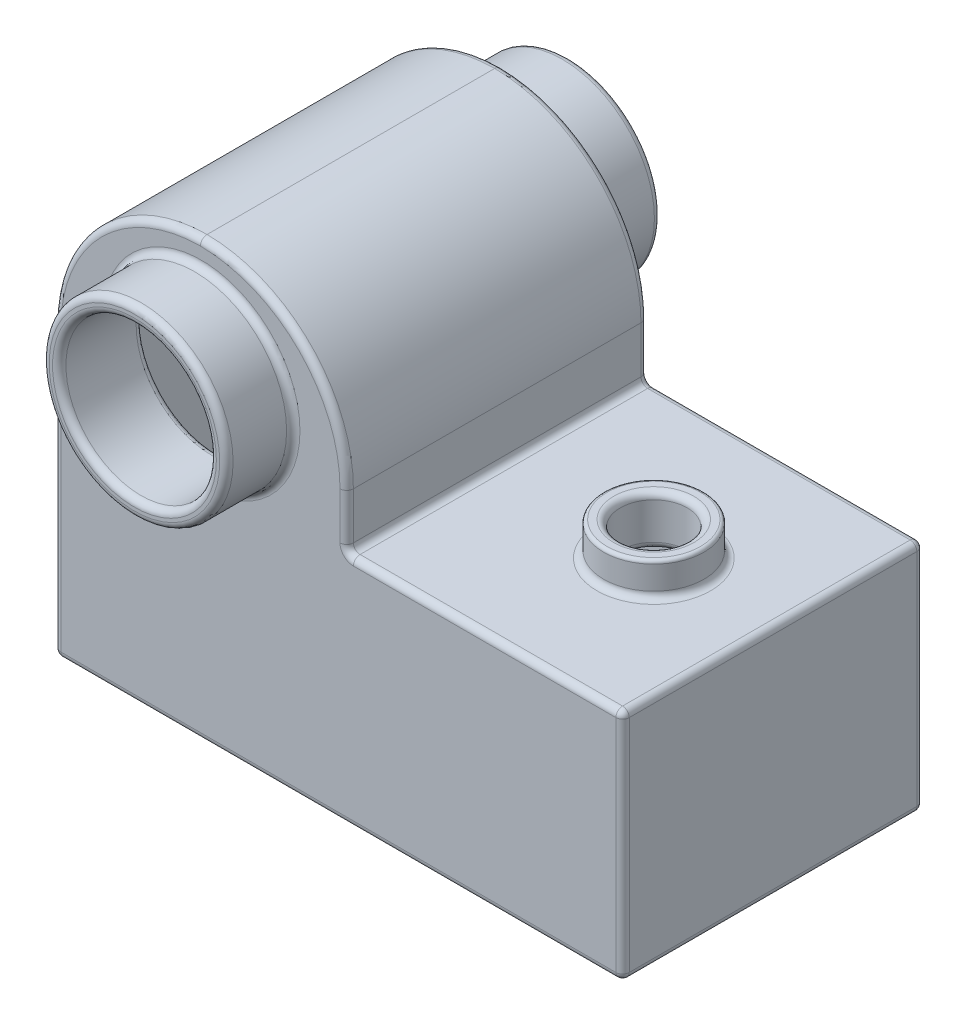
ISO-10303-21;
HEADER;
FILE_DESCRIPTION(('STEP AP214'),'2;1');
FILE_NAME('part.step','',(''),(''),'','','');
FILE_SCHEMA(('AUTOMOTIVE_DESIGN { 1 0 10303 214 1 1 1 1 }'));
ENDSEC;
DATA;
#1=APPLICATION_CONTEXT('core data for automotive mechanical design processes');
#2=APPLICATION_PROTOCOL_DEFINITION('international standard','automotive_design',2000,#1);
#3=PRODUCT_CONTEXT('',#1,'mechanical');
#4=PRODUCT('Part','Part','',(#3));
#5=PRODUCT_RELATED_PRODUCT_CATEGORY('part','',(#4));
#6=PRODUCT_DEFINITION_FORMATION('','',#4);
#7=PRODUCT_DEFINITION_CONTEXT('part definition',#1,'design');
#8=PRODUCT_DEFINITION('design','',#6,#7);
#9=PRODUCT_DEFINITION_SHAPE('','',#8);
#10=(LENGTH_UNIT() NAMED_UNIT(*) SI_UNIT(.MILLI.,.METRE.));
#11=(NAMED_UNIT(*) PLANE_ANGLE_UNIT() SI_UNIT($,.RADIAN.));
#12=(NAMED_UNIT(*) SI_UNIT($,.STERADIAN.) SOLID_ANGLE_UNIT());
#13=UNCERTAINTY_MEASURE_WITH_UNIT(LENGTH_MEASURE(1.E-05),#10,'distance_accuracy_value','');
#14=(GEOMETRIC_REPRESENTATION_CONTEXT(3) GLOBAL_UNCERTAINTY_ASSIGNED_CONTEXT((#13)) GLOBAL_UNIT_ASSIGNED_CONTEXT((#10,
#11,#12)) REPRESENTATION_CONTEXT('',''));
#15=CARTESIAN_POINT('',(0.,0.,0.));
#16=DIRECTION('',(0.,0.,1.));
#17=DIRECTION('',(1.,0.,0.));
#18=AXIS2_PLACEMENT_3D('',#15,#16,#17);
#19=CARTESIAN_POINT('',(-3.17500000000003,76.2,-50.8));
#20=DIRECTION('',(1.,0.,0.));
#21=DIRECTION('',(0.,0.,-1.));
#22=AXIS2_PLACEMENT_3D('',#19,#20,#21);
#23=PLANE('',#22);
#24=DIRECTION('',(0.,0.,-1.));
#25=VECTOR('',#24,1.);
#26=CARTESIAN_POINT('',(-3.17500000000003,15.24,-50.8));
#27=LINE('',#26,#25);
#28=CARTESIAN_POINT('',(-3.17500000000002,15.24,-48.26));
#29=VERTEX_POINT('',#28);
#30=CARTESIAN_POINT('',(-3.17499999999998,15.24,48.26));
#31=VERTEX_POINT('',#30);
#32=EDGE_CURVE('E511',#29,#31,#27,.F.);
#33=ORIENTED_EDGE('',*,*,#32,.T.);
#34=DIRECTION('',(0.,-1.,0.));
#35=VECTOR('',#34,1.);
#36=CARTESIAN_POINT('',(-3.17499999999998,76.2,48.26));
#37=LINE('',#36,#35);
#38=CARTESIAN_POINT('',(-3.17499999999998,96.52,48.26));
#39=VERTEX_POINT('',#38);
#40=EDGE_CURVE('E1305',#31,#39,#37,.F.);
#41=ORIENTED_EDGE('',*,*,#40,.T.);
#42=DIRECTION('',(0.,0.,-1.));
#43=VECTOR('',#42,1.);
#44=CARTESIAN_POINT('',(-3.17500000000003,96.52,-50.8));
#45=LINE('',#44,#43);
#46=CARTESIAN_POINT('',(-3.17500000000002,96.52,-48.26));
#47=VERTEX_POINT('',#46);
#48=EDGE_CURVE('E1739',#39,#47,#45,.T.);
#49=ORIENTED_EDGE('',*,*,#48,.T.);
#50=DIRECTION('',(0.,-1.,0.));
#51=VECTOR('',#50,1.);
#52=CARTESIAN_POINT('',(-3.17500000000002,76.2,-48.26));
#53=LINE('',#52,#51);
#54=EDGE_CURVE('E1300',#47,#29,#53,.T.);
#55=ORIENTED_EDGE('',*,*,#54,.T.);
#56=EDGE_LOOP('',(#33,#41,#49,#55));
#57=FACE_BOUND('',#56,.T.);
#58=CARTESIAN_POINT('',(-3.175,72.39,0.634999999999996));
#59=DIRECTION('',(1.,0.,0.));
#60=DIRECTION('',(0.,0.,-1.));
#61=AXIS2_PLACEMENT_3D('',#58,#59,#60);
#62=CIRCLE('',#61,5.08);
#63=CARTESIAN_POINT('',(-3.175,67.31,0.634999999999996));
#64=VERTEX_POINT('',#63);
#65=CARTESIAN_POINT('',(-3.175,72.39,5.715));
#66=VERTEX_POINT('',#65);
#67=EDGE_CURVE('E976',#64,#66,#62,.F.);
#68=ORIENTED_EDGE('',*,*,#67,.F.);
#69=DIRECTION('',(0.,0.,-1.));
#70=VECTOR('',#69,1.);
#71=CARTESIAN_POINT('',(-3.175,67.31,-3.175));
#72=LINE('',#71,#70);
#73=CARTESIAN_POINT('',(-3.175,67.31,-0.634999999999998));
#74=VERTEX_POINT('',#73);
#75=EDGE_CURVE('E972',#64,#74,#72,.T.);
#76=ORIENTED_EDGE('',*,*,#75,.T.);
#77=CARTESIAN_POINT('',(-3.175,72.39,-0.634999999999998));
#78=DIRECTION('',(1.,0.,0.));
#79=DIRECTION('',(0.,0.,-1.));
#80=AXIS2_PLACEMENT_3D('',#77,#78,#79);
#81=CIRCLE('',#80,5.08);
#82=CARTESIAN_POINT('',(-3.17500000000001,72.39,-5.715));
#83=VERTEX_POINT('',#82);
#84=EDGE_CURVE('E1326',#83,#74,#81,.F.);
#85=ORIENTED_EDGE('',*,*,#84,.F.);
#86=DIRECTION('',(0.,1.,0.));
#87=VECTOR('',#86,1.);
#88=CARTESIAN_POINT('',(-3.17500000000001,76.2,-5.715));
#89=LINE('',#88,#87);
#90=CARTESIAN_POINT('',(-3.17500000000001,73.66,-5.715));
#91=VERTEX_POINT('',#90);
#92=EDGE_CURVE('E1319',#83,#91,#89,.T.);
#93=ORIENTED_EDGE('',*,*,#92,.T.);
#94=CARTESIAN_POINT('',(-3.175,73.66,-0.634999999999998));
#95=DIRECTION('',(1.,0.,0.));
#96=DIRECTION('',(0.,0.,-1.));
#97=AXIS2_PLACEMENT_3D('',#94,#95,#96);
#98=CIRCLE('',#97,5.08);
#99=CARTESIAN_POINT('',(-3.175,78.74,-0.634999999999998));
#100=VERTEX_POINT('',#99);
#101=EDGE_CURVE('E1315',#100,#91,#98,.F.);
#102=ORIENTED_EDGE('',*,*,#101,.F.);
#103=DIRECTION('',(0.,0.,-1.));
#104=VECTOR('',#103,1.);
#105=CARTESIAN_POINT('',(-3.17500000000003,78.74,-50.8));
#106=LINE('',#105,#104);
#107=CARTESIAN_POINT('',(-3.175,78.74,0.634999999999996));
#108=VERTEX_POINT('',#107);
#109=EDGE_CURVE('E1312',#100,#108,#106,.F.);
#110=ORIENTED_EDGE('',*,*,#109,.T.);
#111=CARTESIAN_POINT('',(-3.175,73.66,0.634999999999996));
#112=DIRECTION('',(1.,0.,0.));
#113=DIRECTION('',(0.,0.,-1.));
#114=AXIS2_PLACEMENT_3D('',#111,#112,#113);
#115=CIRCLE('',#114,5.08);
#116=CARTESIAN_POINT('',(-3.175,73.66,5.715));
#117=VERTEX_POINT('',#116);
#118=EDGE_CURVE('E1308',#117,#108,#115,.F.);
#119=ORIENTED_EDGE('',*,*,#118,.F.);
#120=DIRECTION('',(0.,1.,0.));
#121=VECTOR('',#120,1.);
#122=CARTESIAN_POINT('',(-3.175,76.2,5.715));
#123=LINE('',#122,#121);
#124=EDGE_CURVE('E1322',#117,#66,#123,.F.);
#125=ORIENTED_EDGE('',*,*,#124,.T.);
#126=EDGE_LOOP('',(#68,#76,#85,#93,#102,#110,#119,#125));
#127=FACE_BOUND('',#126,.T.);
#128=ADVANCED_FACE('F49',(#57,#127),#23,.F.);
#129=CARTESIAN_POINT('',(107.95,76.2,57.15));
#130=DIRECTION('',(0.,0.,-1.));
#131=DIRECTION('',(-1.,0.,0.));
#132=AXIS2_PLACEMENT_3D('',#129,#130,#131);
#133=PLANE('',#132);
#134=CARTESIAN_POINT('',(-52.034333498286,114.3,57.15));
#135=DIRECTION('',(0.,0.,-1.));
#136=DIRECTION('',(-1.,0.,0.));
#137=AXIS2_PLACEMENT_3D('',#134,#135,#136);
#138=CIRCLE('',#137,37.465);
#139=CARTESIAN_POINT('',(-89.499333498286,114.3,57.15));
#140=VERTEX_POINT('',#139);
#141=EDGE_CURVE('E1130',#140,#140,#138,.T.);
#142=ORIENTED_EDGE('',*,*,#141,.T.);
#143=EDGE_LOOP('',(#142));
#144=FACE_BOUND('',#143,.T.);
#145=DIRECTION('',(0.,-1.,0.));
#146=VECTOR('',#145,1.);
#147=CARTESIAN_POINT('',(0.635000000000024,76.2,57.15));
#148=LINE('',#147,#146);
#149=CARTESIAN_POINT('',(0.635000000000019,85.09,57.15));
#150=VERTEX_POINT('',#149);
#151=CARTESIAN_POINT('',(0.635000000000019,102.87,57.15));
#152=VERTEX_POINT('',#151);
#153=EDGE_CURVE('E1124',#150,#152,#148,.F.);
#154=ORIENTED_EDGE('',*,*,#153,.T.);
#155=CARTESIAN_POINT('',(-52.705,102.87,57.15));
#156=DIRECTION('',(0.,0.,-1.));
#157=DIRECTION('',(-1.,0.,0.));
#158=AXIS2_PLACEMENT_3D('',#155,#156,#157);
#159=CIRCLE('',#158,53.34);
#160=CARTESIAN_POINT('',(-52.3875,156.209055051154,57.15));
#161=VERTEX_POINT('',#160);
#162=EDGE_CURVE('E1127',#152,#161,#159,.F.);
#163=ORIENTED_EDGE('',*,*,#162,.T.);
#164=CARTESIAN_POINT('',(-52.07,102.87,57.15));
#165=DIRECTION('',(0.,0.,-1.));
#166=DIRECTION('',(-1.,0.,0.));
#167=AXIS2_PLACEMENT_3D('',#164,#165,#166);
#168=CIRCLE('',#167,53.34);
#169=CARTESIAN_POINT('',(-105.41,102.87,57.15));
#170=VERTEX_POINT('',#169);
#171=EDGE_CURVE('E1120',#161,#170,#168,.F.);
#172=ORIENTED_EDGE('',*,*,#171,.T.);
#173=DIRECTION('',(0.,-1.,0.));
#174=VECTOR('',#173,1.);
#175=CARTESIAN_POINT('',(-105.41,76.2,57.15));
#176=LINE('',#175,#174);
#177=CARTESIAN_POINT('',(-105.41,-3.81,57.15));
#178=VERTEX_POINT('',#177);
#179=EDGE_CURVE('E1117',#170,#178,#176,.T.);
#180=ORIENTED_EDGE('',*,*,#179,.T.);
#181=DIRECTION('',(-1.,0.,0.));
#182=VECTOR('',#181,1.);
#183=CARTESIAN_POINT('',(107.95,-3.80999999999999,57.15));
#184=LINE('',#183,#182);
#185=CARTESIAN_POINT('',(105.41,-3.81,57.15));
#186=VERTEX_POINT('',#185);
#187=EDGE_CURVE('E1110',#178,#186,#184,.F.);
#188=ORIENTED_EDGE('',*,*,#187,.T.);
#189=DIRECTION('',(0.,-1.,0.));
#190=VECTOR('',#189,1.);
#191=CARTESIAN_POINT('',(105.41,76.2,57.15));
#192=LINE('',#191,#190);
#193=CARTESIAN_POINT('',(105.41,80.01,57.15));
#194=VERTEX_POINT('',#193);
#195=EDGE_CURVE('E1104',#186,#194,#192,.F.);
#196=ORIENTED_EDGE('',*,*,#195,.T.);
#197=DIRECTION('',(1.,0.,0.));
#198=VECTOR('',#197,1.);
#199=CARTESIAN_POINT('',(3.17500000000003,80.01,57.15));
#200=LINE('',#199,#198);
#201=CARTESIAN_POINT('',(5.71500000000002,80.01,57.15));
#202=VERTEX_POINT('',#201);
#203=EDGE_CURVE('E1107',#194,#202,#200,.F.);
#204=ORIENTED_EDGE('',*,*,#203,.T.);
#205=CARTESIAN_POINT('',(5.71500000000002,85.09,57.15));
#206=DIRECTION('',(0.,0.,-1.));
#207=DIRECTION('',(-1.,0.,0.));
#208=AXIS2_PLACEMENT_3D('',#205,#206,#207);
#209=CIRCLE('',#208,5.08);
#210=EDGE_CURVE('E1113',#150,#202,#209,.F.);
#211=ORIENTED_EDGE('',*,*,#210,.F.);
#212=EDGE_LOOP('',(#154,#163,#172,#180,#188,#196,#204,#211));
#213=FACE_BOUND('',#212,.T.);
#214=ADVANCED_FACE('F1911',(#144,#213),#133,.F.);
#215=CARTESIAN_POINT('',(0.,82.55,0.));
#216=DIRECTION('',(0.,1.,0.));
#217=DIRECTION('',(0.,0.,1.));
#218=AXIS2_PLACEMENT_3D('',#215,#216,#217);
#219=PLANE('',#218);
#220=CARTESIAN_POINT('',(62.6610635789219,82.55,0.));
#221=DIRECTION('',(0.,1.,0.));
#222=DIRECTION('',(0.,0.,1.));
#223=AXIS2_PLACEMENT_3D('',#220,#221,#222);
#224=CIRCLE('',#223,21.59);
#225=CARTESIAN_POINT('',(62.6610635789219,82.55,21.59));
#226=VERTEX_POINT('',#225);
#227=EDGE_CURVE('E1530',#226,#226,#224,.F.);
#228=ORIENTED_EDGE('',*,*,#227,.T.);
#229=EDGE_LOOP('',(#228));
#230=FACE_BOUND('',#229,.T.);
#231=DIRECTION('',(0.,0.,1.));
#232=VECTOR('',#231,1.);
#233=CARTESIAN_POINT('',(5.71500000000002,82.55,0.));
#234=LINE('',#233,#232);
#235=CARTESIAN_POINT('',(5.71500000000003,82.55,-54.61));
#236=VERTEX_POINT('',#235);
#237=CARTESIAN_POINT('',(5.71500000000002,82.55,54.61));
#238=VERTEX_POINT('',#237);
#239=EDGE_CURVE('E1523',#236,#238,#234,.T.);
#240=ORIENTED_EDGE('',*,*,#239,.T.);
#241=DIRECTION('',(1.,0.,0.));
#242=VECTOR('',#241,1.);
#243=CARTESIAN_POINT('',(107.95,82.55,54.61));
#244=LINE('',#243,#242);
#245=CARTESIAN_POINT('',(105.41,82.55,54.61));
#246=VERTEX_POINT('',#245);
#247=EDGE_CURVE('E1526',#238,#246,#244,.T.);
#248=ORIENTED_EDGE('',*,*,#247,.T.);
#249=DIRECTION('',(0.,0.,-1.));
#250=VECTOR('',#249,1.);
#251=CARTESIAN_POINT('',(105.41,82.55,-57.15));
#252=LINE('',#251,#250);
#253=CARTESIAN_POINT('',(105.41,82.55,-54.61));
#254=VERTEX_POINT('',#253);
#255=EDGE_CURVE('E1517',#246,#254,#252,.T.);
#256=ORIENTED_EDGE('',*,*,#255,.T.);
#257=DIRECTION('',(-1.,0.,0.));
#258=VECTOR('',#257,1.);
#259=CARTESIAN_POINT('',(3.17500000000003,82.55,-54.61));
#260=LINE('',#259,#258);
#261=EDGE_CURVE('E1520',#254,#236,#260,.T.);
#262=ORIENTED_EDGE('',*,*,#261,.T.);
#263=EDGE_LOOP('',(#240,#248,#256,#262));
#264=FACE_BOUND('',#263,.T.);
#265=ADVANCED_FACE('F1646',(#230,#264),#219,.T.);
#266=CARTESIAN_POINT('',(3.17500000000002,76.2,50.8));
#267=DIRECTION('',(-1.,0.,0.));
#268=DIRECTION('',(0.,0.,1.));
#269=AXIS2_PLACEMENT_3D('',#266,#267,#268);
#270=PLANE('',#269);
#271=DIRECTION('',(0.,-1.,0.));
#272=VECTOR('',#271,1.);
#273=CARTESIAN_POINT('',(3.17500000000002,76.2,48.26));
#274=LINE('',#273,#272);
#275=CARTESIAN_POINT('',(3.17500000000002,73.66,48.26));
#276=VERTEX_POINT('',#275);
#277=CARTESIAN_POINT('',(3.17500000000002,15.24,48.26));
#278=VERTEX_POINT('',#277);
#279=EDGE_CURVE('E1074',#276,#278,#274,.T.);
#280=ORIENTED_EDGE('',*,*,#279,.T.);
#281=DIRECTION('',(0.,0.,-1.));
#282=VECTOR('',#281,1.);
#283=CARTESIAN_POINT('',(3.17500000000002,15.24,50.8));
#284=LINE('',#283,#282);
#285=CARTESIAN_POINT('',(3.17500000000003,15.24,-48.26));
#286=VERTEX_POINT('',#285);
#287=EDGE_CURVE('E1283',#278,#286,#284,.T.);
#288=ORIENTED_EDGE('',*,*,#287,.T.);
#289=DIRECTION('',(0.,-1.,0.));
#290=VECTOR('',#289,1.);
#291=CARTESIAN_POINT('',(3.17500000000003,76.2,-48.26));
#292=LINE('',#291,#290);
#293=CARTESIAN_POINT('',(3.17500000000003,73.66,-48.26));
#294=VERTEX_POINT('',#293);
#295=EDGE_CURVE('E1275',#286,#294,#292,.F.);
#296=ORIENTED_EDGE('',*,*,#295,.T.);
#297=DIRECTION('',(0.,0.,-1.));
#298=VECTOR('',#297,1.);
#299=CARTESIAN_POINT('',(3.17500000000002,73.66,50.8));
#300=LINE('',#299,#298);
#301=EDGE_CURVE('E1278',#294,#276,#300,.F.);
#302=ORIENTED_EDGE('',*,*,#301,.T.);
#303=EDGE_LOOP('',(#280,#288,#296,#302));
#304=FACE_BOUND('',#303,.T.);
#305=ADVANCED_FACE('F1807',(#304),#270,.F.);
#306=CARTESIAN_POINT('',(0.,76.2,0.));
#307=DIRECTION('',(0.,1.,0.));
#308=DIRECTION('',(0.,0.,1.));
#309=AXIS2_PLACEMENT_3D('',#306,#307,#308);
#310=PLANE('',#309);
#311=DIRECTION('',(-1.,0.,0.));
#312=VECTOR('',#311,1.);
#313=CARTESIAN_POINT('',(0.,76.2,-0.634999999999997));
#314=LINE('',#313,#312);
#315=CARTESIAN_POINT('',(-5.715,76.2,-0.634999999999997));
#316=VERTEX_POINT('',#315);
#317=CARTESIAN_POINT('',(-40.7374056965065,76.2,-0.635));
#318=VERTEX_POINT('',#317);
#319=EDGE_CURVE('E1419',#316,#318,#314,.T.);
#320=ORIENTED_EDGE('',*,*,#319,.T.);
#321=CARTESIAN_POINT('',(-50.7934691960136,76.2,0.814547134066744));
#322=DIRECTION('',(0.,1.,0.));
#323=DIRECTION('',(0.,0.,1.));
#324=AXIS2_PLACEMENT_3D('',#321,#322,#323);
#325=CIRCLE('',#324,10.16);
#326=CARTESIAN_POINT('',(-60.8495326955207,76.2,-0.635));
#327=VERTEX_POINT('',#326);
#328=EDGE_CURVE('E1422',#318,#327,#325,.T.);
#329=ORIENTED_EDGE('',*,*,#328,.T.);
#330=DIRECTION('',(-1.,0.,0.));
#331=VECTOR('',#330,1.);
#332=CARTESIAN_POINT('',(0.,76.2,-0.635000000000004));
#333=LINE('',#332,#331);
#334=CARTESIAN_POINT('',(-99.06,76.2,-0.634999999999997));
#335=VERTEX_POINT('',#334);
#336=EDGE_CURVE('E1401',#327,#335,#333,.T.);
#337=ORIENTED_EDGE('',*,*,#336,.T.);
#338=DIRECTION('',(0.,0.,1.));
#339=VECTOR('',#338,1.);
#340=CARTESIAN_POINT('',(-99.06,76.2,3.175));
#341=LINE('',#340,#339);
#342=CARTESIAN_POINT('',(-99.06,76.2,0.634999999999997));
#343=VERTEX_POINT('',#342);
#344=EDGE_CURVE('E1404',#335,#343,#341,.T.);
#345=ORIENTED_EDGE('',*,*,#344,.T.);
#346=DIRECTION('',(1.,0.,0.));
#347=VECTOR('',#346,1.);
#348=CARTESIAN_POINT('',(0.,76.2,0.635000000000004));
#349=LINE('',#348,#347);
#350=CARTESIAN_POINT('',(-60.9518825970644,76.2,0.635));
#351=VERTEX_POINT('',#350);
#352=EDGE_CURVE('E1407',#343,#351,#349,.T.);
#353=ORIENTED_EDGE('',*,*,#352,.T.);
#354=CARTESIAN_POINT('',(-50.7934691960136,76.2,0.814547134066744));
#355=DIRECTION('',(0.,1.,0.));
#356=DIRECTION('',(0.,0.,1.));
#357=AXIS2_PLACEMENT_3D('',#354,#355,#356);
#358=CIRCLE('',#357,10.16);
#359=CARTESIAN_POINT('',(-40.6350557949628,76.2,0.635));
#360=VERTEX_POINT('',#359);
#361=EDGE_CURVE('E1410',#351,#360,#358,.T.);
#362=ORIENTED_EDGE('',*,*,#361,.T.);
#363=DIRECTION('',(1.,0.,0.));
#364=VECTOR('',#363,1.);
#365=CARTESIAN_POINT('',(0.,76.2,0.634999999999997));
#366=LINE('',#365,#364);
#367=CARTESIAN_POINT('',(-5.715,76.2,0.634999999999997));
#368=VERTEX_POINT('',#367);
#369=EDGE_CURVE('E1413',#360,#368,#366,.T.);
#370=ORIENTED_EDGE('',*,*,#369,.T.);
#371=DIRECTION('',(0.,0.,-1.));
#372=VECTOR('',#371,1.);
#373=CARTESIAN_POINT('',(-5.715,76.2,0.));
#374=LINE('',#373,#372);
#375=EDGE_CURVE('E1416',#368,#316,#374,.T.);
#376=ORIENTED_EDGE('',*,*,#375,.T.);
#377=EDGE_LOOP('',(#320,#329,#337,#345,#353,#362,#370,#376));
#378=FACE_BOUND('',#377,.T.);
#379=CARTESIAN_POINT('',(-50.7934691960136,76.2,0.814547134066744));
#380=DIRECTION('',(0.,1.,0.));
#381=DIRECTION('',(0.,0.,1.));
#382=AXIS2_PLACEMENT_3D('',#379,#380,#381);
#383=CIRCLE('',#382,8.89);
#384=CARTESIAN_POINT('',(-50.7934691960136,76.2,9.70454713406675));
#385=VERTEX_POINT('',#384);
#386=EDGE_CURVE('E1397',#385,#385,#383,.F.);
#387=ORIENTED_EDGE('',*,*,#386,.T.);
#388=EDGE_LOOP('',(#387));
#389=FACE_BOUND('',#388,.T.);
#390=ADVANCED_FACE('F1953',(#378,#389),#310,.T.);
#391=CARTESIAN_POINT('',(-101.6,76.2,-50.8));
#392=DIRECTION('',(0.,0.,1.));
#393=DIRECTION('',(1.,0.,0.));
#394=AXIS2_PLACEMENT_3D('',#391,#392,#393);
#395=PLANE('',#394);
#396=CARTESIAN_POINT('',(0.635000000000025,15.24,-50.8));
#397=DIRECTION('',(0.,0.,1.));
#398=DIRECTION('',(1.,0.,0.));
#399=AXIS2_PLACEMENT_3D('',#396,#397,#398);
#400=CIRCLE('',#399,5.08);
#401=CARTESIAN_POINT('',(0.635000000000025,10.16,-50.8));
#402=VERTEX_POINT('',#401);
#403=CARTESIAN_POINT('',(5.71500000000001,15.24,-50.8));
#404=VERTEX_POINT('',#403);
#405=EDGE_CURVE('E1459',#402,#404,#400,.T.);
#406=ORIENTED_EDGE('',*,*,#405,.F.);
#407=DIRECTION('',(-1.,0.,0.));
#408=VECTOR('',#407,1.);
#409=CARTESIAN_POINT('',(-101.6,10.16,-50.8));
#410=LINE('',#409,#408);
#411=CARTESIAN_POINT('',(-0.635000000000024,10.16,-50.8));
#412=VERTEX_POINT('',#411);
#413=EDGE_CURVE('E1465',#402,#412,#410,.T.);
#414=ORIENTED_EDGE('',*,*,#413,.T.);
#415=CARTESIAN_POINT('',(-0.635000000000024,15.24,-50.8));
#416=DIRECTION('',(0.,0.,1.));
#417=DIRECTION('',(1.,0.,0.));
#418=AXIS2_PLACEMENT_3D('',#415,#416,#417);
#419=CIRCLE('',#418,5.08);
#420=CARTESIAN_POINT('',(-5.71500000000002,15.24,-50.8));
#421=VERTEX_POINT('',#420);
#422=EDGE_CURVE('E506',#421,#412,#419,.T.);
#423=ORIENTED_EDGE('',*,*,#422,.F.);
#424=DIRECTION('',(0.,-1.,0.));
#425=VECTOR('',#424,1.);
#426=CARTESIAN_POINT('',(-5.71500000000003,76.2,-50.8));
#427=LINE('',#426,#425);
#428=CARTESIAN_POINT('',(-5.71500000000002,96.52,-50.8));
#429=VERTEX_POINT('',#428);
#430=EDGE_CURVE('E1455',#421,#429,#427,.F.);
#431=ORIENTED_EDGE('',*,*,#430,.T.);
#432=CARTESIAN_POINT('',(-59.055,96.52,-50.8));
#433=DIRECTION('',(0.,0.,1.));
#434=DIRECTION('',(1.,0.,0.));
#435=AXIS2_PLACEMENT_3D('',#432,#433,#434);
#436=CIRCLE('',#435,53.34);
#437=CARTESIAN_POINT('',(-52.3875,149.441640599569,-50.8));
#438=VERTEX_POINT('',#437);
#439=EDGE_CURVE('E1434',#429,#438,#436,.T.);
#440=ORIENTED_EDGE('',*,*,#439,.T.);
#441=CARTESIAN_POINT('',(-45.72,96.52,-50.8));
#442=DIRECTION('',(0.,0.,1.));
#443=DIRECTION('',(1.,0.,0.));
#444=AXIS2_PLACEMENT_3D('',#441,#442,#443);
#445=CIRCLE('',#444,53.34);
#446=CARTESIAN_POINT('',(-99.06,96.52,-50.8));
#447=VERTEX_POINT('',#446);
#448=EDGE_CURVE('E1437',#438,#447,#445,.T.);
#449=ORIENTED_EDGE('',*,*,#448,.T.);
#450=DIRECTION('',(0.,-1.,0.));
#451=VECTOR('',#450,1.);
#452=CARTESIAN_POINT('',(-99.06,0.,-50.8));
#453=LINE('',#452,#451);
#454=CARTESIAN_POINT('',(-99.06,2.54,-50.8));
#455=VERTEX_POINT('',#454);
#456=EDGE_CURVE('E1440',#447,#455,#453,.T.);
#457=ORIENTED_EDGE('',*,*,#456,.T.);
#458=DIRECTION('',(-1.,0.,0.));
#459=VECTOR('',#458,1.);
#460=CARTESIAN_POINT('',(101.6,2.54,-50.8));
#461=LINE('',#460,#459);
#462=CARTESIAN_POINT('',(99.06,2.54,-50.8));
#463=VERTEX_POINT('',#462);
#464=EDGE_CURVE('E1443',#455,#463,#461,.F.);
#465=ORIENTED_EDGE('',*,*,#464,.T.);
#466=DIRECTION('',(0.,-1.,0.));
#467=VECTOR('',#466,1.);
#468=CARTESIAN_POINT('',(99.06,76.2,-50.8));
#469=LINE('',#468,#467);
#470=CARTESIAN_POINT('',(99.06,73.66,-50.8));
#471=VERTEX_POINT('',#470);
#472=EDGE_CURVE('E1446',#463,#471,#469,.F.);
#473=ORIENTED_EDGE('',*,*,#472,.T.);
#474=DIRECTION('',(-1.,0.,0.));
#475=VECTOR('',#474,1.);
#476=CARTESIAN_POINT('',(-101.6,73.66,-50.8));
#477=LINE('',#476,#475);
#478=CARTESIAN_POINT('',(5.71500000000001,73.66,-50.8));
#479=VERTEX_POINT('',#478);
#480=EDGE_CURVE('E1449',#471,#479,#477,.T.);
#481=ORIENTED_EDGE('',*,*,#480,.T.);
#482=DIRECTION('',(0.,-1.,0.));
#483=VECTOR('',#482,1.);
#484=CARTESIAN_POINT('',(5.71500000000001,76.2,-50.8));
#485=LINE('',#484,#483);
#486=EDGE_CURVE('E1452',#479,#404,#485,.T.);
#487=ORIENTED_EDGE('',*,*,#486,.T.);
#488=EDGE_LOOP('',(#406,#414,#423,#431,#440,#449,#457,#465,#473,#481,#487));
#489=FACE_BOUND('',#488,.T.);
#490=CARTESIAN_POINT('',(-52.034333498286,114.3,-50.8));
#491=DIRECTION('',(0.,0.,1.));
#492=DIRECTION('',(1.,0.,0.));
#493=AXIS2_PLACEMENT_3D('',#490,#491,#492);
#494=CIRCLE('',#493,31.115);
#495=CARTESIAN_POINT('',(-20.919333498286,114.3,-50.8));
#496=VERTEX_POINT('',#495);
#497=EDGE_CURVE('E1430',#496,#496,#494,.F.);
#498=ORIENTED_EDGE('',*,*,#497,.T.);
#499=EDGE_LOOP('',(#498));
#500=FACE_BOUND('',#499,.T.);
#501=ADVANCED_FACE('F1946',(#489,#500),#395,.T.);
#502=CARTESIAN_POINT('',(-101.6,76.2,50.8));
#503=DIRECTION('',(0.,0.,-1.));
#504=DIRECTION('',(-1.,0.,0.));
#505=AXIS2_PLACEMENT_3D('',#502,#503,#504);
#506=PLANE('',#505);
#507=CARTESIAN_POINT('',(-52.034333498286,114.3,50.8));
#508=DIRECTION('',(0.,0.,-1.));
#509=DIRECTION('',(-1.,0.,0.));
#510=AXIS2_PLACEMENT_3D('',#507,#508,#509);
#511=CIRCLE('',#510,31.115);
#512=CARTESIAN_POINT('',(-83.149333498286,114.3,50.8));
#513=VERTEX_POINT('',#512);
#514=EDGE_CURVE('E1081',#513,#513,#511,.F.);
#515=ORIENTED_EDGE('',*,*,#514,.T.);
#516=EDGE_LOOP('',(#515));
#517=FACE_BOUND('',#516,.T.);
#518=CARTESIAN_POINT('',(0.635000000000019,15.24,50.8));
#519=DIRECTION('',(0.,0.,-1.));
#520=DIRECTION('',(-1.,0.,0.));
#521=AXIS2_PLACEMENT_3D('',#518,#519,#520);
#522=CIRCLE('',#521,5.08);
#523=CARTESIAN_POINT('',(5.71500000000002,15.24,50.8));
#524=VERTEX_POINT('',#523);
#525=CARTESIAN_POINT('',(0.635000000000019,10.16,50.8));
#526=VERTEX_POINT('',#525);
#527=EDGE_CURVE('E1067',#524,#526,#522,.T.);
#528=ORIENTED_EDGE('',*,*,#527,.F.);
#529=DIRECTION('',(0.,-1.,0.));
#530=VECTOR('',#529,1.);
#531=CARTESIAN_POINT('',(5.71500000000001,76.2,50.8));
#532=LINE('',#531,#530);
#533=CARTESIAN_POINT('',(5.71500000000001,76.2,50.8));
#534=VERTEX_POINT('',#533);
#535=EDGE_CURVE('E1075',#524,#534,#532,.F.);
#536=ORIENTED_EDGE('',*,*,#535,.T.);
#537=DIRECTION('',(1.,0.,0.));
#538=VECTOR('',#537,1.);
#539=CARTESIAN_POINT('',(-101.6,76.2,50.8));
#540=LINE('',#539,#538);
#541=CARTESIAN_POINT('',(99.06,76.2,50.8));
#542=VERTEX_POINT('',#541);
#543=EDGE_CURVE('E1768',#534,#542,#540,.T.);
#544=ORIENTED_EDGE('',*,*,#543,.T.);
#545=DIRECTION('',(0.,-1.,0.));
#546=VECTOR('',#545,1.);
#547=CARTESIAN_POINT('',(99.06,0.,50.8));
#548=LINE('',#547,#546);
#549=CARTESIAN_POINT('',(99.06,2.54,50.8));
#550=VERTEX_POINT('',#549);
#551=EDGE_CURVE('E1706',#542,#550,#548,.T.);
#552=ORIENTED_EDGE('',*,*,#551,.T.);
#553=DIRECTION('',(1.,0.,0.));
#554=VECTOR('',#553,1.);
#555=CARTESIAN_POINT('',(-101.6,2.54,50.8));
#556=LINE('',#555,#554);
#557=CARTESIAN_POINT('',(-99.06,2.54,50.8));
#558=VERTEX_POINT('',#557);
#559=EDGE_CURVE('E1703',#550,#558,#556,.F.);
#560=ORIENTED_EDGE('',*,*,#559,.T.);
#561=DIRECTION('',(0.,-1.,0.));
#562=VECTOR('',#561,1.);
#563=CARTESIAN_POINT('',(-99.06,96.52,50.8));
#564=LINE('',#563,#562);
#565=CARTESIAN_POINT('',(-99.06,96.52,50.8));
#566=VERTEX_POINT('',#565);
#567=EDGE_CURVE('E1700',#558,#566,#564,.F.);
#568=ORIENTED_EDGE('',*,*,#567,.T.);
#569=CARTESIAN_POINT('',(-45.72,96.52,50.8));
#570=DIRECTION('',(0.,0.,-1.));
#571=DIRECTION('',(-1.,0.,0.));
#572=AXIS2_PLACEMENT_3D('',#569,#570,#571);
#573=CIRCLE('',#572,53.34);
#574=CARTESIAN_POINT('',(-52.3875,149.441640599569,50.8));
#575=VERTEX_POINT('',#574);
#576=EDGE_CURVE('E1709',#566,#575,#573,.T.);
#577=ORIENTED_EDGE('',*,*,#576,.T.);
#578=CARTESIAN_POINT('',(-59.055,96.52,50.8));
#579=DIRECTION('',(0.,0.,-1.));
#580=DIRECTION('',(-1.,0.,0.));
#581=AXIS2_PLACEMENT_3D('',#578,#579,#580);
#582=CIRCLE('',#581,53.34);
#583=CARTESIAN_POINT('',(-5.71499999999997,96.52,50.8));
#584=VERTEX_POINT('',#583);
#585=EDGE_CURVE('E1712',#575,#584,#582,.T.);
#586=ORIENTED_EDGE('',*,*,#585,.T.);
#587=DIRECTION('',(0.,-1.,0.));
#588=VECTOR('',#587,1.);
#589=CARTESIAN_POINT('',(-5.71499999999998,76.2,50.8));
#590=LINE('',#589,#588);
#591=CARTESIAN_POINT('',(-5.71499999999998,15.24,50.8));
#592=VERTEX_POINT('',#591);
#593=EDGE_CURVE('E1715',#584,#592,#590,.T.);
#594=ORIENTED_EDGE('',*,*,#593,.T.);
#595=CARTESIAN_POINT('',(-0.634999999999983,15.24,50.8));
#596=DIRECTION('',(0.,0.,-1.));
#597=DIRECTION('',(-1.,0.,0.));
#598=AXIS2_PLACEMENT_3D('',#595,#596,#597);
#599=CIRCLE('',#598,5.08);
#600=CARTESIAN_POINT('',(-0.634999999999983,10.16,50.8));
#601=VERTEX_POINT('',#600);
#602=EDGE_CURVE('E1718',#601,#592,#599,.T.);
#603=ORIENTED_EDGE('',*,*,#602,.F.);
#604=DIRECTION('',(-1.,0.,0.));
#605=VECTOR('',#604,1.);
#606=CARTESIAN_POINT('',(-101.6,10.16,50.8));
#607=LINE('',#606,#605);
#608=EDGE_CURVE('E1088',#601,#526,#607,.F.);
#609=ORIENTED_EDGE('',*,*,#608,.T.);
#610=EDGE_LOOP('',(#528,#536,#544,#552,#560,#568,#577,#586,#594,#603,#609));
#611=FACE_BOUND('',#610,.T.);
#612=ADVANCED_FACE('F1723',(#517,#611),#506,.T.);
#613=CARTESIAN_POINT('',(0.,0.,0.));
#614=DIRECTION('',(0.,1.,0.));
#615=DIRECTION('',(0.,0.,1.));
#616=AXIS2_PLACEMENT_3D('',#613,#614,#615);
#617=PLANE('',#616);
#618=DIRECTION('',(1.,0.,0.));
#619=VECTOR('',#618,1.);
#620=CARTESIAN_POINT('',(101.6,0.,48.26));
#621=LINE('',#620,#619);
#622=CARTESIAN_POINT('',(-99.06,0.,48.26));
#623=VERTEX_POINT('',#622);
#624=CARTESIAN_POINT('',(99.06,0.,48.26));
#625=VERTEX_POINT('',#624);
#626=EDGE_CURVE('E1293',#623,#625,#621,.T.);
#627=ORIENTED_EDGE('',*,*,#626,.T.);
#628=DIRECTION('',(0.,0.,-1.));
#629=VECTOR('',#628,1.);
#630=CARTESIAN_POINT('',(99.06,0.,-50.8));
#631=LINE('',#630,#629);
#632=CARTESIAN_POINT('',(99.06,0.,-48.26));
#633=VERTEX_POINT('',#632);
#634=EDGE_CURVE('E1296',#625,#633,#631,.T.);
#635=ORIENTED_EDGE('',*,*,#634,.T.);
#636=DIRECTION('',(-1.,0.,0.));
#637=VECTOR('',#636,1.);
#638=CARTESIAN_POINT('',(-101.6,0.,-48.26));
#639=LINE('',#638,#637);
#640=CARTESIAN_POINT('',(-99.06,0.,-48.26));
#641=VERTEX_POINT('',#640);
#642=EDGE_CURVE('E1287',#633,#641,#639,.T.);
#643=ORIENTED_EDGE('',*,*,#642,.T.);
#644=DIRECTION('',(0.,0.,1.));
#645=VECTOR('',#644,1.);
#646=CARTESIAN_POINT('',(-99.06,0.,50.8));
#647=LINE('',#646,#645);
#648=EDGE_CURVE('E1290',#641,#623,#647,.T.);
#649=ORIENTED_EDGE('',*,*,#648,.T.);
#650=EDGE_LOOP('',(#627,#635,#643,#649));
#651=FACE_BOUND('',#650,.T.);
#652=ADVANCED_FACE('F1940',(#651),#617,.T.);
#653=CARTESIAN_POINT('',(-107.95,76.2,57.15));
#654=DIRECTION('',(1.,0.,0.));
#655=DIRECTION('',(0.,0.,-1.));
#656=AXIS2_PLACEMENT_3D('',#653,#654,#655);
#657=PLANE('',#656);
#658=CARTESIAN_POINT('',(-107.95,88.9,0.));
#659=DIRECTION('',(1.,0.,0.));
#660=DIRECTION('',(0.,0.,-1.));
#661=AXIS2_PLACEMENT_3D('',#658,#659,#660);
#662=CIRCLE('',#661,6.99777394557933);
#663=CARTESIAN_POINT('',(-107.95,88.9,-6.99777394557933));
#664=VERTEX_POINT('',#663);
#665=EDGE_CURVE('E1509',#664,#664,#662,.T.);
#666=ORIENTED_EDGE('',*,*,#665,.T.);
#667=EDGE_LOOP('',(#666));
#668=FACE_BOUND('',#667,.T.);
#669=DIRECTION('',(0.,0.,-1.));
#670=VECTOR('',#669,1.);
#671=CARTESIAN_POINT('',(-107.95,-3.80999999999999,57.15));
#672=LINE('',#671,#670);
#673=CARTESIAN_POINT('',(-107.95,-3.81,-54.61));
#674=VERTEX_POINT('',#673);
#675=CARTESIAN_POINT('',(-107.95,-3.81,54.61));
#676=VERTEX_POINT('',#675);
#677=EDGE_CURVE('E1503',#674,#676,#672,.F.);
#678=ORIENTED_EDGE('',*,*,#677,.T.);
#679=DIRECTION('',(0.,-1.,0.));
#680=VECTOR('',#679,1.);
#681=CARTESIAN_POINT('',(-107.95,76.2,54.61));
#682=LINE('',#681,#680);
#683=CARTESIAN_POINT('',(-107.95,102.87,54.61));
#684=VERTEX_POINT('',#683);
#685=EDGE_CURVE('E1506',#676,#684,#682,.F.);
#686=ORIENTED_EDGE('',*,*,#685,.T.);
#687=DIRECTION('',(0.,0.,1.));
#688=VECTOR('',#687,1.);
#689=CARTESIAN_POINT('',(-107.95,102.87,-57.15));
#690=LINE('',#689,#688);
#691=CARTESIAN_POINT('',(-107.95,102.87,-54.61));
#692=VERTEX_POINT('',#691);
#693=EDGE_CURVE('E498',#684,#692,#690,.F.);
#694=ORIENTED_EDGE('',*,*,#693,.T.);
#695=DIRECTION('',(0.,-1.,0.));
#696=VECTOR('',#695,1.);
#697=CARTESIAN_POINT('',(-107.95,76.2,-54.61));
#698=LINE('',#697,#696);
#699=EDGE_CURVE('E1500',#692,#674,#698,.T.);
#700=ORIENTED_EDGE('',*,*,#699,.T.);
#701=EDGE_LOOP('',(#678,#686,#694,#700));
#702=FACE_BOUND('',#701,.T.);
#703=ADVANCED_FACE('F1857',(#668,#702),#657,.F.);
#704=CARTESIAN_POINT('',(107.95,76.2,57.15));
#705=DIRECTION('',(-1.,0.,0.));
#706=DIRECTION('',(0.,0.,1.));
#707=AXIS2_PLACEMENT_3D('',#704,#705,#706);
#708=PLANE('',#707);
#709=DIRECTION('',(0.,-1.,0.));
#710=VECTOR('',#709,1.);
#711=CARTESIAN_POINT('',(107.95,76.2,-54.61));
#712=LINE('',#711,#710);
#713=CARTESIAN_POINT('',(107.95,-3.80999999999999,-54.61));
#714=VERTEX_POINT('',#713);
#715=CARTESIAN_POINT('',(107.95,80.01,-54.61));
#716=VERTEX_POINT('',#715);
#717=EDGE_CURVE('E65',#714,#716,#712,.F.);
#718=ORIENTED_EDGE('',*,*,#717,.T.);
#719=DIRECTION('',(0.,0.,-1.));
#720=VECTOR('',#719,1.);
#721=CARTESIAN_POINT('',(107.95,80.01,57.15));
#722=LINE('',#721,#720);
#723=CARTESIAN_POINT('',(107.95,80.01,54.61));
#724=VERTEX_POINT('',#723);
#725=EDGE_CURVE('E1034',#716,#724,#722,.F.);
#726=ORIENTED_EDGE('',*,*,#725,.T.);
#727=DIRECTION('',(0.,-1.,0.));
#728=VECTOR('',#727,1.);
#729=CARTESIAN_POINT('',(107.95,76.2,54.61));
#730=LINE('',#729,#728);
#731=CARTESIAN_POINT('',(107.95,-3.80999999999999,54.61));
#732=VERTEX_POINT('',#731);
#733=EDGE_CURVE('E1573',#724,#732,#730,.T.);
#734=ORIENTED_EDGE('',*,*,#733,.T.);
#735=DIRECTION('',(0.,0.,-1.));
#736=VECTOR('',#735,1.);
#737=CARTESIAN_POINT('',(107.95,-3.80999999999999,57.15));
#738=LINE('',#737,#736);
#739=EDGE_CURVE('E70',#732,#714,#738,.T.);
#740=ORIENTED_EDGE('',*,*,#739,.T.);
#741=EDGE_LOOP('',(#718,#726,#734,#740));
#742=FACE_BOUND('',#741,.T.);
#743=ADVANCED_FACE('F1576',(#742),#708,.F.);
#744=CARTESIAN_POINT('',(107.95,76.2,-57.15));
#745=DIRECTION('',(0.,0.,1.));
#746=DIRECTION('',(1.,0.,0.));
#747=AXIS2_PLACEMENT_3D('',#744,#745,#746);
#748=PLANE('',#747);
#749=CARTESIAN_POINT('',(-52.034333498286,114.3,-57.15));
#750=DIRECTION('',(0.,0.,1.));
#751=DIRECTION('',(1.,0.,0.));
#752=AXIS2_PLACEMENT_3D('',#749,#750,#751);
#753=CIRCLE('',#752,37.465);
#754=CARTESIAN_POINT('',(-14.569333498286,114.3,-57.15));
#755=VERTEX_POINT('',#754);
#756=EDGE_CURVE('E1569',#755,#755,#753,.T.);
#757=ORIENTED_EDGE('',*,*,#756,.T.);
#758=EDGE_LOOP('',(#757));
#759=FACE_BOUND('',#758,.T.);
#760=CARTESIAN_POINT('',(-52.705,102.87,-57.15));
#761=DIRECTION('',(0.,0.,1.));
#762=DIRECTION('',(1.,0.,0.));
#763=AXIS2_PLACEMENT_3D('',#760,#761,#762);
#764=CIRCLE('',#763,53.34);
#765=CARTESIAN_POINT('',(-52.3875,156.209055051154,-57.15));
#766=VERTEX_POINT('',#765);
#767=CARTESIAN_POINT('',(0.635000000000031,102.87,-57.15));
#768=VERTEX_POINT('',#767);
#769=EDGE_CURVE('E1559',#766,#768,#764,.F.);
#770=ORIENTED_EDGE('',*,*,#769,.T.);
#771=DIRECTION('',(0.,-1.,0.));
#772=VECTOR('',#771,1.);
#773=CARTESIAN_POINT('',(0.635000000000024,76.2,-57.15));
#774=LINE('',#773,#772);
#775=CARTESIAN_POINT('',(0.635000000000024,85.09,-57.15));
#776=VERTEX_POINT('',#775);
#777=EDGE_CURVE('E1566',#768,#776,#774,.T.);
#778=ORIENTED_EDGE('',*,*,#777,.T.);
#779=CARTESIAN_POINT('',(5.71500000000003,85.09,-57.15));
#780=DIRECTION('',(0.,0.,1.));
#781=DIRECTION('',(1.,0.,0.));
#782=AXIS2_PLACEMENT_3D('',#779,#780,#781);
#783=CIRCLE('',#782,5.08);
#784=CARTESIAN_POINT('',(5.71500000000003,80.01,-57.15));
#785=VERTEX_POINT('',#784);
#786=EDGE_CURVE('E1562',#785,#776,#783,.F.);
#787=ORIENTED_EDGE('',*,*,#786,.F.);
#788=DIRECTION('',(-1.,0.,0.));
#789=VECTOR('',#788,1.);
#790=CARTESIAN_POINT('',(107.95,80.01,-57.15));
#791=LINE('',#790,#789);
#792=CARTESIAN_POINT('',(105.41,80.01,-57.15));
#793=VERTEX_POINT('',#792);
#794=EDGE_CURVE('E1546',#785,#793,#791,.F.);
#795=ORIENTED_EDGE('',*,*,#794,.T.);
#796=DIRECTION('',(0.,-1.,0.));
#797=VECTOR('',#796,1.);
#798=CARTESIAN_POINT('',(105.41,76.2,-57.15));
#799=LINE('',#798,#797);
#800=CARTESIAN_POINT('',(105.41,-3.80999999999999,-57.15));
#801=VERTEX_POINT('',#800);
#802=EDGE_CURVE('E1543',#793,#801,#799,.T.);
#803=ORIENTED_EDGE('',*,*,#802,.T.);
#804=DIRECTION('',(-1.,0.,0.));
#805=VECTOR('',#804,1.);
#806=CARTESIAN_POINT('',(107.95,-3.80999999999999,-57.15));
#807=LINE('',#806,#805);
#808=CARTESIAN_POINT('',(-105.41,-3.80999999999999,-57.15));
#809=VERTEX_POINT('',#808);
#810=EDGE_CURVE('E1549',#801,#809,#807,.T.);
#811=ORIENTED_EDGE('',*,*,#810,.T.);
#812=DIRECTION('',(0.,-1.,0.));
#813=VECTOR('',#812,1.);
#814=CARTESIAN_POINT('',(-105.41,76.2,-57.15));
#815=LINE('',#814,#813);
#816=CARTESIAN_POINT('',(-105.41,102.87,-57.15));
#817=VERTEX_POINT('',#816);
#818=EDGE_CURVE('E1552',#809,#817,#815,.F.);
#819=ORIENTED_EDGE('',*,*,#818,.T.);
#820=CARTESIAN_POINT('',(-52.07,102.87,-57.15));
#821=DIRECTION('',(0.,0.,1.));
#822=DIRECTION('',(1.,0.,0.));
#823=AXIS2_PLACEMENT_3D('',#820,#821,#822);
#824=CIRCLE('',#823,53.34);
#825=EDGE_CURVE('E1556',#817,#766,#824,.F.);
#826=ORIENTED_EDGE('',*,*,#825,.T.);
#827=EDGE_LOOP('',(#770,#778,#787,#795,#803,#811,#819,#826));
#828=FACE_BOUND('',#827,.T.);
#829=ADVANCED_FACE('F1666',(#759,#828),#748,.F.);
#830=CARTESIAN_POINT('',(101.6,76.2,50.8));
#831=DIRECTION('',(-1.,0.,0.));
#832=DIRECTION('',(0.,0.,1.));
#833=AXIS2_PLACEMENT_3D('',#830,#831,#832);
#834=PLANE('',#833);
#835=DIRECTION('',(0.,-1.,0.));
#836=VECTOR('',#835,1.);
#837=CARTESIAN_POINT('',(101.6,76.2,48.26));
#838=LINE('',#837,#836);
#839=CARTESIAN_POINT('',(101.6,2.54,48.26));
#840=VERTEX_POINT('',#839);
#841=CARTESIAN_POINT('',(101.6,73.66,48.26));
#842=VERTEX_POINT('',#841);
#843=EDGE_CURVE('E1268',#840,#842,#838,.F.);
#844=ORIENTED_EDGE('',*,*,#843,.T.);
#845=DIRECTION('',(0.,0.,-1.));
#846=VECTOR('',#845,1.);
#847=CARTESIAN_POINT('',(101.6,73.66,50.8));
#848=LINE('',#847,#846);
#849=CARTESIAN_POINT('',(101.6,73.66,-48.26));
#850=VERTEX_POINT('',#849);
#851=EDGE_CURVE('E1271',#842,#850,#848,.T.);
#852=ORIENTED_EDGE('',*,*,#851,.T.);
#853=DIRECTION('',(0.,-1.,0.));
#854=VECTOR('',#853,1.);
#855=CARTESIAN_POINT('',(101.6,0.,-48.26));
#856=LINE('',#855,#854);
#857=CARTESIAN_POINT('',(101.6,2.54,-48.26));
#858=VERTEX_POINT('',#857);
#859=EDGE_CURVE('E1262',#850,#858,#856,.T.);
#860=ORIENTED_EDGE('',*,*,#859,.T.);
#861=DIRECTION('',(0.,0.,-1.));
#862=VECTOR('',#861,1.);
#863=CARTESIAN_POINT('',(101.6,2.54,50.8));
#864=LINE('',#863,#862);
#865=EDGE_CURVE('E1265',#858,#840,#864,.F.);
#866=ORIENTED_EDGE('',*,*,#865,.T.);
#867=EDGE_LOOP('',(#844,#852,#860,#866));
#868=FACE_BOUND('',#867,.T.);
#869=ADVANCED_FACE('F1831',(#868),#834,.T.);
#870=CARTESIAN_POINT('',(-101.6,76.2,50.8));
#871=DIRECTION('',(1.,0.,0.));
#872=DIRECTION('',(0.,0.,-1.));
#873=AXIS2_PLACEMENT_3D('',#870,#871,#872);
#874=PLANE('',#873);
#875=CARTESIAN_POINT('',(-101.6,88.9,0.));
#876=DIRECTION('',(1.,0.,0.));
#877=DIRECTION('',(0.,0.,-1.));
#878=AXIS2_PLACEMENT_3D('',#875,#876,#877);
#879=CIRCLE('',#878,6.99777394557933);
#880=CARTESIAN_POINT('',(-101.6,88.9,-6.99777394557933));
#881=VERTEX_POINT('',#880);
#882=EDGE_CURVE('E1372',#881,#881,#879,.F.);
#883=ORIENTED_EDGE('',*,*,#882,.T.);
#884=EDGE_LOOP('',(#883));
#885=FACE_BOUND('',#884,.T.);
#886=CARTESIAN_POINT('',(-101.6,72.39,-0.634999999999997));
#887=DIRECTION('',(1.,0.,0.));
#888=DIRECTION('',(0.,0.,-1.));
#889=AXIS2_PLACEMENT_3D('',#886,#887,#888);
#890=CIRCLE('',#889,5.08);
#891=CARTESIAN_POINT('',(-101.6,67.31,-0.634999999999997));
#892=VERTEX_POINT('',#891);
#893=CARTESIAN_POINT('',(-101.6,72.39,-5.715));
#894=VERTEX_POINT('',#893);
#895=EDGE_CURVE('E1361',#892,#894,#890,.T.);
#896=ORIENTED_EDGE('',*,*,#895,.F.);
#897=DIRECTION('',(0.,0.,1.));
#898=VECTOR('',#897,1.);
#899=CARTESIAN_POINT('',(-101.6,67.31,50.8));
#900=LINE('',#899,#898);
#901=CARTESIAN_POINT('',(-101.6,67.31,0.634999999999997));
#902=VERTEX_POINT('',#901);
#903=EDGE_CURVE('E1369',#892,#902,#900,.T.);
#904=ORIENTED_EDGE('',*,*,#903,.T.);
#905=CARTESIAN_POINT('',(-101.6,72.39,0.634999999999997));
#906=DIRECTION('',(1.,0.,0.));
#907=DIRECTION('',(0.,0.,-1.));
#908=AXIS2_PLACEMENT_3D('',#905,#906,#907);
#909=CIRCLE('',#908,5.08);
#910=CARTESIAN_POINT('',(-101.6,72.39,5.715));
#911=VERTEX_POINT('',#910);
#912=EDGE_CURVE('E1365',#911,#902,#909,.T.);
#913=ORIENTED_EDGE('',*,*,#912,.F.);
#914=DIRECTION('',(0.,1.,0.));
#915=VECTOR('',#914,1.);
#916=CARTESIAN_POINT('',(-101.6,76.2,5.715));
#917=LINE('',#916,#915);
#918=CARTESIAN_POINT('',(-101.6,73.66,5.715));
#919=VERTEX_POINT('',#918);
#920=EDGE_CURVE('E1357',#911,#919,#917,.T.);
#921=ORIENTED_EDGE('',*,*,#920,.T.);
#922=CARTESIAN_POINT('',(-101.6,73.66,0.634999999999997));
#923=DIRECTION('',(1.,0.,0.));
#924=DIRECTION('',(0.,0.,-1.));
#925=AXIS2_PLACEMENT_3D('',#922,#923,#924);
#926=CIRCLE('',#925,5.08);
#927=CARTESIAN_POINT('',(-101.6,78.74,0.634999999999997));
#928=VERTEX_POINT('',#927);
#929=EDGE_CURVE('E1353',#928,#919,#926,.T.);
#930=ORIENTED_EDGE('',*,*,#929,.F.);
#931=DIRECTION('',(0.,0.,1.));
#932=VECTOR('',#931,1.);
#933=CARTESIAN_POINT('',(-101.6,78.74,-3.175));
#934=LINE('',#933,#932);
#935=CARTESIAN_POINT('',(-101.6,78.74,-0.634999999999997));
#936=VERTEX_POINT('',#935);
#937=EDGE_CURVE('E1347',#928,#936,#934,.F.);
#938=ORIENTED_EDGE('',*,*,#937,.T.);
#939=CARTESIAN_POINT('',(-101.6,73.66,-0.634999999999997));
#940=DIRECTION('',(1.,0.,0.));
#941=DIRECTION('',(0.,0.,-1.));
#942=AXIS2_PLACEMENT_3D('',#939,#940,#941);
#943=CIRCLE('',#942,5.08);
#944=CARTESIAN_POINT('',(-101.6,73.66,-5.715));
#945=VERTEX_POINT('',#944);
#946=EDGE_CURVE('E1343',#945,#936,#943,.T.);
#947=ORIENTED_EDGE('',*,*,#946,.F.);
#948=DIRECTION('',(0.,1.,0.));
#949=VECTOR('',#948,1.);
#950=CARTESIAN_POINT('',(-101.6,69.85,-5.715));
#951=LINE('',#950,#949);
#952=EDGE_CURVE('E1350',#945,#894,#951,.F.);
#953=ORIENTED_EDGE('',*,*,#952,.T.);
#954=EDGE_LOOP('',(#896,#904,#913,#921,#930,#938,#947,#953));
#955=FACE_BOUND('',#954,.T.);
#956=DIRECTION('',(0.,0.,1.));
#957=VECTOR('',#956,1.);
#958=CARTESIAN_POINT('',(-101.6,96.52,50.8));
#959=LINE('',#958,#957);
#960=CARTESIAN_POINT('',(-101.6,96.52,-48.26));
#961=VERTEX_POINT('',#960);
#962=CARTESIAN_POINT('',(-101.6,96.52,48.26));
#963=VERTEX_POINT('',#962);
#964=EDGE_CURVE('E1747',#961,#963,#959,.T.);
#965=ORIENTED_EDGE('',*,*,#964,.T.);
#966=DIRECTION('',(0.,-1.,0.));
#967=VECTOR('',#966,1.);
#968=CARTESIAN_POINT('',(-101.6,0.,48.26));
#969=LINE('',#968,#967);
#970=CARTESIAN_POINT('',(-101.6,2.54,48.26));
#971=VERTEX_POINT('',#970);
#972=EDGE_CURVE('E1340',#963,#971,#969,.T.);
#973=ORIENTED_EDGE('',*,*,#972,.T.);
#974=DIRECTION('',(0.,0.,1.));
#975=VECTOR('',#974,1.);
#976=CARTESIAN_POINT('',(-101.6,2.54,-50.8));
#977=LINE('',#976,#975);
#978=CARTESIAN_POINT('',(-101.6,2.54,-48.26));
#979=VERTEX_POINT('',#978);
#980=EDGE_CURVE('E1337',#971,#979,#977,.F.);
#981=ORIENTED_EDGE('',*,*,#980,.T.);
#982=DIRECTION('',(0.,-1.,0.));
#983=VECTOR('',#982,1.);
#984=CARTESIAN_POINT('',(-101.6,96.52,-48.26));
#985=LINE('',#984,#983);
#986=EDGE_CURVE('E1334',#979,#961,#985,.F.);
#987=ORIENTED_EDGE('',*,*,#986,.T.);
#988=EDGE_LOOP('',(#965,#973,#981,#987));
#989=FACE_BOUND('',#988,.T.);
#990=ADVANCED_FACE('F1764',(#885,#955,#989),#874,.T.);
#991=CARTESIAN_POINT('',(0.,-6.35,0.));
#992=DIRECTION('',(0.,1.,0.));
#993=DIRECTION('',(0.,0.,1.));
#994=AXIS2_PLACEMENT_3D('',#991,#992,#993);
#995=PLANE('',#994);
#996=DIRECTION('',(0.,0.,-1.));
#997=VECTOR('',#996,1.);
#998=CARTESIAN_POINT('',(105.41,-6.35,0.));
#999=LINE('',#998,#997);
#1000=CARTESIAN_POINT('',(105.41,-6.35,-54.61));
#1001=VERTEX_POINT('',#1000);
#1002=CARTESIAN_POINT('',(105.41,-6.35,54.61));
#1003=VERTEX_POINT('',#1002);
#1004=EDGE_CURVE('E1384',#1001,#1003,#999,.F.);
#1005=ORIENTED_EDGE('',*,*,#1004,.T.);
#1006=DIRECTION('',(-1.,0.,0.));
#1007=VECTOR('',#1006,1.);
#1008=CARTESIAN_POINT('',(0.,-6.35,54.61));
#1009=LINE('',#1008,#1007);
#1010=CARTESIAN_POINT('',(-105.41,-6.35,54.61));
#1011=VERTEX_POINT('',#1010);
#1012=EDGE_CURVE('E1393',#1003,#1011,#1009,.T.);
#1013=ORIENTED_EDGE('',*,*,#1012,.T.);
#1014=DIRECTION('',(0.,0.,-1.));
#1015=VECTOR('',#1014,1.);
#1016=CARTESIAN_POINT('',(-105.41,-6.35,0.));
#1017=LINE('',#1016,#1015);
#1018=CARTESIAN_POINT('',(-105.41,-6.35,-54.61));
#1019=VERTEX_POINT('',#1018);
#1020=EDGE_CURVE('E1390',#1011,#1019,#1017,.T.);
#1021=ORIENTED_EDGE('',*,*,#1020,.T.);
#1022=DIRECTION('',(-1.,0.,0.));
#1023=VECTOR('',#1022,1.);
#1024=CARTESIAN_POINT('',(0.,-6.35,-54.61));
#1025=LINE('',#1024,#1023);
#1026=EDGE_CURVE('E1387',#1019,#1001,#1025,.F.);
#1027=ORIENTED_EDGE('',*,*,#1026,.T.);
#1028=EDGE_LOOP('',(#1005,#1013,#1021,#1027));
#1029=FACE_BOUND('',#1028,.T.);
#1030=ADVANCED_FACE('F1914',(#1029),#995,.F.);
#1031=DIRECTION('',(0.,0.,-1.));
#1032=VECTOR('',#1031,1.);
#1033=CARTESIAN_POINT('',(3.17500000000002,102.87,57.15));
#1034=LINE('',#1033,#1032);
#1035=CARTESIAN_POINT('',(3.17500000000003,102.87,-54.61));
#1036=VERTEX_POINT('',#1035);
#1037=CARTESIAN_POINT('',(3.17500000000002,102.87,54.61));
#1038=VERTEX_POINT('',#1037);
#1039=EDGE_CURVE('E1681',#1036,#1038,#1034,.F.);
#1040=ORIENTED_EDGE('',*,*,#1039,.T.);
#1041=DIRECTION('',(0.,-1.,0.));
#1042=VECTOR('',#1041,1.);
#1043=CARTESIAN_POINT('',(3.17500000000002,76.2,54.61));
#1044=LINE('',#1043,#1042);
#1045=CARTESIAN_POINT('',(3.17500000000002,85.09,54.61));
#1046=VERTEX_POINT('',#1045);
#1047=EDGE_CURVE('E1540',#1038,#1046,#1044,.T.);
#1048=ORIENTED_EDGE('',*,*,#1047,.T.);
#1049=DIRECTION('',(0.,0.,1.));
#1050=VECTOR('',#1049,1.);
#1051=CARTESIAN_POINT('',(3.17500000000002,85.09,50.8));
#1052=LINE('',#1051,#1050);
#1053=CARTESIAN_POINT('',(3.17500000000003,85.09,-54.61));
#1054=VERTEX_POINT('',#1053);
#1055=EDGE_CURVE('E1537',#1046,#1054,#1052,.F.);
#1056=ORIENTED_EDGE('',*,*,#1055,.T.);
#1057=DIRECTION('',(0.,-1.,0.));
#1058=VECTOR('',#1057,1.);
#1059=CARTESIAN_POINT('',(3.17500000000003,76.2,-54.61));
#1060=LINE('',#1059,#1058);
#1061=EDGE_CURVE('E1534',#1054,#1036,#1060,.F.);
#1062=ORIENTED_EDGE('',*,*,#1061,.T.);
#1063=EDGE_LOOP('',(#1040,#1048,#1056,#1062));
#1064=FACE_BOUND('',#1063,.T.);
#1065=ADVANCED_FACE('F1896',(#1064),#270,.F.);
#1066=CARTESIAN_POINT('',(3.17499999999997,12.7,-50.8));
#1067=DIRECTION('',(0.,1.,0.));
#1068=DIRECTION('',(0.,0.,1.));
#1069=AXIS2_PLACEMENT_3D('',#1066,#1067,#1068);
#1070=PLANE('',#1069);
#1071=DIRECTION('',(0.,0.,-1.));
#1072=VECTOR('',#1071,1.);
#1073=CARTESIAN_POINT('',(0.635000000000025,12.7,-50.8));
#1074=LINE('',#1073,#1072);
#1075=CARTESIAN_POINT('',(0.635000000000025,12.7,-48.26));
#1076=VERTEX_POINT('',#1075);
#1077=CARTESIAN_POINT('',(0.635000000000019,12.7,48.26));
#1078=VERTEX_POINT('',#1077);
#1079=EDGE_CURVE('E485',#1076,#1078,#1074,.F.);
#1080=ORIENTED_EDGE('',*,*,#1079,.T.);
#1081=DIRECTION('',(-1.,0.,0.));
#1082=VECTOR('',#1081,1.);
#1083=CARTESIAN_POINT('',(3.17499999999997,12.7,48.26));
#1084=LINE('',#1083,#1082);
#1085=CARTESIAN_POINT('',(-0.634999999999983,12.7,48.26));
#1086=VERTEX_POINT('',#1085);
#1087=EDGE_CURVE('E480',#1078,#1086,#1084,.T.);
#1088=ORIENTED_EDGE('',*,*,#1087,.T.);
#1089=DIRECTION('',(0.,0.,-1.));
#1090=VECTOR('',#1089,1.);
#1091=CARTESIAN_POINT('',(-0.635000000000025,12.7,-50.8));
#1092=LINE('',#1091,#1090);
#1093=CARTESIAN_POINT('',(-0.635000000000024,12.7,-48.26));
#1094=VERTEX_POINT('',#1093);
#1095=EDGE_CURVE('E474',#1086,#1094,#1092,.T.);
#1096=ORIENTED_EDGE('',*,*,#1095,.T.);
#1097=DIRECTION('',(-1.,0.,0.));
#1098=VECTOR('',#1097,1.);
#1099=CARTESIAN_POINT('',(3.17499999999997,12.7,-48.26));
#1100=LINE('',#1099,#1098);
#1101=EDGE_CURVE('E477',#1094,#1076,#1100,.F.);
#1102=ORIENTED_EDGE('',*,*,#1101,.T.);
#1103=EDGE_LOOP('',(#1080,#1088,#1096,#1102));
#1104=FACE_BOUND('',#1103,.T.);
#1105=ADVANCED_FACE('F476',(#1104),#1070,.F.);
#1106=CARTESIAN_POINT('',(-50.7934691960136,69.85,0.814547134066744));
#1107=DIRECTION('',(0.,1.,0.));
#1108=DIRECTION('',(0.,0.,1.));
#1109=AXIS2_PLACEMENT_3D('',#1106,#1107,#1108);
#1110=CYLINDRICAL_SURFACE('',#1109,12.7);
#1111=DIRECTION('',(0.,1.,0.));
#1112=VECTOR('',#1111,1.);
#1113=CARTESIAN_POINT('',(-38.7363752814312,69.85,-3.175));
#1114=LINE('',#1113,#1112);
#1115=CARTESIAN_POINT('',(-38.7363752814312,72.39,-3.175));
#1116=VERTEX_POINT('',#1115);
#1117=CARTESIAN_POINT('',(-38.7363752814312,73.66,-3.175));
#1118=VERTEX_POINT('',#1117);
#1119=EDGE_CURVE('E1843',#1116,#1118,#1114,.T.);
#1120=ORIENTED_EDGE('',*,*,#1119,.F.);
#1121=CARTESIAN_POINT('',(-50.7934691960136,72.39,0.814547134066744));
#1122=DIRECTION('',(0.,1.,0.));
#1123=DIRECTION('',(0.,0.,1.));
#1124=AXIS2_PLACEMENT_3D('',#1121,#1122,#1123);
#1125=CIRCLE('',#1124,12.7);
#1126=CARTESIAN_POINT('',(-62.850563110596,72.39,-3.175));
#1127=VERTEX_POINT('',#1126);
#1128=EDGE_CURVE('E1218',#1116,#1127,#1125,.T.);
#1129=ORIENTED_EDGE('',*,*,#1128,.T.);
#1130=DIRECTION('',(0.,1.,0.));
#1131=VECTOR('',#1130,1.);
#1132=CARTESIAN_POINT('',(-62.850563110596,69.85,-3.175));
#1133=LINE('',#1132,#1131);
#1134=CARTESIAN_POINT('',(-62.850563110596,73.66,-3.175));
#1135=VERTEX_POINT('',#1134);
#1136=EDGE_CURVE('E1850',#1127,#1135,#1133,.T.);
#1137=ORIENTED_EDGE('',*,*,#1136,.T.);
#1138=CARTESIAN_POINT('',(-50.7934691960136,73.66,0.814547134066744));
#1139=DIRECTION('',(0.,1.,0.));
#1140=DIRECTION('',(0.,0.,1.));
#1141=AXIS2_PLACEMENT_3D('',#1138,#1139,#1140);
#1142=CIRCLE('',#1141,12.7);
#1143=EDGE_CURVE('E1215',#1135,#1118,#1142,.F.);
#1144=ORIENTED_EDGE('',*,*,#1143,.T.);
#1145=EDGE_LOOP('',(#1120,#1129,#1137,#1144));
#1146=FACE_BOUND('',#1145,.T.);
#1147=ADVANCED_FACE('F2334',(#1146),#1110,.T.);
#1148=CARTESIAN_POINT('',(-38.7363752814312,69.85,-3.175));
#1149=DIRECTION('',(0.,0.,-1.));
#1150=DIRECTION('',(-1.,0.,0.));
#1151=AXIS2_PLACEMENT_3D('',#1148,#1149,#1150);
#1152=PLANE('',#1151);
#1153=DIRECTION('',(0.,1.,0.));
#1154=VECTOR('',#1153,1.);
#1155=CARTESIAN_POINT('',(-5.71500000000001,69.85,-3.175));
#1156=LINE('',#1155,#1154);
#1157=CARTESIAN_POINT('',(-5.71500000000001,73.66,-3.175));
#1158=VERTEX_POINT('',#1157);
#1159=CARTESIAN_POINT('',(-5.71500000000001,72.39,-3.175));
#1160=VERTEX_POINT('',#1159);
#1161=EDGE_CURVE('E1209',#1158,#1160,#1156,.F.);
#1162=ORIENTED_EDGE('',*,*,#1161,.T.);
#1163=DIRECTION('',(-1.,0.,0.));
#1164=VECTOR('',#1163,1.);
#1165=CARTESIAN_POINT('',(-38.7363752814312,72.39,-3.175));
#1166=LINE('',#1165,#1164);
#1167=EDGE_CURVE('E1212',#1160,#1116,#1166,.T.);
#1168=ORIENTED_EDGE('',*,*,#1167,.T.);
#1169=ORIENTED_EDGE('',*,*,#1119,.T.);
#1170=DIRECTION('',(-1.,0.,0.));
#1171=VECTOR('',#1170,1.);
#1172=CARTESIAN_POINT('',(-38.7363752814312,73.66,-3.175));
#1173=LINE('',#1172,#1171);
#1174=EDGE_CURVE('E1206',#1118,#1158,#1173,.F.);
#1175=ORIENTED_EDGE('',*,*,#1174,.T.);
#1176=EDGE_LOOP('',(#1162,#1168,#1169,#1175));
#1177=FACE_BOUND('',#1176,.T.);
#1178=ADVANCED_FACE('F2325',(#1177),#1152,.T.);
#1179=CARTESIAN_POINT('',(-38.3147568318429,69.85,3.175));
#1180=DIRECTION('',(0.,0.,1.));
#1181=DIRECTION('',(1.,0.,0.));
#1182=AXIS2_PLACEMENT_3D('',#1179,#1180,#1181);
#1183=PLANE('',#1182);
#1184=DIRECTION('',(0.,1.,0.));
#1185=VECTOR('',#1184,1.);
#1186=CARTESIAN_POINT('',(-38.3147568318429,69.85,3.175));
#1187=LINE('',#1186,#1185);
#1188=CARTESIAN_POINT('',(-38.3147568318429,72.39,3.175));
#1189=VERTEX_POINT('',#1188);
#1190=CARTESIAN_POINT('',(-38.3147568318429,73.66,3.175));
#1191=VERTEX_POINT('',#1190);
#1192=EDGE_CURVE('E1847',#1189,#1191,#1187,.T.);
#1193=ORIENTED_EDGE('',*,*,#1192,.F.);
#1194=DIRECTION('',(1.,0.,0.));
#1195=VECTOR('',#1194,1.);
#1196=CARTESIAN_POINT('',(-3.17500000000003,72.39,3.175));
#1197=LINE('',#1196,#1195);
#1198=CARTESIAN_POINT('',(-5.715,72.39,3.175));
#1199=VERTEX_POINT('',#1198);
#1200=EDGE_CURVE('E1203',#1189,#1199,#1197,.T.);
#1201=ORIENTED_EDGE('',*,*,#1200,.T.);
#1202=DIRECTION('',(0.,1.,0.));
#1203=VECTOR('',#1202,1.);
#1204=CARTESIAN_POINT('',(-5.715,69.85,3.175));
#1205=LINE('',#1204,#1203);
#1206=CARTESIAN_POINT('',(-5.715,73.66,3.175));
#1207=VERTEX_POINT('',#1206);
#1208=EDGE_CURVE('E1200',#1199,#1207,#1205,.T.);
#1209=ORIENTED_EDGE('',*,*,#1208,.T.);
#1210=DIRECTION('',(1.,0.,0.));
#1211=VECTOR('',#1210,1.);
#1212=CARTESIAN_POINT('',(-38.3147568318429,73.66,3.175));
#1213=LINE('',#1212,#1211);
#1214=EDGE_CURVE('E1197',#1207,#1191,#1213,.F.);
#1215=ORIENTED_EDGE('',*,*,#1214,.T.);
#1216=EDGE_LOOP('',(#1193,#1201,#1209,#1215));
#1217=FACE_BOUND('',#1216,.T.);
#1218=ADVANCED_FACE('F2316',(#1217),#1183,.T.);
#1219=CARTESIAN_POINT('',(-50.7934691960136,69.85,0.814547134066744));
#1220=DIRECTION('',(0.,1.,0.));
#1221=DIRECTION('',(0.,0.,1.));
#1222=AXIS2_PLACEMENT_3D('',#1219,#1220,#1221);
#1223=CYLINDRICAL_SURFACE('',#1222,12.7);
#1224=DIRECTION('',(0.,1.,0.));
#1225=VECTOR('',#1224,1.);
#1226=CARTESIAN_POINT('',(-63.2721815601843,69.85,3.175));
#1227=LINE('',#1226,#1225);
#1228=CARTESIAN_POINT('',(-63.2721815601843,72.39,3.175));
#1229=VERTEX_POINT('',#1228);
#1230=CARTESIAN_POINT('',(-63.2721815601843,73.66,3.175));
#1231=VERTEX_POINT('',#1230);
#1232=EDGE_CURVE('E3095',#1229,#1231,#1227,.T.);
#1233=ORIENTED_EDGE('',*,*,#1232,.F.);
#1234=CARTESIAN_POINT('',(-50.7934691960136,72.39,0.814547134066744));
#1235=DIRECTION('',(0.,1.,0.));
#1236=DIRECTION('',(0.,0.,1.));
#1237=AXIS2_PLACEMENT_3D('',#1234,#1235,#1236);
#1238=CIRCLE('',#1237,12.7);
#1239=EDGE_CURVE('E1194',#1229,#1189,#1238,.T.);
#1240=ORIENTED_EDGE('',*,*,#1239,.T.);
#1241=ORIENTED_EDGE('',*,*,#1192,.T.);
#1242=CARTESIAN_POINT('',(-50.7934691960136,73.66,0.814547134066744));
#1243=DIRECTION('',(0.,1.,0.));
#1244=DIRECTION('',(0.,0.,1.));
#1245=AXIS2_PLACEMENT_3D('',#1242,#1243,#1244);
#1246=CIRCLE('',#1245,12.7);
#1247=EDGE_CURVE('E1191',#1191,#1231,#1246,.F.);
#1248=ORIENTED_EDGE('',*,*,#1247,.T.);
#1249=EDGE_LOOP('',(#1233,#1240,#1241,#1248));
#1250=FACE_BOUND('',#1249,.T.);
#1251=ADVANCED_FACE('F2307',(#1250),#1223,.T.);
#1252=CARTESIAN_POINT('',(-101.6,69.85,3.175));
#1253=DIRECTION('',(0.,0.,1.));
#1254=DIRECTION('',(1.,0.,0.));
#1255=AXIS2_PLACEMENT_3D('',#1252,#1253,#1254);
#1256=PLANE('',#1255);
#1257=DIRECTION('',(0.,1.,0.));
#1258=VECTOR('',#1257,1.);
#1259=CARTESIAN_POINT('',(-99.06,69.85,3.175));
#1260=LINE('',#1259,#1258);
#1261=CARTESIAN_POINT('',(-99.06,73.66,3.175));
#1262=VERTEX_POINT('',#1261);
#1263=CARTESIAN_POINT('',(-99.06,72.39,3.175));
#1264=VERTEX_POINT('',#1263);
#1265=EDGE_CURVE('E1184',#1262,#1264,#1260,.F.);
#1266=ORIENTED_EDGE('',*,*,#1265,.T.);
#1267=DIRECTION('',(1.,0.,0.));
#1268=VECTOR('',#1267,1.);
#1269=CARTESIAN_POINT('',(-63.2721815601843,72.39,3.175));
#1270=LINE('',#1269,#1268);
#1271=EDGE_CURVE('E1187',#1264,#1229,#1270,.T.);
#1272=ORIENTED_EDGE('',*,*,#1271,.T.);
#1273=ORIENTED_EDGE('',*,*,#1232,.T.);
#1274=DIRECTION('',(1.,0.,0.));
#1275=VECTOR('',#1274,1.);
#1276=CARTESIAN_POINT('',(-101.6,73.66,3.175));
#1277=LINE('',#1276,#1275);
#1278=EDGE_CURVE('E1181',#1231,#1262,#1277,.F.);
#1279=ORIENTED_EDGE('',*,*,#1278,.T.);
#1280=EDGE_LOOP('',(#1266,#1272,#1273,#1279));
#1281=FACE_BOUND('',#1280,.T.);
#1282=ADVANCED_FACE('F2298',(#1281),#1256,.T.);
#1283=CARTESIAN_POINT('',(-101.6,69.85,-3.175));
#1284=DIRECTION('',(0.,0.,-1.));
#1285=DIRECTION('',(-1.,0.,0.));
#1286=AXIS2_PLACEMENT_3D('',#1283,#1284,#1285);
#1287=PLANE('',#1286);
#1288=ORIENTED_EDGE('',*,*,#1136,.F.);
#1289=DIRECTION('',(-1.,0.,0.));
#1290=VECTOR('',#1289,1.);
#1291=CARTESIAN_POINT('',(-101.6,72.39,-3.175));
#1292=LINE('',#1291,#1290);
#1293=CARTESIAN_POINT('',(-99.06,72.39,-3.175));
#1294=VERTEX_POINT('',#1293);
#1295=EDGE_CURVE('E1153',#1127,#1294,#1292,.T.);
#1296=ORIENTED_EDGE('',*,*,#1295,.T.);
#1297=DIRECTION('',(0.,1.,0.));
#1298=VECTOR('',#1297,1.);
#1299=CARTESIAN_POINT('',(-99.06,76.2,-3.175));
#1300=LINE('',#1299,#1298);
#1301=CARTESIAN_POINT('',(-99.06,73.66,-3.175));
#1302=VERTEX_POINT('',#1301);
#1303=EDGE_CURVE('E1150',#1294,#1302,#1300,.T.);
#1304=ORIENTED_EDGE('',*,*,#1303,.T.);
#1305=DIRECTION('',(-1.,0.,0.));
#1306=VECTOR('',#1305,1.);
#1307=CARTESIAN_POINT('',(-101.6,73.66,-3.175));
#1308=LINE('',#1307,#1306);
#1309=EDGE_CURVE('E1147',#1302,#1135,#1308,.F.);
#1310=ORIENTED_EDGE('',*,*,#1309,.T.);
#1311=EDGE_LOOP('',(#1288,#1296,#1304,#1310));
#1312=FACE_BOUND('',#1311,.T.);
#1313=ADVANCED_FACE('F2289',(#1312),#1287,.T.);
#1314=CARTESIAN_POINT('',(-50.7934691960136,69.85,0.814547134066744));
#1315=DIRECTION('',(0.,1.,0.));
#1316=DIRECTION('',(0.,0.,1.));
#1317=AXIS2_PLACEMENT_3D('',#1314,#1315,#1316);
#1318=PLANE('',#1317);
#1319=DIRECTION('',(0.,0.,-1.));
#1320=VECTOR('',#1319,1.);
#1321=CARTESIAN_POINT('',(-5.715,69.85,3.175));
#1322=LINE('',#1321,#1320);
#1323=CARTESIAN_POINT('',(-5.715,69.85,-0.634999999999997));
#1324=VERTEX_POINT('',#1323);
#1325=CARTESIAN_POINT('',(-5.715,69.85,0.634999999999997));
#1326=VERTEX_POINT('',#1325);
#1327=EDGE_CURVE('E971',#1324,#1326,#1322,.F.);
#1328=ORIENTED_EDGE('',*,*,#1327,.T.);
#1329=DIRECTION('',(1.,0.,0.));
#1330=VECTOR('',#1329,1.);
#1331=CARTESIAN_POINT('',(-38.3147568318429,69.85,0.635));
#1332=LINE('',#1331,#1330);
#1333=CARTESIAN_POINT('',(-40.6350557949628,69.85,0.635));
#1334=VERTEX_POINT('',#1333);
#1335=EDGE_CURVE('E1178',#1326,#1334,#1332,.F.);
#1336=ORIENTED_EDGE('',*,*,#1335,.T.);
#1337=CARTESIAN_POINT('',(-50.7934691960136,69.85,0.814547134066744));
#1338=DIRECTION('',(0.,1.,0.));
#1339=DIRECTION('',(0.,0.,1.));
#1340=AXIS2_PLACEMENT_3D('',#1337,#1338,#1339);
#1341=CIRCLE('',#1340,10.16);
#1342=CARTESIAN_POINT('',(-60.9518825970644,69.85,0.635));
#1343=VERTEX_POINT('',#1342);
#1344=EDGE_CURVE('E1173',#1334,#1343,#1341,.F.);
#1345=ORIENTED_EDGE('',*,*,#1344,.T.);
#1346=DIRECTION('',(1.,0.,0.));
#1347=VECTOR('',#1346,1.);
#1348=CARTESIAN_POINT('',(-101.6,69.85,0.634999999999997));
#1349=LINE('',#1348,#1347);
#1350=CARTESIAN_POINT('',(-99.06,69.85,0.634999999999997));
#1351=VERTEX_POINT('',#1350);
#1352=EDGE_CURVE('E1160',#1343,#1351,#1349,.F.);
#1353=ORIENTED_EDGE('',*,*,#1352,.T.);
#1354=DIRECTION('',(0.,0.,1.));
#1355=VECTOR('',#1354,1.);
#1356=CARTESIAN_POINT('',(-99.06,69.85,0.814547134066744));
#1357=LINE('',#1356,#1355);
#1358=CARTESIAN_POINT('',(-99.06,69.85,-0.634999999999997));
#1359=VERTEX_POINT('',#1358);
#1360=EDGE_CURVE('E1157',#1351,#1359,#1357,.F.);
#1361=ORIENTED_EDGE('',*,*,#1360,.T.);
#1362=DIRECTION('',(-1.,0.,0.));
#1363=VECTOR('',#1362,1.);
#1364=CARTESIAN_POINT('',(-62.850563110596,69.85,-0.635));
#1365=LINE('',#1364,#1363);
#1366=CARTESIAN_POINT('',(-60.8495326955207,69.85,-0.635));
#1367=VERTEX_POINT('',#1366);
#1368=EDGE_CURVE('E1163',#1359,#1367,#1365,.F.);
#1369=ORIENTED_EDGE('',*,*,#1368,.T.);
#1370=CARTESIAN_POINT('',(-50.7934691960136,69.85,0.814547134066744));
#1371=DIRECTION('',(0.,1.,0.));
#1372=DIRECTION('',(0.,0.,1.));
#1373=AXIS2_PLACEMENT_3D('',#1370,#1371,#1372);
#1374=CIRCLE('',#1373,10.16);
#1375=CARTESIAN_POINT('',(-40.7374056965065,69.85,-0.635));
#1376=VERTEX_POINT('',#1375);
#1377=EDGE_CURVE('E1167',#1367,#1376,#1374,.F.);
#1378=ORIENTED_EDGE('',*,*,#1377,.T.);
#1379=DIRECTION('',(-1.,0.,0.));
#1380=VECTOR('',#1379,1.);
#1381=CARTESIAN_POINT('',(-3.17500000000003,69.85,-0.634999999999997));
#1382=LINE('',#1381,#1380);
#1383=EDGE_CURVE('E1170',#1376,#1324,#1382,.F.);
#1384=ORIENTED_EDGE('',*,*,#1383,.T.);
#1385=EDGE_LOOP('',(#1328,#1336,#1345,#1353,#1361,#1369,#1378,#1384));
#1386=FACE_BOUND('',#1385,.T.);
#1387=CARTESIAN_POINT('',(-50.7934691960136,69.85,0.814547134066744));
#1388=DIRECTION('',(0.,1.,0.));
#1389=DIRECTION('',(0.,0.,1.));
#1390=AXIS2_PLACEMENT_3D('',#1387,#1388,#1389);
#1391=CIRCLE('',#1390,6.35);
#1392=CARTESIAN_POINT('',(-50.7934691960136,69.85,7.16454713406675));
#1393=VERTEX_POINT('',#1392);
#1394=EDGE_CURVE('E1692',#1393,#1393,#1391,.T.);
#1395=ORIENTED_EDGE('',*,*,#1394,.T.);
#1396=EDGE_LOOP('',(#1395));
#1397=FACE_BOUND('',#1396,.T.);
#1398=ADVANCED_FACE('F2279',(#1386,#1397),#1318,.F.);
#1399=CARTESIAN_POINT('',(-50.7934691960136,69.85,0.814547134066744));
#1400=DIRECTION('',(0.,1.,0.));
#1401=DIRECTION('',(0.,0.,1.));
#1402=AXIS2_PLACEMENT_3D('',#1399,#1400,#1401);
#1403=CYLINDRICAL_SURFACE('',#1402,6.35);
#1404=CARTESIAN_POINT('',(-50.7934691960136,73.66,0.814547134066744));
#1405=DIRECTION('',(0.,1.,0.));
#1406=DIRECTION('',(0.,0.,1.));
#1407=AXIS2_PLACEMENT_3D('',#1404,#1405,#1406);
#1408=CIRCLE('',#1407,6.35);
#1409=CARTESIAN_POINT('',(-50.7934691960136,73.66,7.16454713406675));
#1410=VERTEX_POINT('',#1409);
#1411=EDGE_CURVE('E1426',#1410,#1410,#1408,.T.);
#1412=ORIENTED_EDGE('',*,*,#1411,.T.);
#1413=EDGE_LOOP('',(#1412));
#1414=FACE_BOUND('',#1413,.T.);
#1415=ORIENTED_EDGE('',*,*,#1394,.F.);
#1416=EDGE_LOOP('',(#1415));
#1417=FACE_BOUND('',#1416,.T.);
#1418=ADVANCED_FACE('F2269',(#1414,#1417),#1403,.F.);
#1419=CARTESIAN_POINT('',(0.,76.2,0.));
#1420=DIRECTION('',(0.,1.,0.));
#1421=DIRECTION('',(0.,0.,1.));
#1422=AXIS2_PLACEMENT_3D('',#1419,#1420,#1421);
#1423=PLANE('',#1422);
#1424=CARTESIAN_POINT('',(62.6610635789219,76.2,0.));
#1425=DIRECTION('',(0.,1.,0.));
#1426=DIRECTION('',(0.,0.,1.));
#1427=AXIS2_PLACEMENT_3D('',#1424,#1425,#1426);
#1428=CIRCLE('',#1427,15.24);
#1429=CARTESIAN_POINT('',(62.6610635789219,76.2,15.24));
#1430=VERTEX_POINT('',#1429);
#1431=EDGE_CURVE('E1258',#1430,#1430,#1428,.T.);
#1432=ORIENTED_EDGE('',*,*,#1431,.T.);
#1433=EDGE_LOOP('',(#1432));
#1434=FACE_BOUND('',#1433,.T.);
#1435=DIRECTION('',(-1.,0.,0.));
#1436=VECTOR('',#1435,1.);
#1437=CARTESIAN_POINT('',(0.,76.2,-48.26));
#1438=LINE('',#1437,#1436);
#1439=CARTESIAN_POINT('',(5.71500000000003,76.2,-48.26));
#1440=VERTEX_POINT('',#1439);
#1441=CARTESIAN_POINT('',(99.06,76.2,-48.26));
#1442=VERTEX_POINT('',#1441);
#1443=EDGE_CURVE('E1249',#1440,#1442,#1438,.F.);
#1444=ORIENTED_EDGE('',*,*,#1443,.T.);
#1445=DIRECTION('',(0.,0.,-1.));
#1446=VECTOR('',#1445,1.);
#1447=CARTESIAN_POINT('',(99.06,76.2,0.));
#1448=LINE('',#1447,#1446);
#1449=EDGE_CURVE('E1255',#1442,#542,#1448,.F.);
#1450=ORIENTED_EDGE('',*,*,#1449,.T.);
#1451=ORIENTED_EDGE('',*,*,#543,.F.);
#1452=DIRECTION('',(0.,0.,-1.));
#1453=VECTOR('',#1452,1.);
#1454=CARTESIAN_POINT('',(5.71500000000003,76.2,-50.8));
#1455=LINE('',#1454,#1453);
#1456=EDGE_CURVE('E1252',#534,#1440,#1455,.T.);
#1457=ORIENTED_EDGE('',*,*,#1456,.T.);
#1458=EDGE_LOOP('',(#1444,#1450,#1451,#1457));
#1459=FACE_BOUND('',#1458,.T.);
#1460=ADVANCED_FACE('F1812',(#1434,#1459),#1423,.F.);
#1461=CARTESIAN_POINT('',(62.6610635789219,76.2,0.));
#1462=DIRECTION('',(0.,1.,0.));
#1463=DIRECTION('',(0.,0.,1.));
#1464=AXIS2_PLACEMENT_3D('',#1461,#1462,#1463);
#1465=CYLINDRICAL_SURFACE('',#1464,12.7);
#1466=CARTESIAN_POINT('',(62.6610635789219,92.71,0.));
#1467=DIRECTION('',(0.,1.,0.));
#1468=DIRECTION('',(0.,0.,1.));
#1469=AXIS2_PLACEMENT_3D('',#1466,#1467,#1468);
#1470=CIRCLE('',#1469,12.7);
#1471=CARTESIAN_POINT('',(62.6610635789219,92.71,12.7));
#1472=VERTEX_POINT('',#1471);
#1473=EDGE_CURVE('E1241',#1472,#1472,#1470,.T.);
#1474=ORIENTED_EDGE('',*,*,#1473,.T.);
#1475=EDGE_LOOP('',(#1474));
#1476=FACE_BOUND('',#1475,.T.);
#1477=CARTESIAN_POINT('',(62.6610635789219,78.74,0.));
#1478=DIRECTION('',(0.,1.,0.));
#1479=DIRECTION('',(0.,0.,1.));
#1480=AXIS2_PLACEMENT_3D('',#1477,#1478,#1479);
#1481=CIRCLE('',#1480,12.7);
#1482=CARTESIAN_POINT('',(62.6610635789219,78.74,12.7));
#1483=VERTEX_POINT('',#1482);
#1484=EDGE_CURVE('E1237',#1483,#1483,#1481,.F.);
#1485=ORIENTED_EDGE('',*,*,#1484,.T.);
#1486=EDGE_LOOP('',(#1485));
#1487=FACE_BOUND('',#1486,.T.);
#1488=ADVANCED_FACE('F2254',(#1476,#1487),#1465,.F.);
#1489=CARTESIAN_POINT('',(62.6610635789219,95.25,0.));
#1490=DIRECTION('',(0.,1.,0.));
#1491=DIRECTION('',(0.,0.,1.));
#1492=AXIS2_PLACEMENT_3D('',#1489,#1490,#1491);
#1493=PLANE('',#1492);
#1494=CARTESIAN_POINT('',(62.6610635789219,95.25,0.));
#1495=DIRECTION('',(0.,1.,0.));
#1496=DIRECTION('',(0.,0.,1.));
#1497=AXIS2_PLACEMENT_3D('',#1494,#1495,#1496);
#1498=CIRCLE('',#1497,17.78);
#1499=CARTESIAN_POINT('',(62.6610635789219,95.25,17.78));
#1500=VERTEX_POINT('',#1499);
#1501=EDGE_CURVE('E58',#1500,#1500,#1498,.T.);
#1502=ORIENTED_EDGE('',*,*,#1501,.T.);
#1503=EDGE_LOOP('',(#1502));
#1504=FACE_BOUND('',#1503,.T.);
#1505=CARTESIAN_POINT('',(62.6610635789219,95.25,0.));
#1506=DIRECTION('',(0.,1.,0.));
#1507=DIRECTION('',(0.,0.,1.));
#1508=AXIS2_PLACEMENT_3D('',#1505,#1506,#1507);
#1509=CIRCLE('',#1508,15.24);
#1510=CARTESIAN_POINT('',(62.6610635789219,95.25,15.24));
#1511=VERTEX_POINT('',#1510);
#1512=EDGE_CURVE('E1245',#1511,#1511,#1509,.F.);
#1513=ORIENTED_EDGE('',*,*,#1512,.T.);
#1514=EDGE_LOOP('',(#1513));
#1515=FACE_BOUND('',#1514,.T.);
#1516=ADVANCED_FACE('F2258',(#1504,#1515),#1493,.T.);
#1517=CARTESIAN_POINT('',(62.6610635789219,95.25,0.));
#1518=DIRECTION('',(0.,-1.,0.));
#1519=DIRECTION('',(0.,0.,-1.));
#1520=AXIS2_PLACEMENT_3D('',#1517,#1518,#1519);
#1521=CYLINDRICAL_SURFACE('',#1520,19.05);
#1522=CARTESIAN_POINT('',(62.6610635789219,93.98,0.));
#1523=DIRECTION('',(0.,1.,0.));
#1524=DIRECTION('',(0.,0.,1.));
#1525=AXIS2_PLACEMENT_3D('',#1522,#1523,#1524);
#1526=CIRCLE('',#1525,19.05);
#1527=CARTESIAN_POINT('',(62.6610635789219,93.98,19.05));
#1528=VERTEX_POINT('',#1527);
#1529=EDGE_CURVE('E11',#1528,#1528,#1526,.F.);
#1530=ORIENTED_EDGE('',*,*,#1529,.T.);
#1531=EDGE_LOOP('',(#1530));
#1532=FACE_BOUND('',#1531,.T.);
#1533=CARTESIAN_POINT('',(62.6610635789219,85.09,0.));
#1534=DIRECTION('',(0.,1.,0.));
#1535=DIRECTION('',(0.,0.,1.));
#1536=AXIS2_PLACEMENT_3D('',#1533,#1534,#1535);
#1537=CIRCLE('',#1536,19.05);
#1538=CARTESIAN_POINT('',(62.6610635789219,85.09,19.05));
#1539=VERTEX_POINT('',#1538);
#1540=EDGE_CURVE('E1513',#1539,#1539,#1537,.T.);
#1541=ORIENTED_EDGE('',*,*,#1540,.T.);
#1542=EDGE_LOOP('',(#1541));
#1543=FACE_BOUND('',#1542,.T.);
#1544=ADVANCED_FACE('F2249',(#1532,#1543),#1521,.T.);
#1545=CARTESIAN_POINT('',(-52.034333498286,114.3,-57.15));
#1546=DIRECTION('',(0.,0.,1.));
#1547=DIRECTION('',(1.,0.,0.));
#1548=AXIS2_PLACEMENT_3D('',#1545,#1546,#1547);
#1549=CYLINDRICAL_SURFACE('',#1548,28.575);
#1550=CARTESIAN_POINT('',(-52.034333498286,114.3,-53.34));
#1551=DIRECTION('',(0.,0.,1.));
#1552=DIRECTION('',(1.,0.,0.));
#1553=AXIS2_PLACEMENT_3D('',#1550,#1551,#1552);
#1554=CIRCLE('',#1553,28.575);
#1555=CARTESIAN_POINT('',(-23.459333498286,114.3,-53.34));
#1556=VERTEX_POINT('',#1555);
#1557=EDGE_CURVE('E1472',#1556,#1556,#1554,.T.);
#1558=ORIENTED_EDGE('',*,*,#1557,.T.);
#1559=EDGE_LOOP('',(#1558));
#1560=FACE_BOUND('',#1559,.T.);
#1561=CARTESIAN_POINT('',(-52.034333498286,114.3,-80.01));
#1562=DIRECTION('',(0.,0.,-1.));
#1563=DIRECTION('',(-1.,0.,0.));
#1564=AXIS2_PLACEMENT_3D('',#1561,#1562,#1563);
#1565=CIRCLE('',#1564,28.575);
#1566=CARTESIAN_POINT('',(-80.609333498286,114.3,-80.01));
#1567=VERTEX_POINT('',#1566);
#1568=EDGE_CURVE('E1468',#1567,#1567,#1565,.T.);
#1569=ORIENTED_EDGE('',*,*,#1568,.T.);
#1570=EDGE_LOOP('',(#1569));
#1571=FACE_BOUND('',#1570,.T.);
#1572=ADVANCED_FACE('F2240',(#1560,#1571),#1549,.F.);
#1573=CARTESIAN_POINT('',(-52.034333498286,114.3,53.34));
#1574=DIRECTION('',(0.,0.,-1.));
#1575=DIRECTION('',(-1.,0.,0.));
#1576=AXIS2_PLACEMENT_3D('',#1573,#1574,#1575);
#1577=CIRCLE('',#1576,28.575);
#1578=CARTESIAN_POINT('',(-80.609333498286,114.3,53.34));
#1579=VERTEX_POINT('',#1578);
#1580=EDGE_CURVE('E1225',#1579,#1579,#1577,.T.);
#1581=ORIENTED_EDGE('',*,*,#1580,.T.);
#1582=EDGE_LOOP('',(#1581));
#1583=FACE_BOUND('',#1582,.T.);
#1584=CARTESIAN_POINT('',(-52.034333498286,114.3,80.01));
#1585=DIRECTION('',(0.,0.,1.));
#1586=DIRECTION('',(1.,0.,0.));
#1587=AXIS2_PLACEMENT_3D('',#1584,#1585,#1586);
#1588=CIRCLE('',#1587,28.575);
#1589=CARTESIAN_POINT('',(-23.459333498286,114.3,80.01));
#1590=VERTEX_POINT('',#1589);
#1591=EDGE_CURVE('E1221',#1590,#1590,#1588,.T.);
#1592=ORIENTED_EDGE('',*,*,#1591,.T.);
#1593=EDGE_LOOP('',(#1592));
#1594=FACE_BOUND('',#1593,.T.);
#1595=ADVANCED_FACE('F2231',(#1583,#1594),#1549,.F.);
#1596=CARTESIAN_POINT('',(-52.034333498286,114.3,82.55));
#1597=DIRECTION('',(0.,0.,1.));
#1598=DIRECTION('',(1.,0.,0.));
#1599=AXIS2_PLACEMENT_3D('',#1596,#1597,#1598);
#1600=PLANE('',#1599);
#1601=CARTESIAN_POINT('',(-52.034333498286,114.3,82.55));
#1602=DIRECTION('',(0.,0.,1.));
#1603=DIRECTION('',(1.,0.,0.));
#1604=AXIS2_PLACEMENT_3D('',#1601,#1602,#1603);
#1605=CIRCLE('',#1604,31.115);
#1606=CARTESIAN_POINT('',(-20.919333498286,114.3,82.55));
#1607=VERTEX_POINT('',#1606);
#1608=EDGE_CURVE('E1496',#1607,#1607,#1605,.F.);
#1609=ORIENTED_EDGE('',*,*,#1608,.T.);
#1610=EDGE_LOOP('',(#1609));
#1611=FACE_BOUND('',#1610,.T.);
#1612=CARTESIAN_POINT('',(-52.034333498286,114.3,82.55));
#1613=DIRECTION('',(0.,0.,1.));
#1614=DIRECTION('',(1.,0.,0.));
#1615=AXIS2_PLACEMENT_3D('',#1612,#1613,#1614);
#1616=CIRCLE('',#1615,32.385);
#1617=CARTESIAN_POINT('',(-19.649333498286,114.3,82.55));
#1618=VERTEX_POINT('',#1617);
#1619=EDGE_CURVE('E1492',#1618,#1618,#1616,.T.);
#1620=ORIENTED_EDGE('',*,*,#1619,.T.);
#1621=EDGE_LOOP('',(#1620));
#1622=FACE_BOUND('',#1621,.T.);
#1623=ADVANCED_FACE('F2222',(#1611,#1622),#1600,.T.);
#1624=CARTESIAN_POINT('',(-52.034333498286,114.3,82.55));
#1625=DIRECTION('',(0.,0.,-1.));
#1626=DIRECTION('',(-1.,0.,0.));
#1627=AXIS2_PLACEMENT_3D('',#1624,#1625,#1626);
#1628=CYLINDRICAL_SURFACE('',#1627,34.925);
#1629=CARTESIAN_POINT('',(-52.034333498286,114.3,59.69));
#1630=DIRECTION('',(0.,0.,-1.));
#1631=DIRECTION('',(-1.,0.,0.));
#1632=AXIS2_PLACEMENT_3D('',#1629,#1630,#1631);
#1633=CIRCLE('',#1632,34.925);
#1634=CARTESIAN_POINT('',(-86.9593334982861,114.3,59.69));
#1635=VERTEX_POINT('',#1634);
#1636=EDGE_CURVE('E1233',#1635,#1635,#1633,.F.);
#1637=ORIENTED_EDGE('',*,*,#1636,.T.);
#1638=EDGE_LOOP('',(#1637));
#1639=FACE_BOUND('',#1638,.T.);
#1640=CARTESIAN_POINT('',(-52.034333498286,114.3,80.01));
#1641=DIRECTION('',(0.,0.,1.));
#1642=DIRECTION('',(1.,0.,0.));
#1643=AXIS2_PLACEMENT_3D('',#1640,#1641,#1642);
#1644=CIRCLE('',#1643,34.925);
#1645=CARTESIAN_POINT('',(-17.109333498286,114.3,80.01));
#1646=VERTEX_POINT('',#1645);
#1647=EDGE_CURVE('E1229',#1646,#1646,#1644,.F.);
#1648=ORIENTED_EDGE('',*,*,#1647,.T.);
#1649=EDGE_LOOP('',(#1648));
#1650=FACE_BOUND('',#1649,.T.);
#1651=ADVANCED_FACE('F2212',(#1639,#1650),#1628,.T.);
#1652=CARTESIAN_POINT('',(-52.034333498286,114.3,-82.55));
#1653=DIRECTION('',(0.,0.,1.));
#1654=DIRECTION('',(1.,0.,0.));
#1655=AXIS2_PLACEMENT_3D('',#1652,#1653,#1654);
#1656=CYLINDRICAL_SURFACE('',#1655,34.925);
#1657=CARTESIAN_POINT('',(-52.034333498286,114.3,-80.01));
#1658=DIRECTION('',(0.,0.,-1.));
#1659=DIRECTION('',(-1.,0.,0.));
#1660=AXIS2_PLACEMENT_3D('',#1657,#1658,#1659);
#1661=CIRCLE('',#1660,34.925);
#1662=CARTESIAN_POINT('',(-86.9593334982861,114.3,-80.01));
#1663=VERTEX_POINT('',#1662);
#1664=EDGE_CURVE('E1488',#1663,#1663,#1661,.F.);
#1665=ORIENTED_EDGE('',*,*,#1664,.T.);
#1666=EDGE_LOOP('',(#1665));
#1667=FACE_BOUND('',#1666,.T.);
#1668=CARTESIAN_POINT('',(-52.034333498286,114.3,-59.69));
#1669=DIRECTION('',(0.,0.,1.));
#1670=DIRECTION('',(1.,0.,0.));
#1671=AXIS2_PLACEMENT_3D('',#1668,#1669,#1670);
#1672=CIRCLE('',#1671,34.925);
#1673=CARTESIAN_POINT('',(-17.109333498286,114.3,-59.69));
#1674=VERTEX_POINT('',#1673);
#1675=EDGE_CURVE('E1484',#1674,#1674,#1672,.F.);
#1676=ORIENTED_EDGE('',*,*,#1675,.T.);
#1677=EDGE_LOOP('',(#1676));
#1678=FACE_BOUND('',#1677,.T.);
#1679=ADVANCED_FACE('F2202',(#1667,#1678),#1656,.T.);
#1680=CARTESIAN_POINT('',(-52.034333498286,114.3,-82.55));
#1681=DIRECTION('',(0.,0.,-1.));
#1682=DIRECTION('',(1.,0.,0.));
#1683=AXIS2_PLACEMENT_3D('',#1680,#1681,#1682);
#1684=PLANE('',#1683);
#1685=CARTESIAN_POINT('',(-52.034333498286,114.3,-82.55));
#1686=DIRECTION('',(0.,0.,-1.));
#1687=DIRECTION('',(-1.,0.,0.));
#1688=AXIS2_PLACEMENT_3D('',#1685,#1686,#1687);
#1689=CIRCLE('',#1688,31.115);
#1690=CARTESIAN_POINT('',(-83.149333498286,114.3,-82.55));
#1691=VERTEX_POINT('',#1690);
#1692=EDGE_CURVE('E1480',#1691,#1691,#1689,.F.);
#1693=ORIENTED_EDGE('',*,*,#1692,.T.);
#1694=EDGE_LOOP('',(#1693));
#1695=FACE_BOUND('',#1694,.T.);
#1696=CARTESIAN_POINT('',(-52.034333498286,114.3,-82.55));
#1697=DIRECTION('',(0.,0.,-1.));
#1698=DIRECTION('',(-1.,0.,0.));
#1699=AXIS2_PLACEMENT_3D('',#1696,#1697,#1698);
#1700=CIRCLE('',#1699,32.385);
#1701=CARTESIAN_POINT('',(-84.419333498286,114.3,-82.55));
#1702=VERTEX_POINT('',#1701);
#1703=EDGE_CURVE('E1476',#1702,#1702,#1700,.T.);
#1704=ORIENTED_EDGE('',*,*,#1703,.T.);
#1705=EDGE_LOOP('',(#1704));
#1706=FACE_BOUND('',#1705,.T.);
#1707=ADVANCED_FACE('F2192',(#1695,#1706),#1684,.T.);
#1708=CARTESIAN_POINT('',(-101.6,88.9,0.));
#1709=DIRECTION('',(-1.,0.,0.));
#1710=DIRECTION('',(0.,0.,1.));
#1711=AXIS2_PLACEMENT_3D('',#1708,#1709,#1710);
#1712=CYLINDRICAL_SURFACE('',#1711,4.45777394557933);
#1713=CARTESIAN_POINT('',(-104.14,88.9,0.));
#1714=DIRECTION('',(1.,0.,0.));
#1715=DIRECTION('',(0.,0.,-1.));
#1716=AXIS2_PLACEMENT_3D('',#1713,#1714,#1715);
#1717=CIRCLE('',#1716,4.45777394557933);
#1718=CARTESIAN_POINT('',(-104.14,88.9,4.45777394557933));
#1719=VERTEX_POINT('',#1718);
#1720=EDGE_CURVE('E1380',#1719,#1719,#1717,.T.);
#1721=CARTESIAN_POINT('',(-105.41,88.9,0.));
#1722=DIRECTION('',(1.,0.,0.));
#1723=DIRECTION('',(0.,0.,-1.));
#1724=AXIS2_PLACEMENT_3D('',#1721,#1722,#1723);
#1725=CIRCLE('',#1724,4.45777394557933);
#1726=CARTESIAN_POINT('',(-105.41,88.9,4.45777394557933));
#1727=VERTEX_POINT('',#1726);
#1728=EDGE_CURVE('E1376',#1727,#1727,#1725,.F.);
#1729=CARTESIAN_POINT('',(-104.14,88.9,4.45777394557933));
#1730=CARTESIAN_POINT('',(-104.153229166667,88.9,4.45777394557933));
#1731=CARTESIAN_POINT('',(-104.166458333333,88.9,4.45777394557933));
#1732=CARTESIAN_POINT('',(-104.192916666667,88.9,4.45777394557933));
#1733=CARTESIAN_POINT('',(-104.206145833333,88.9,4.45777394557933));
#1734=CARTESIAN_POINT('',(-104.232604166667,88.9,4.45777394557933));
#1735=CARTESIAN_POINT('',(-104.245833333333,88.9,4.45777394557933));
#1736=CARTESIAN_POINT('',(-104.272291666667,88.9,4.45777394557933));
#1737=CARTESIAN_POINT('',(-104.285520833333,88.9,4.45777394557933));
#1738=CARTESIAN_POINT('',(-104.311979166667,88.9,4.45777394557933));
#1739=CARTESIAN_POINT('',(-104.325208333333,88.9,4.45777394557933));
#1740=CARTESIAN_POINT('',(-104.351666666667,88.9,4.45777394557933));
#1741=CARTESIAN_POINT('',(-104.364895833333,88.9,4.45777394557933));
#1742=CARTESIAN_POINT('',(-104.391354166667,88.9,4.45777394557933));
#1743=CARTESIAN_POINT('',(-104.404583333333,88.9,4.45777394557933));
#1744=CARTESIAN_POINT('',(-104.431041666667,88.9,4.45777394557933));
#1745=CARTESIAN_POINT('',(-104.444270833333,88.9,4.45777394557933));
#1746=CARTESIAN_POINT('',(-104.470729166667,88.9,4.45777394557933));
#1747=CARTESIAN_POINT('',(-104.483958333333,88.9,4.45777394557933));
#1748=CARTESIAN_POINT('',(-104.510416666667,88.9,4.45777394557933));
#1749=CARTESIAN_POINT('',(-104.523645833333,88.9,4.45777394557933));
#1750=CARTESIAN_POINT('',(-104.550104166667,88.9,4.45777394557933));
#1751=CARTESIAN_POINT('',(-104.563333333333,88.9,4.45777394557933));
#1752=CARTESIAN_POINT('',(-104.589791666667,88.9,4.45777394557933));
#1753=CARTESIAN_POINT('',(-104.603020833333,88.9,4.45777394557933));
#1754=CARTESIAN_POINT('',(-104.629479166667,88.9,4.45777394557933));
#1755=CARTESIAN_POINT('',(-104.642708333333,88.9,4.45777394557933));
#1756=CARTESIAN_POINT('',(-104.669166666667,88.9,4.45777394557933));
#1757=CARTESIAN_POINT('',(-104.682395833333,88.9,4.45777394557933));
#1758=CARTESIAN_POINT('',(-104.708854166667,88.9,4.45777394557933));
#1759=CARTESIAN_POINT('',(-104.722083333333,88.9,4.45777394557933));
#1760=CARTESIAN_POINT('',(-104.748541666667,88.9,4.45777394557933));
#1761=CARTESIAN_POINT('',(-104.761770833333,88.9,4.45777394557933));
#1762=CARTESIAN_POINT('',(-104.788229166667,88.9,4.45777394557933));
#1763=CARTESIAN_POINT('',(-104.801458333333,88.9,4.45777394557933));
#1764=CARTESIAN_POINT('',(-104.827916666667,88.9,4.45777394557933));
#1765=CARTESIAN_POINT('',(-104.841145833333,88.9,4.45777394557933));
#1766=CARTESIAN_POINT('',(-104.867604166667,88.9,4.45777394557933));
#1767=CARTESIAN_POINT('',(-104.880833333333,88.9,4.45777394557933));
#1768=CARTESIAN_POINT('',(-104.907291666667,88.9,4.45777394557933));
#1769=CARTESIAN_POINT('',(-104.920520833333,88.9,4.45777394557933));
#1770=CARTESIAN_POINT('',(-104.946979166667,88.9,4.45777394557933));
#1771=CARTESIAN_POINT('',(-104.960208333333,88.9,4.45777394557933));
#1772=CARTESIAN_POINT('',(-104.986666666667,88.9,4.45777394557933));
#1773=CARTESIAN_POINT('',(-104.999895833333,88.9,4.45777394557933));
#1774=CARTESIAN_POINT('',(-105.026354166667,88.9,4.45777394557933));
#1775=CARTESIAN_POINT('',(-105.039583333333,88.9,4.45777394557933));
#1776=CARTESIAN_POINT('',(-105.066041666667,88.9,4.45777394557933));
#1777=CARTESIAN_POINT('',(-105.079270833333,88.9,4.45777394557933));
#1778=CARTESIAN_POINT('',(-105.105729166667,88.9,4.45777394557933));
#1779=CARTESIAN_POINT('',(-105.118958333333,88.9,4.45777394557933));
#1780=CARTESIAN_POINT('',(-105.145416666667,88.9,4.45777394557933));
#1781=CARTESIAN_POINT('',(-105.158645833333,88.9,4.45777394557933));
#1782=CARTESIAN_POINT('',(-105.185104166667,88.9,4.45777394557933));
#1783=CARTESIAN_POINT('',(-105.198333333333,88.9,4.45777394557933));
#1784=CARTESIAN_POINT('',(-105.224791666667,88.9,4.45777394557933));
#1785=CARTESIAN_POINT('',(-105.238020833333,88.9,4.45777394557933));
#1786=CARTESIAN_POINT('',(-105.264479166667,88.9,4.45777394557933));
#1787=CARTESIAN_POINT('',(-105.277708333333,88.9,4.45777394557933));
#1788=CARTESIAN_POINT('',(-105.304166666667,88.9,4.45777394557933));
#1789=CARTESIAN_POINT('',(-105.317395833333,88.9,4.45777394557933));
#1790=CARTESIAN_POINT('',(-105.343854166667,88.9,4.45777394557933));
#1791=CARTESIAN_POINT('',(-105.357083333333,88.9,4.45777394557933));
#1792=CARTESIAN_POINT('',(-105.383541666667,88.9,4.45777394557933));
#1793=CARTESIAN_POINT('',(-105.396770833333,88.9,4.45777394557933));
#1794=CARTESIAN_POINT('',(-105.41,88.9,4.45777394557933));
#1795=B_SPLINE_CURVE_WITH_KNOTS('',3,(#1729,#1730,#1731,#1732,#1733,#1734,#1735,#1736,#1737,
#1738,#1739,#1740,#1741,#1742,#1743,#1744,#1745,#1746,#1747,#1748,#1749,#1750,#1751,#1752,#1753,
#1754,#1755,#1756,#1757,#1758,#1759,#1760,#1761,#1762,#1763,#1764,#1765,#1766,#1767,#1768,#1769,
#1770,#1771,#1772,#1773,#1774,#1775,#1776,#1777,#1778,#1779,#1780,#1781,#1782,#1783,#1784,#1785,
#1786,#1787,#1788,#1789,#1790,#1791,#1792,#1793,#1794),.UNSPECIFIED.,.F.,.F.,(4,2,2,2,2,2,2,2,2,
2,2,2,2,2,2,2,2,2,2,2,2,2,2,2,2,2,2,2,2,2,2,2,4),(0.,0.0396875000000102,0.0793750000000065,
0.119062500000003,0.158750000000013,0.198437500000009,0.238125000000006,0.277812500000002,
0.317499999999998,0.357187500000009,0.396875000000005,0.436562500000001,0.476250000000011,
0.515937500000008,0.555625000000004,0.5953125,0.634999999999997,0.674687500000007,
0.714375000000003,0.7540625,0.79375000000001,0.833437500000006,0.873125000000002,
0.912812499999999,0.952499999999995,0.992187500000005,1.031875,1.0715625,1.11125000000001,
1.1509375,1.190625,1.2303125,1.26999999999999),.UNSPECIFIED.);
#1796=EDGE_CURVE('BSEAM1972',#1719,#1727,#1795,.T.);
#1797=ORIENTED_EDGE('',*,*,#1720,.T.);
#1798=ORIENTED_EDGE('',*,*,#1728,.T.);
#1799=ORIENTED_EDGE('',*,*,#1796,.T.);
#1800=ORIENTED_EDGE('',*,*,#1796,.F.);
#1801=EDGE_LOOP('',(#1797,#1799,#1798,#1800));
#1802=FACE_BOUND('',#1801,.T.);
#1803=ADVANCED_FACE('F1972',(#1802),#1712,.F.);
#1804=CARTESIAN_POINT('',(-59.055,96.52,-50.8));
#1805=DIRECTION('',(0.,0.,1.));
#1806=DIRECTION('',(1.,0.,0.));
#1807=AXIS2_PLACEMENT_3D('',#1804,#1805,#1806);
#1808=CYLINDRICAL_SURFACE('',#1807,55.88);
#1809=ORIENTED_EDGE('',*,*,#48,.F.);
#1810=CARTESIAN_POINT('',(-59.055,96.52,48.26));
#1811=DIRECTION('',(0.,0.,-1.));
#1812=DIRECTION('',(-1.,0.,0.));
#1813=AXIS2_PLACEMENT_3D('',#1810,#1811,#1812);
#1814=CIRCLE('',#1813,55.88);
#1815=CARTESIAN_POINT('',(-52.3875,152.00079707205,48.26));
#1816=VERTEX_POINT('',#1815);
#1817=EDGE_CURVE('E1094',#39,#1816,#1814,.F.);
#1818=ORIENTED_EDGE('',*,*,#1817,.T.);
#1819=DIRECTION('',(0.,0.,1.));
#1820=VECTOR('',#1819,1.);
#1821=CARTESIAN_POINT('',(-52.3875,152.00079707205,0.));
#1822=LINE('',#1821,#1820);
#1823=CARTESIAN_POINT('',(-52.3875,152.00079707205,-48.26));
#1824=VERTEX_POINT('',#1823);
#1825=EDGE_CURVE('E1688',#1824,#1816,#1822,.T.);
#1826=ORIENTED_EDGE('',*,*,#1825,.F.);
#1827=CARTESIAN_POINT('',(-59.055,96.52,-48.26));
#1828=DIRECTION('',(0.,0.,1.));
#1829=DIRECTION('',(1.,0.,0.));
#1830=AXIS2_PLACEMENT_3D('',#1827,#1828,#1829);
#1831=CIRCLE('',#1830,55.88);
#1832=EDGE_CURVE('E1086',#1824,#47,#1831,.F.);
#1833=ORIENTED_EDGE('',*,*,#1832,.T.);
#1834=EDGE_LOOP('',(#1809,#1818,#1826,#1833));
#1835=FACE_BOUND('',#1834,.T.);
#1836=ADVANCED_FACE('F1743',(#1835),#1808,.F.);
#1837=CARTESIAN_POINT('',(-45.72,96.52,50.8));
#1838=DIRECTION('',(0.,0.,1.));
#1839=DIRECTION('',(1.,0.,0.));
#1840=AXIS2_PLACEMENT_3D('',#1837,#1838,#1839);
#1841=CYLINDRICAL_SURFACE('',#1840,55.88);
#1842=ORIENTED_EDGE('',*,*,#1825,.T.);
#1843=CARTESIAN_POINT('',(-45.72,96.52,48.26));
#1844=DIRECTION('',(0.,0.,-1.));
#1845=DIRECTION('',(-1.,0.,0.));
#1846=AXIS2_PLACEMENT_3D('',#1843,#1844,#1845);
#1847=CIRCLE('',#1846,55.88);
#1848=EDGE_CURVE('E1101',#1816,#963,#1847,.F.);
#1849=ORIENTED_EDGE('',*,*,#1848,.T.);
#1850=ORIENTED_EDGE('',*,*,#964,.F.);
#1851=CARTESIAN_POINT('',(-45.72,96.52,-48.26));
#1852=DIRECTION('',(0.,0.,1.));
#1853=DIRECTION('',(1.,0.,0.));
#1854=AXIS2_PLACEMENT_3D('',#1851,#1852,#1853);
#1855=CIRCLE('',#1854,55.88);
#1856=EDGE_CURVE('E1098',#961,#1824,#1855,.F.);
#1857=ORIENTED_EDGE('',*,*,#1856,.T.);
#1858=EDGE_LOOP('',(#1842,#1849,#1850,#1857));
#1859=FACE_BOUND('',#1858,.T.);
#1860=ADVANCED_FACE('F1760',(#1859),#1841,.F.);
#1861=CARTESIAN_POINT('',(-52.07,102.87,0.));
#1862=DIRECTION('',(0.,0.,-1.));
#1863=DIRECTION('',(-1.,0.,0.));
#1864=AXIS2_PLACEMENT_3D('',#1861,#1862,#1863);
#1865=CYLINDRICAL_SURFACE('',#1864,55.88);
#1866=ORIENTED_EDGE('',*,*,#693,.F.);
#1867=CARTESIAN_POINT('',(-52.07,102.87,54.61));
#1868=DIRECTION('',(0.,0.,-1.));
#1869=DIRECTION('',(-1.,0.,0.));
#1870=AXIS2_PLACEMENT_3D('',#1867,#1868,#1869);
#1871=CIRCLE('',#1870,55.88);
#1872=CARTESIAN_POINT('',(-52.3875,158.749098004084,54.61));
#1873=VERTEX_POINT('',#1872);
#1874=EDGE_CURVE('E1137',#684,#1873,#1871,.T.);
#1875=ORIENTED_EDGE('',*,*,#1874,.T.);
#1876=DIRECTION('',(0.,0.,-1.));
#1877=VECTOR('',#1876,1.);
#1878=CARTESIAN_POINT('',(-52.3875,158.749098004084,0.));
#1879=LINE('',#1878,#1877);
#1880=CARTESIAN_POINT('',(-52.3875,158.749098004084,-54.61));
#1881=VERTEX_POINT('',#1880);
#1882=EDGE_CURVE('E657',#1881,#1873,#1879,.F.);
#1883=ORIENTED_EDGE('',*,*,#1882,.F.);
#1884=CARTESIAN_POINT('',(-52.07,102.87,-54.61));
#1885=DIRECTION('',(0.,0.,1.));
#1886=DIRECTION('',(1.,0.,0.));
#1887=AXIS2_PLACEMENT_3D('',#1884,#1885,#1886);
#1888=CIRCLE('',#1887,55.88);
#1889=EDGE_CURVE('E1134',#1881,#692,#1888,.T.);
#1890=ORIENTED_EDGE('',*,*,#1889,.T.);
#1891=EDGE_LOOP('',(#1866,#1875,#1883,#1890));
#1892=FACE_BOUND('',#1891,.T.);
#1893=ADVANCED_FACE('F1684',(#1892),#1865,.T.);
#1894=CARTESIAN_POINT('',(-52.705,102.87,0.));
#1895=DIRECTION('',(0.,0.,1.));
#1896=DIRECTION('',(1.,0.,0.));
#1897=AXIS2_PLACEMENT_3D('',#1894,#1895,#1896);
#1898=CYLINDRICAL_SURFACE('',#1897,55.88);
#1899=ORIENTED_EDGE('',*,*,#1882,.T.);
#1900=CARTESIAN_POINT('',(-52.705,102.87,54.61));
#1901=DIRECTION('',(0.,0.,-1.));
#1902=DIRECTION('',(-1.,0.,0.));
#1903=AXIS2_PLACEMENT_3D('',#1900,#1901,#1902);
#1904=CIRCLE('',#1903,55.88);
#1905=EDGE_CURVE('E1144',#1873,#1038,#1904,.T.);
#1906=ORIENTED_EDGE('',*,*,#1905,.T.);
#1907=ORIENTED_EDGE('',*,*,#1039,.F.);
#1908=CARTESIAN_POINT('',(-52.705,102.87,-54.61));
#1909=DIRECTION('',(0.,0.,1.));
#1910=DIRECTION('',(1.,0.,0.));
#1911=AXIS2_PLACEMENT_3D('',#1908,#1909,#1910);
#1912=CIRCLE('',#1911,55.88);
#1913=EDGE_CURVE('E1141',#1036,#1881,#1912,.T.);
#1914=ORIENTED_EDGE('',*,*,#1913,.T.);
#1915=EDGE_LOOP('',(#1899,#1906,#1907,#1914));
#1916=FACE_BOUND('',#1915,.T.);
#1917=ADVANCED_FACE('F1679',(#1916),#1898,.T.);
#1918=CARTESIAN_POINT('',(0.,2.54,-48.26));
#1919=DIRECTION('',(1.,0.,0.));
#1920=DIRECTION('',(0.,0.,-1.));
#1921=AXIS2_PLACEMENT_3D('',#1918,#1919,#1920);
#1922=CYLINDRICAL_SURFACE('',#1921,2.54);
#1923=CARTESIAN_POINT('',(-99.06,2.54,-48.26));
#1924=DIRECTION('',(1.,0.,0.));
#1925=DIRECTION('',(0.,0.,-1.));
#1926=AXIS2_PLACEMENT_3D('',#1923,#1924,#1925);
#1927=CIRCLE('',#1926,2.54);
#1928=EDGE_CURVE('E646',#641,#455,#1927,.T.);
#1929=ORIENTED_EDGE('',*,*,#1928,.F.);
#1930=ORIENTED_EDGE('',*,*,#642,.F.);
#1931=CARTESIAN_POINT('',(99.06,2.54,-48.26));
#1932=DIRECTION('',(-1.,0.,0.));
#1933=DIRECTION('',(0.,0.,1.));
#1934=AXIS2_PLACEMENT_3D('',#1931,#1932,#1933);
#1935=CIRCLE('',#1934,2.54);
#1936=EDGE_CURVE('E650',#463,#633,#1935,.T.);
#1937=ORIENTED_EDGE('',*,*,#1936,.F.);
#1938=ORIENTED_EDGE('',*,*,#464,.F.);
#1939=EDGE_LOOP('',(#1929,#1930,#1937,#1938));
#1940=FACE_BOUND('',#1939,.T.);
#1941=ADVANCED_FACE('F1975',(#1940),#1922,.F.);
#1942=CARTESIAN_POINT('',(99.06,2.54,0.));
#1943=DIRECTION('',(0.,0.,1.));
#1944=DIRECTION('',(1.,0.,0.));
#1945=AXIS2_PLACEMENT_3D('',#1942,#1943,#1944);
#1946=CYLINDRICAL_SURFACE('',#1945,2.54);
#1947=CARTESIAN_POINT('',(99.06,2.54,48.26));
#1948=DIRECTION('',(0.,0.,-1.));
#1949=DIRECTION('',(-1.,0.,0.));
#1950=AXIS2_PLACEMENT_3D('',#1947,#1948,#1949);
#1951=CIRCLE('',#1950,2.54);
#1952=EDGE_CURVE('E642',#840,#625,#1951,.T.);
#1953=ORIENTED_EDGE('',*,*,#1952,.F.);
#1954=ORIENTED_EDGE('',*,*,#865,.F.);
#1955=CARTESIAN_POINT('',(99.06,2.54,-48.26));
#1956=DIRECTION('',(0.,0.,1.));
#1957=DIRECTION('',(1.,0.,0.));
#1958=AXIS2_PLACEMENT_3D('',#1955,#1956,#1957);
#1959=CIRCLE('',#1958,2.54);
#1960=EDGE_CURVE('E653',#633,#858,#1959,.T.);
#1961=ORIENTED_EDGE('',*,*,#1960,.F.);
#1962=ORIENTED_EDGE('',*,*,#634,.F.);
#1963=EDGE_LOOP('',(#1953,#1954,#1961,#1962));
#1964=FACE_BOUND('',#1963,.T.);
#1965=ADVANCED_FACE('F2147',(#1964),#1946,.F.);
#1966=CARTESIAN_POINT('',(99.06,76.2,48.26));
#1967=DIRECTION('',(0.,1.,0.));
#1968=DIRECTION('',(0.,0.,1.));
#1969=AXIS2_PLACEMENT_3D('',#1966,#1967,#1968);
#1970=CYLINDRICAL_SURFACE('',#1969,2.54);
#1971=CARTESIAN_POINT('',(99.06,73.66,48.26));
#1972=DIRECTION('',(0.,0.707106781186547,-0.707106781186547));
#1973=DIRECTION('',(0.,-0.707106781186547,-0.707106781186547));
#1974=AXIS2_PLACEMENT_3D('',#1971,#1972,#1973);
#1975=ELLIPSE('',#1974,3.59210244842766,2.54);
#1976=EDGE_CURVE('E634',#842,#542,#1975,.F.);
#1977=ORIENTED_EDGE('',*,*,#1976,.F.);
#1978=ORIENTED_EDGE('',*,*,#843,.F.);
#1979=CARTESIAN_POINT('',(99.06,2.54,48.26));
#1980=DIRECTION('',(0.,1.,0.));
#1981=DIRECTION('',(0.,0.,1.));
#1982=AXIS2_PLACEMENT_3D('',#1979,#1980,#1981);
#1983=CIRCLE('',#1982,2.54);
#1984=EDGE_CURVE('E638',#550,#840,#1983,.T.);
#1985=ORIENTED_EDGE('',*,*,#1984,.F.);
#1986=ORIENTED_EDGE('',*,*,#551,.F.);
#1987=EDGE_LOOP('',(#1977,#1978,#1985,#1986));
#1988=FACE_BOUND('',#1987,.T.);
#1989=ADVANCED_FACE('F1838',(#1988),#1970,.F.);
#1990=CARTESIAN_POINT('',(99.06,2.54,-48.26));
#1991=DIRECTION('',(0.,-1.,0.));
#1992=DIRECTION('',(0.,0.,-1.));
#1993=AXIS2_PLACEMENT_3D('',#1990,#1991,#1992);
#1994=SPHERICAL_SURFACE('',#1993,2.54);
#1995=ORIENTED_EDGE('',*,*,#1936,.T.);
#1996=ORIENTED_EDGE('',*,*,#1960,.T.);
#1997=CARTESIAN_POINT('',(99.06,2.54,-48.26));
#1998=DIRECTION('',(0.,1.,0.));
#1999=DIRECTION('',(0.,0.,1.));
#2000=AXIS2_PLACEMENT_3D('',#1997,#1998,#1999);
#2001=CIRCLE('',#2000,2.54);
#2002=EDGE_CURVE('E630',#463,#858,#2001,.F.);
#2003=ORIENTED_EDGE('',*,*,#2002,.F.);
#2004=EDGE_LOOP('',(#1995,#1996,#2003));
#2005=FACE_BOUND('',#2004,.T.);
#2006=ADVANCED_FACE('F2130',(#2005),#1994,.F.);
#2007=CARTESIAN_POINT('',(-99.06,2.54,-48.26));
#2008=DIRECTION('',(0.,0.,-1.));
#2009=DIRECTION('',(-1.,0.,0.));
#2010=AXIS2_PLACEMENT_3D('',#2007,#2008,#2009);
#2011=SPHERICAL_SURFACE('',#2010,2.54);
#2012=CARTESIAN_POINT('',(-99.06,2.54,-48.26));
#2013=DIRECTION('',(0.,0.,1.));
#2014=DIRECTION('',(1.,0.,0.));
#2015=AXIS2_PLACEMENT_3D('',#2012,#2013,#2014);
#2016=CIRCLE('',#2015,2.54);
#2017=EDGE_CURVE('E622',#641,#979,#2016,.F.);
#2018=ORIENTED_EDGE('',*,*,#2017,.F.);
#2019=ORIENTED_EDGE('',*,*,#1928,.T.);
#2020=CARTESIAN_POINT('',(-99.06,2.54,-48.26));
#2021=DIRECTION('',(0.,1.,0.));
#2022=DIRECTION('',(0.,0.,1.));
#2023=AXIS2_PLACEMENT_3D('',#2020,#2021,#2022);
#2024=CIRCLE('',#2023,2.54);
#2025=EDGE_CURVE('E626',#979,#455,#2024,.F.);
#2026=ORIENTED_EDGE('',*,*,#2025,.F.);
#2027=EDGE_LOOP('',(#2018,#2019,#2026));
#2028=FACE_BOUND('',#2027,.T.);
#2029=ADVANCED_FACE('F2121',(#2028),#2011,.F.);
#2030=CARTESIAN_POINT('',(99.06,2.54,48.26));
#2031=DIRECTION('',(1.,0.,0.));
#2032=DIRECTION('',(0.,0.,-1.));
#2033=AXIS2_PLACEMENT_3D('',#2030,#2031,#2032);
#2034=SPHERICAL_SURFACE('',#2033,2.54);
#2035=ORIENTED_EDGE('',*,*,#1984,.T.);
#2036=ORIENTED_EDGE('',*,*,#1952,.T.);
#2037=CARTESIAN_POINT('',(99.06,2.54,48.26));
#2038=DIRECTION('',(-1.,0.,0.));
#2039=DIRECTION('',(0.,0.,1.));
#2040=AXIS2_PLACEMENT_3D('',#2037,#2038,#2039);
#2041=CIRCLE('',#2040,2.54);
#2042=EDGE_CURVE('E618',#550,#625,#2041,.F.);
#2043=ORIENTED_EDGE('',*,*,#2042,.F.);
#2044=EDGE_LOOP('',(#2035,#2036,#2043));
#2045=FACE_BOUND('',#2044,.T.);
#2046=ADVANCED_FACE('F2113',(#2045),#2034,.F.);
#2047=CARTESIAN_POINT('',(99.06,73.66,50.8));
#2048=DIRECTION('',(0.,0.,-1.));
#2049=DIRECTION('',(-1.,0.,0.));
#2050=AXIS2_PLACEMENT_3D('',#2047,#2048,#2049);
#2051=CYLINDRICAL_SURFACE('',#2050,2.54);
#2052=ORIENTED_EDGE('',*,*,#1976,.T.);
#2053=ORIENTED_EDGE('',*,*,#1449,.F.);
#2054=CARTESIAN_POINT('',(99.06,73.66,-48.26));
#2055=DIRECTION('',(0.,0.,1.));
#2056=DIRECTION('',(1.,0.,0.));
#2057=AXIS2_PLACEMENT_3D('',#2054,#2055,#2056);
#2058=CIRCLE('',#2057,2.54);
#2059=EDGE_CURVE('E614',#850,#1442,#2058,.T.);
#2060=ORIENTED_EDGE('',*,*,#2059,.F.);
#2061=ORIENTED_EDGE('',*,*,#851,.F.);
#2062=EDGE_LOOP('',(#2052,#2053,#2060,#2061));
#2063=FACE_BOUND('',#2062,.T.);
#2064=ADVANCED_FACE('F1824',(#2063),#2051,.F.);
#2065=CARTESIAN_POINT('',(99.06,76.2,-48.26));
#2066=DIRECTION('',(0.,1.,0.));
#2067=DIRECTION('',(0.,0.,1.));
#2068=AXIS2_PLACEMENT_3D('',#2065,#2066,#2067);
#2069=CYLINDRICAL_SURFACE('',#2068,2.54);
#2070=ORIENTED_EDGE('',*,*,#2002,.T.);
#2071=ORIENTED_EDGE('',*,*,#859,.F.);
#2072=CARTESIAN_POINT('',(99.06,73.66,-48.26));
#2073=DIRECTION('',(0.,-1.,0.));
#2074=DIRECTION('',(0.,0.,-1.));
#2075=AXIS2_PLACEMENT_3D('',#2072,#2073,#2074);
#2076=CIRCLE('',#2075,2.54);
#2077=EDGE_CURVE('E611',#471,#850,#2076,.T.);
#2078=ORIENTED_EDGE('',*,*,#2077,.F.);
#2079=ORIENTED_EDGE('',*,*,#472,.F.);
#2080=EDGE_LOOP('',(#2070,#2071,#2078,#2079));
#2081=FACE_BOUND('',#2080,.T.);
#2082=ADVANCED_FACE('F1826',(#2081),#2069,.F.);
#2083=CARTESIAN_POINT('',(-99.06,76.2,-48.26));
#2084=DIRECTION('',(0.,1.,0.));
#2085=DIRECTION('',(0.,0.,1.));
#2086=AXIS2_PLACEMENT_3D('',#2083,#2084,#2085);
#2087=CYLINDRICAL_SURFACE('',#2086,2.54);
#2088=ORIENTED_EDGE('',*,*,#2025,.T.);
#2089=ORIENTED_EDGE('',*,*,#456,.F.);
#2090=CARTESIAN_POINT('',(-99.06,96.52,-48.26));
#2091=DIRECTION('',(0.,-1.,0.));
#2092=DIRECTION('',(0.,0.,-1.));
#2093=AXIS2_PLACEMENT_3D('',#2090,#2091,#2092);
#2094=CIRCLE('',#2093,2.54);
#2095=EDGE_CURVE('E607',#961,#447,#2094,.T.);
#2096=ORIENTED_EDGE('',*,*,#2095,.F.);
#2097=ORIENTED_EDGE('',*,*,#986,.F.);
#2098=EDGE_LOOP('',(#2088,#2089,#2096,#2097));
#2099=FACE_BOUND('',#2098,.T.);
#2100=ADVANCED_FACE('F2089',(#2099),#2087,.F.);
#2101=CARTESIAN_POINT('',(-99.06,2.54,0.));
#2102=DIRECTION('',(0.,0.,-1.));
#2103=DIRECTION('',(-1.,0.,0.));
#2104=AXIS2_PLACEMENT_3D('',#2101,#2102,#2103);
#2105=CYLINDRICAL_SURFACE('',#2104,2.54);
#2106=ORIENTED_EDGE('',*,*,#2017,.T.);
#2107=ORIENTED_EDGE('',*,*,#980,.F.);
#2108=CARTESIAN_POINT('',(-99.06,2.54,48.26));
#2109=DIRECTION('',(0.,0.,-1.));
#2110=DIRECTION('',(-1.,0.,0.));
#2111=AXIS2_PLACEMENT_3D('',#2108,#2109,#2110);
#2112=CIRCLE('',#2111,2.54);
#2113=EDGE_CURVE('E603',#623,#971,#2112,.T.);
#2114=ORIENTED_EDGE('',*,*,#2113,.F.);
#2115=ORIENTED_EDGE('',*,*,#648,.F.);
#2116=EDGE_LOOP('',(#2106,#2107,#2114,#2115));
#2117=FACE_BOUND('',#2116,.T.);
#2118=ADVANCED_FACE('F2080',(#2117),#2105,.F.);
#2119=CARTESIAN_POINT('',(0.,2.54,48.26));
#2120=DIRECTION('',(-1.,0.,0.));
#2121=DIRECTION('',(0.,0.,1.));
#2122=AXIS2_PLACEMENT_3D('',#2119,#2120,#2121);
#2123=CYLINDRICAL_SURFACE('',#2122,2.54);
#2124=ORIENTED_EDGE('',*,*,#2042,.T.);
#2125=ORIENTED_EDGE('',*,*,#626,.F.);
#2126=CARTESIAN_POINT('',(-99.06,2.54,48.26));
#2127=DIRECTION('',(1.,0.,0.));
#2128=DIRECTION('',(0.,0.,-1.));
#2129=AXIS2_PLACEMENT_3D('',#2126,#2127,#2128);
#2130=CIRCLE('',#2129,2.54);
#2131=EDGE_CURVE('E599',#558,#623,#2130,.T.);
#2132=ORIENTED_EDGE('',*,*,#2131,.F.);
#2133=ORIENTED_EDGE('',*,*,#559,.F.);
#2134=EDGE_LOOP('',(#2124,#2125,#2132,#2133));
#2135=FACE_BOUND('',#2134,.T.);
#2136=ADVANCED_FACE('F2072',(#2135),#2123,.F.);
#2137=CARTESIAN_POINT('',(99.06,73.66,-48.26));
#2138=DIRECTION('',(1.,0.,0.));
#2139=DIRECTION('',(0.,0.,-1.));
#2140=AXIS2_PLACEMENT_3D('',#2137,#2138,#2139);
#2141=SPHERICAL_SURFACE('',#2140,2.54);
#2142=ORIENTED_EDGE('',*,*,#2077,.T.);
#2143=ORIENTED_EDGE('',*,*,#2059,.T.);
#2144=CARTESIAN_POINT('',(99.06,73.66,-48.26));
#2145=DIRECTION('',(-1.,0.,0.));
#2146=DIRECTION('',(0.,0.,1.));
#2147=AXIS2_PLACEMENT_3D('',#2144,#2145,#2146);
#2148=CIRCLE('',#2147,2.54);
#2149=EDGE_CURVE('E593',#471,#1442,#2148,.F.);
#2150=ORIENTED_EDGE('',*,*,#2149,.F.);
#2151=EDGE_LOOP('',(#2142,#2143,#2150));
#2152=FACE_BOUND('',#2151,.T.);
#2153=ADVANCED_FACE('F579',(#2152),#2141,.F.);
#2154=CARTESIAN_POINT('',(-45.72,96.52,-48.26));
#2155=DIRECTION('',(0.,0.,1.));
#2156=DIRECTION('',(1.,0.,0.));
#2157=AXIS2_PLACEMENT_3D('',#2154,#2155,#2156);
#2158=TOROIDAL_SURFACE('',#2157,53.34,2.54);
#2159=ORIENTED_EDGE('',*,*,#2095,.T.);
#2160=ORIENTED_EDGE('',*,*,#448,.F.);
#2161=CARTESIAN_POINT('',(-52.3875,152.00079707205,-48.26));
#2162=CARTESIAN_POINT('',(-52.3875,152.000804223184,-48.3310635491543));
#2163=CARTESIAN_POINT('',(-52.3875,151.997793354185,-48.402123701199));
#2164=CARTESIAN_POINT('',(-52.3875,151.98579085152,-48.54373287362));
#2165=CARTESIAN_POINT('',(-52.3875,151.976799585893,-48.6142819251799));
#2166=CARTESIAN_POINT('',(-52.3875,151.952902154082,-48.7543113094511));
#2167=CARTESIAN_POINT('',(-52.3875,151.938001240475,-48.8237925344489));
#2168=CARTESIAN_POINT('',(-52.3875,151.902409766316,-48.9612352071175));
#2169=CARTESIAN_POINT('',(-52.3875,151.881719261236,-49.0291966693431));
#2170=CARTESIAN_POINT('',(-52.3875,151.811142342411,-49.2301369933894));
#2171=CARTESIAN_POINT('',(-52.3875,151.752738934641,-49.3602392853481));
#2172=CARTESIAN_POINT('',(-52.3875,151.615023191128,-49.6087351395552));
#2173=CARTESIAN_POINT('',(-52.3875,151.53571452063,-49.7271307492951));
#2174=CARTESIAN_POINT('',(-52.3875,151.358188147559,-49.9493873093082));
#2175=CARTESIAN_POINT('',(-52.3875,151.259914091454,-50.0532033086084));
#2176=CARTESIAN_POINT('',(-52.3875,151.047405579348,-50.2430242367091));
#2177=CARTESIAN_POINT('',(-52.3875,150.933166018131,-50.3290234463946));
#2178=CARTESIAN_POINT('',(-52.3875,150.691155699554,-50.4813815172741));
#2179=CARTESIAN_POINT('',(-52.3875,150.563295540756,-50.5475981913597));
#2180=CARTESIAN_POINT('',(-52.3875,150.298360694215,-50.6577495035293));
#2181=CARTESIAN_POINT('',(-52.3875,150.161292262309,-50.7016990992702));
#2182=CARTESIAN_POINT('',(-52.3875,149.929822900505,-50.7551446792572));
#2183=CARTESIAN_POINT('',(-52.3875,149.83689255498,-50.7712859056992));
#2184=CARTESIAN_POINT('',(-52.3875,149.64992122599,-50.7932961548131));
#2185=CARTESIAN_POINT('',(-52.3875000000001,149.555882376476,-50.7991824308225));
#2186=CARTESIAN_POINT('',(-52.3875,149.455132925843,-50.7999736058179));
#2187=CARTESIAN_POINT('',(-52.3875,149.448386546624,-50.8000000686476));
#2188=CARTESIAN_POINT('',(-52.3875,149.441640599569,-50.8));
#2189=B_SPLINE_CURVE_WITH_KNOTS('',3,(#2161,#2162,#2163,#2164,#2165,#2166,#2167,#2168,#2169,
#2170,#2171,#2172,#2173,#2174,#2175,#2176,#2177,#2178,#2179,#2180,#2181,#2182,#2183,#2184,#2185,
#2186,#2187,#2188),.UNSPECIFIED.,.F.,.F.,(4,2,2,2,2,2,2,2,2,2,2,2,2,4),(0.,0.213120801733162,
0.426228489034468,0.639147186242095,0.85206384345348,1.27769430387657,1.7032501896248,
2.1300905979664,2.55706780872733,2.98704391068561,3.41673079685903,3.69920614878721,
3.98120579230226,4.00144483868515),.UNSPECIFIED.);
#2190=EDGE_CURVE('E584',#1824,#438,#2189,.T.);
#2191=ORIENTED_EDGE('',*,*,#2190,.F.);
#2192=ORIENTED_EDGE('',*,*,#1856,.F.);
#2193=EDGE_LOOP('',(#2159,#2160,#2191,#2192));
#2194=FACE_BOUND('',#2193,.T.);
#2195=ADVANCED_FACE('F574',(#2194),#2158,.F.);
#2196=CARTESIAN_POINT('',(-99.06,2.54,48.26));
#2197=DIRECTION('',(0.,-1.,0.));
#2198=DIRECTION('',(0.,0.,-1.));
#2199=AXIS2_PLACEMENT_3D('',#2196,#2197,#2198);
#2200=SPHERICAL_SURFACE('',#2199,2.54);
#2201=ORIENTED_EDGE('',*,*,#2131,.T.);
#2202=ORIENTED_EDGE('',*,*,#2113,.T.);
#2203=CARTESIAN_POINT('',(-99.06,2.54,48.26));
#2204=DIRECTION('',(0.,1.,0.));
#2205=DIRECTION('',(0.,0.,1.));
#2206=AXIS2_PLACEMENT_3D('',#2203,#2204,#2205);
#2207=CIRCLE('',#2206,2.54);
#2208=EDGE_CURVE('E594',#558,#971,#2207,.F.);
#2209=ORIENTED_EDGE('',*,*,#2208,.F.);
#2210=EDGE_LOOP('',(#2201,#2202,#2209));
#2211=FACE_BOUND('',#2210,.T.);
#2212=ADVANCED_FACE('F578',(#2211),#2200,.F.);
#2213=CARTESIAN_POINT('',(-101.6,73.66,-48.26));
#2214=DIRECTION('',(-1.,0.,0.));
#2215=DIRECTION('',(0.,0.,1.));
#2216=AXIS2_PLACEMENT_3D('',#2213,#2214,#2215);
#2217=CYLINDRICAL_SURFACE('',#2216,2.54);
#2218=ORIENTED_EDGE('',*,*,#2149,.T.);
#2219=ORIENTED_EDGE('',*,*,#1443,.F.);
#2220=CARTESIAN_POINT('',(5.71500000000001,73.66,-48.26));
#2221=DIRECTION('',(1.,0.,0.));
#2222=DIRECTION('',(0.,1.,0.));
#2223=AXIS2_PLACEMENT_3D('',#2220,#2221,#2222);
#2224=CIRCLE('',#2223,2.54);
#2225=EDGE_CURVE('E1775',#479,#1440,#2224,.T.);
#2226=ORIENTED_EDGE('',*,*,#2225,.F.);
#2227=ORIENTED_EDGE('',*,*,#480,.F.);
#2228=EDGE_LOOP('',(#2218,#2219,#2226,#2227));
#2229=FACE_BOUND('',#2228,.T.);
#2230=ADVANCED_FACE('F1815',(#2229),#2217,.F.);
#2231=CARTESIAN_POINT('',(-59.055,96.52,-48.26));
#2232=DIRECTION('',(0.,0.,1.));
#2233=DIRECTION('',(1.,0.,0.));
#2234=AXIS2_PLACEMENT_3D('',#2231,#2232,#2233);
#2235=TOROIDAL_SURFACE('',#2234,53.34,2.54);
#2236=ORIENTED_EDGE('',*,*,#2190,.T.);
#2237=ORIENTED_EDGE('',*,*,#439,.F.);
#2238=CARTESIAN_POINT('',(-5.71500000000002,96.52,-48.26));
#2239=DIRECTION('',(0.,1.,0.));
#2240=DIRECTION('',(0.,0.,1.));
#2241=AXIS2_PLACEMENT_3D('',#2238,#2239,#2240);
#2242=CIRCLE('',#2241,2.54);
#2243=EDGE_CURVE('E1785',#47,#429,#2242,.T.);
#2244=ORIENTED_EDGE('',*,*,#2243,.F.);
#2245=ORIENTED_EDGE('',*,*,#1832,.F.);
#2246=EDGE_LOOP('',(#2236,#2237,#2244,#2245));
#2247=FACE_BOUND('',#2246,.T.);
#2248=ADVANCED_FACE('F572',(#2247),#2235,.F.);
#2249=CARTESIAN_POINT('',(-99.06,76.2,48.26));
#2250=DIRECTION('',(0.,1.,0.));
#2251=DIRECTION('',(0.,0.,1.));
#2252=AXIS2_PLACEMENT_3D('',#2249,#2250,#2251);
#2253=CYLINDRICAL_SURFACE('',#2252,2.54);
#2254=ORIENTED_EDGE('',*,*,#2208,.T.);
#2255=ORIENTED_EDGE('',*,*,#972,.F.);
#2256=CARTESIAN_POINT('',(-99.06,96.52,48.26));
#2257=DIRECTION('',(0.,-1.,0.));
#2258=DIRECTION('',(0.,0.,-1.));
#2259=AXIS2_PLACEMENT_3D('',#2256,#2257,#2258);
#2260=CIRCLE('',#2259,2.54);
#2261=EDGE_CURVE('E1756',#566,#963,#2260,.T.);
#2262=ORIENTED_EDGE('',*,*,#2261,.F.);
#2263=ORIENTED_EDGE('',*,*,#567,.F.);
#2264=EDGE_LOOP('',(#2254,#2255,#2262,#2263));
#2265=FACE_BOUND('',#2264,.T.);
#2266=ADVANCED_FACE('F568',(#2265),#2253,.F.);
#2267=CARTESIAN_POINT('',(5.71500000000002,73.66,-48.26));
#2268=DIRECTION('',(0.,0.,-1.));
#2269=DIRECTION('',(-1.,0.,0.));
#2270=AXIS2_PLACEMENT_3D('',#2267,#2268,#2269);
#2271=SPHERICAL_SURFACE('',#2270,2.54);
#2272=CARTESIAN_POINT('',(5.71500000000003,73.66,-48.26));
#2273=DIRECTION('',(0.,0.,1.));
#2274=DIRECTION('',(1.,0.,0.));
#2275=AXIS2_PLACEMENT_3D('',#2272,#2273,#2274);
#2276=CIRCLE('',#2275,2.54);
#2277=EDGE_CURVE('E1792',#294,#1440,#2276,.F.);
#2278=ORIENTED_EDGE('',*,*,#2277,.F.);
#2279=CARTESIAN_POINT('',(5.71500000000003,73.66,-48.26));
#2280=DIRECTION('',(0.,-1.,0.));
#2281=DIRECTION('',(0.,0.,-1.));
#2282=AXIS2_PLACEMENT_3D('',#2279,#2280,#2281);
#2283=CIRCLE('',#2282,2.54);
#2284=EDGE_CURVE('E1778',#479,#294,#2283,.F.);
#2285=ORIENTED_EDGE('',*,*,#2284,.F.);
#2286=ORIENTED_EDGE('',*,*,#2225,.T.);
#2287=EDGE_LOOP('',(#2278,#2285,#2286));
#2288=FACE_BOUND('',#2287,.T.);
#2289=ADVANCED_FACE('F564',(#2288),#2271,.F.);
#2290=CARTESIAN_POINT('',(5.71500000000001,76.2,-48.26));
#2291=DIRECTION('',(0.,-1.,0.));
#2292=DIRECTION('',(0.,0.,-1.));
#2293=AXIS2_PLACEMENT_3D('',#2290,#2291,#2292);
#2294=CYLINDRICAL_SURFACE('',#2293,2.54);
#2295=ORIENTED_EDGE('',*,*,#2284,.T.);
#2296=ORIENTED_EDGE('',*,*,#295,.F.);
#2297=CARTESIAN_POINT('',(5.71500000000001,15.24,-48.26));
#2298=DIRECTION('',(0.,1.,0.));
#2299=DIRECTION('',(0.,0.,1.));
#2300=AXIS2_PLACEMENT_3D('',#2297,#2298,#2299);
#2301=CIRCLE('',#2300,2.54);
#2302=EDGE_CURVE('E1795',#404,#286,#2301,.T.);
#2303=ORIENTED_EDGE('',*,*,#2302,.F.);
#2304=ORIENTED_EDGE('',*,*,#486,.F.);
#2305=EDGE_LOOP('',(#2295,#2296,#2303,#2304));
#2306=FACE_BOUND('',#2305,.T.);
#2307=ADVANCED_FACE('F561',(#2306),#2294,.F.);
#2308=CARTESIAN_POINT('',(-101.6,10.16,-48.26));
#2309=DIRECTION('',(-1.,0.,0.));
#2310=DIRECTION('',(0.,-1.,0.));
#2311=AXIS2_PLACEMENT_3D('',#2308,#2309,#2310);
#2312=CYLINDRICAL_SURFACE('',#2311,2.54);
#2313=CARTESIAN_POINT('',(-0.635000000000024,10.16,-48.26));
#2314=DIRECTION('',(1.,0.,0.));
#2315=DIRECTION('',(0.,0.,-1.));
#2316=AXIS2_PLACEMENT_3D('',#2313,#2314,#2315);
#2317=CIRCLE('',#2316,2.54);
#2318=EDGE_CURVE('E492',#412,#1094,#2317,.T.);
#2319=ORIENTED_EDGE('',*,*,#2318,.F.);
#2320=ORIENTED_EDGE('',*,*,#413,.F.);
#2321=CARTESIAN_POINT('',(0.635000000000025,10.16,-48.26));
#2322=DIRECTION('',(-1.,0.,0.));
#2323=DIRECTION('',(0.,0.,1.));
#2324=AXIS2_PLACEMENT_3D('',#2321,#2322,#2323);
#2325=CIRCLE('',#2324,2.54);
#2326=EDGE_CURVE('E495',#1076,#402,#2325,.T.);
#2327=ORIENTED_EDGE('',*,*,#2326,.F.);
#2328=ORIENTED_EDGE('',*,*,#1101,.F.);
#2329=EDGE_LOOP('',(#2319,#2320,#2327,#2328));
#2330=FACE_BOUND('',#2329,.T.);
#2331=ADVANCED_FACE('F490',(#2330),#2312,.F.);
#2332=CARTESIAN_POINT('',(-5.71500000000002,76.2,-48.26));
#2333=DIRECTION('',(0.,-1.,0.));
#2334=DIRECTION('',(0.,0.,-1.));
#2335=AXIS2_PLACEMENT_3D('',#2332,#2333,#2334);
#2336=CYLINDRICAL_SURFACE('',#2335,2.54);
#2337=ORIENTED_EDGE('',*,*,#2243,.T.);
#2338=ORIENTED_EDGE('',*,*,#430,.F.);
#2339=CARTESIAN_POINT('',(-5.71500000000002,15.24,-48.26));
#2340=DIRECTION('',(0.,1.,0.));
#2341=DIRECTION('',(0.,0.,1.));
#2342=AXIS2_PLACEMENT_3D('',#2339,#2340,#2341);
#2343=CIRCLE('',#2342,2.54);
#2344=EDGE_CURVE('E508',#29,#421,#2343,.T.);
#2345=ORIENTED_EDGE('',*,*,#2344,.F.);
#2346=ORIENTED_EDGE('',*,*,#54,.F.);
#2347=EDGE_LOOP('',(#2337,#2338,#2345,#2346));
#2348=FACE_BOUND('',#2347,.T.);
#2349=ADVANCED_FACE('F545',(#2348),#2336,.F.);
#2350=CARTESIAN_POINT('',(-45.72,96.52,48.26));
#2351=DIRECTION('',(0.,0.,-1.));
#2352=DIRECTION('',(-1.,0.,0.));
#2353=AXIS2_PLACEMENT_3D('',#2350,#2351,#2352);
#2354=TOROIDAL_SURFACE('',#2353,53.34,2.54);
#2355=ORIENTED_EDGE('',*,*,#2261,.T.);
#2356=ORIENTED_EDGE('',*,*,#1848,.F.);
#2357=CARTESIAN_POINT('',(-52.3875,152.00079707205,48.26));
#2358=CARTESIAN_POINT('',(-52.3875,152.000804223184,48.3310635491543));
#2359=CARTESIAN_POINT('',(-52.3875,151.997793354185,48.402123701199));
#2360=CARTESIAN_POINT('',(-52.3875,151.98579085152,48.54373287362));
#2361=CARTESIAN_POINT('',(-52.3875,151.976799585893,48.6142819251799));
#2362=CARTESIAN_POINT('',(-52.3875,151.952902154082,48.7543113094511));
#2363=CARTESIAN_POINT('',(-52.3875,151.938001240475,48.8237925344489));
#2364=CARTESIAN_POINT('',(-52.3875,151.902409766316,48.9612352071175));
#2365=CARTESIAN_POINT('',(-52.3875,151.881719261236,49.0291966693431));
#2366=CARTESIAN_POINT('',(-52.3875,151.811142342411,49.2301369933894));
#2367=CARTESIAN_POINT('',(-52.3875,151.752738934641,49.3602392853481));
#2368=CARTESIAN_POINT('',(-52.3875,151.615023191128,49.6087351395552));
#2369=CARTESIAN_POINT('',(-52.3874999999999,151.53571452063,49.7271307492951));
#2370=CARTESIAN_POINT('',(-52.3874999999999,151.358188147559,49.9493873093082));
#2371=CARTESIAN_POINT('',(-52.3875,151.259914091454,50.0532033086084));
#2372=CARTESIAN_POINT('',(-52.3874999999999,151.047405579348,50.2430242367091));
#2373=CARTESIAN_POINT('',(-52.3874999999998,150.933166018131,50.3290234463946));
#2374=CARTESIAN_POINT('',(-52.3875000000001,150.691155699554,50.4813815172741));
#2375=CARTESIAN_POINT('',(-52.3875000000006,150.563295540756,50.5475981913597));
#2376=CARTESIAN_POINT('',(-52.3874999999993,150.298360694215,50.6577495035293));
#2377=CARTESIAN_POINT('',(-52.3874999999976,150.161292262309,50.7016990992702));
#2378=CARTESIAN_POINT('',(-52.3875000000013,149.929822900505,50.7551446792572));
#2379=CARTESIAN_POINT('',(-52.3875000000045,149.83689255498,50.7712859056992));
#2380=CARTESIAN_POINT('',(-52.387499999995,149.64992122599,50.7932961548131));
#2381=CARTESIAN_POINT('',(-52.3874999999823,149.555882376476,50.7991824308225));
#2382=CARTESIAN_POINT('',(-52.3874999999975,149.455132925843,50.7999736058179));
#2383=CARTESIAN_POINT('',(-52.3874999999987,149.448386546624,50.8000000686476));
#2384=CARTESIAN_POINT('',(-52.3875,149.441640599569,50.8));
#2385=B_SPLINE_CURVE_WITH_KNOTS('',3,(#2357,#2358,#2359,#2360,#2361,#2362,#2363,#2364,#2365,
#2366,#2367,#2368,#2369,#2370,#2371,#2372,#2373,#2374,#2375,#2376,#2377,#2378,#2379,#2380,#2381,
#2382,#2383,#2384),.UNSPECIFIED.,.F.,.F.,(4,2,2,2,2,2,2,2,2,2,2,2,2,4),(0.,0.213120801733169,
0.426228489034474,0.639147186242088,0.85206384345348,1.27769430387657,1.7032501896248,
2.13009059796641,2.55706780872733,2.98704391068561,3.41673079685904,3.69920614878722,
3.98120579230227,4.00144483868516),.UNSPECIFIED.);
#2386=EDGE_CURVE('E528',#575,#1816,#2385,.F.);
#2387=ORIENTED_EDGE('',*,*,#2386,.F.);
#2388=ORIENTED_EDGE('',*,*,#576,.F.);
#2389=EDGE_LOOP('',(#2355,#2356,#2387,#2388));
#2390=FACE_BOUND('',#2389,.T.);
#2391=ADVANCED_FACE('F540',(#2390),#2354,.F.);
#2392=CARTESIAN_POINT('',(5.71500000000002,73.66,0.));
#2393=DIRECTION('',(0.,0.,1.));
#2394=DIRECTION('',(1.,0.,0.));
#2395=AXIS2_PLACEMENT_3D('',#2392,#2393,#2394);
#2396=CYLINDRICAL_SURFACE('',#2395,2.54);
#2397=ORIENTED_EDGE('',*,*,#2277,.T.);
#2398=ORIENTED_EDGE('',*,*,#1456,.F.);
#2399=CARTESIAN_POINT('',(5.71500000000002,73.66,48.26));
#2400=DIRECTION('',(0.,-0.707106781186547,0.707106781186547));
#2401=DIRECTION('',(0.,-0.707106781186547,-0.707106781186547));
#2402=AXIS2_PLACEMENT_3D('',#2399,#2400,#2401);
#2403=ELLIPSE('',#2402,3.59210244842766,2.54);
#2404=EDGE_CURVE('E518',#276,#534,#2403,.F.);
#2405=ORIENTED_EDGE('',*,*,#2404,.F.);
#2406=ORIENTED_EDGE('',*,*,#301,.F.);
#2407=EDGE_LOOP('',(#2397,#2398,#2405,#2406));
#2408=FACE_BOUND('',#2407,.T.);
#2409=ADVANCED_FACE('F544',(#2408),#2396,.F.);
#2410=CARTESIAN_POINT('',(0.635000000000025,15.24,-48.26));
#2411=DIRECTION('',(0.,0.,1.));
#2412=DIRECTION('',(1.,0.,0.));
#2413=AXIS2_PLACEMENT_3D('',#2410,#2411,#2412);
#2414=TOROIDAL_SURFACE('',#2413,5.08,2.54);
#2415=ORIENTED_EDGE('',*,*,#405,.T.);
#2416=ORIENTED_EDGE('',*,*,#2302,.T.);
#2417=CARTESIAN_POINT('',(0.635000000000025,15.24,-48.26));
#2418=DIRECTION('',(0.,0.,1.));
#2419=DIRECTION('',(1.,0.,0.));
#2420=AXIS2_PLACEMENT_3D('',#2417,#2418,#2419);
#2421=CIRCLE('',#2420,2.54);
#2422=EDGE_CURVE('E513',#1076,#286,#2421,.T.);
#2423=ORIENTED_EDGE('',*,*,#2422,.F.);
#2424=ORIENTED_EDGE('',*,*,#2326,.T.);
#2425=EDGE_LOOP('',(#2415,#2416,#2423,#2424));
#2426=FACE_BOUND('',#2425,.T.);
#2427=ADVANCED_FACE('F549',(#2426),#2414,.F.);
#2428=CARTESIAN_POINT('',(-0.635000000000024,15.24,-48.26));
#2429=DIRECTION('',(0.,0.,1.));
#2430=DIRECTION('',(1.,0.,0.));
#2431=AXIS2_PLACEMENT_3D('',#2428,#2429,#2430);
#2432=TOROIDAL_SURFACE('',#2431,5.08,2.54);
#2433=ORIENTED_EDGE('',*,*,#422,.T.);
#2434=ORIENTED_EDGE('',*,*,#2318,.T.);
#2435=CARTESIAN_POINT('',(-0.635000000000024,15.24,-48.26));
#2436=DIRECTION('',(0.,0.,1.));
#2437=DIRECTION('',(1.,0.,0.));
#2438=AXIS2_PLACEMENT_3D('',#2435,#2436,#2437);
#2439=CIRCLE('',#2438,2.54);
#2440=EDGE_CURVE('E504',#29,#1094,#2439,.T.);
#2441=ORIENTED_EDGE('',*,*,#2440,.F.);
#2442=ORIENTED_EDGE('',*,*,#2344,.T.);
#2443=EDGE_LOOP('',(#2433,#2434,#2441,#2442));
#2444=FACE_BOUND('',#2443,.T.);
#2445=ADVANCED_FACE('F502',(#2444),#2432,.F.);
#2446=CARTESIAN_POINT('',(-59.055,96.52,48.26));
#2447=DIRECTION('',(0.,0.,-1.));
#2448=DIRECTION('',(-1.,0.,0.));
#2449=AXIS2_PLACEMENT_3D('',#2446,#2447,#2448);
#2450=TOROIDAL_SURFACE('',#2449,53.34,2.54);
#2451=ORIENTED_EDGE('',*,*,#2386,.T.);
#2452=ORIENTED_EDGE('',*,*,#1817,.F.);
#2453=CARTESIAN_POINT('',(-5.71499999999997,96.52,48.26));
#2454=DIRECTION('',(0.,1.,0.));
#2455=DIRECTION('',(0.,0.,1.));
#2456=AXIS2_PLACEMENT_3D('',#2453,#2454,#2455);
#2457=CIRCLE('',#2456,2.54);
#2458=EDGE_CURVE('E514',#584,#39,#2457,.T.);
#2459=ORIENTED_EDGE('',*,*,#2458,.F.);
#2460=ORIENTED_EDGE('',*,*,#585,.F.);
#2461=EDGE_LOOP('',(#2451,#2452,#2459,#2460));
#2462=FACE_BOUND('',#2461,.T.);
#2463=ADVANCED_FACE('F537',(#2462),#2450,.F.);
#2464=CARTESIAN_POINT('',(5.71500000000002,76.2,48.26));
#2465=DIRECTION('',(0.,-1.,0.));
#2466=DIRECTION('',(0.,0.,-1.));
#2467=AXIS2_PLACEMENT_3D('',#2464,#2465,#2466);
#2468=CYLINDRICAL_SURFACE('',#2467,2.54);
#2469=ORIENTED_EDGE('',*,*,#2404,.T.);
#2470=ORIENTED_EDGE('',*,*,#535,.F.);
#2471=CARTESIAN_POINT('',(5.71500000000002,15.24,48.26));
#2472=DIRECTION('',(0.,1.,0.));
#2473=DIRECTION('',(0.,0.,1.));
#2474=AXIS2_PLACEMENT_3D('',#2471,#2472,#2473);
#2475=CIRCLE('',#2474,2.54);
#2476=EDGE_CURVE('E521',#278,#524,#2475,.T.);
#2477=ORIENTED_EDGE('',*,*,#2476,.F.);
#2478=ORIENTED_EDGE('',*,*,#279,.F.);
#2479=EDGE_LOOP('',(#2469,#2470,#2477,#2478));
#2480=FACE_BOUND('',#2479,.T.);
#2481=ADVANCED_FACE('F1073',(#2480),#2468,.F.);
#2482=CARTESIAN_POINT('',(0.635000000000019,15.24,50.8));
#2483=DIRECTION('',(0.,0.,-1.));
#2484=DIRECTION('',(-1.,0.,0.));
#2485=AXIS2_PLACEMENT_3D('',#2482,#2483,#2484);
#2486=CYLINDRICAL_SURFACE('',#2485,2.54);
#2487=ORIENTED_EDGE('',*,*,#2422,.T.);
#2488=ORIENTED_EDGE('',*,*,#287,.F.);
#2489=CARTESIAN_POINT('',(0.635000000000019,15.24,48.26));
#2490=DIRECTION('',(0.,0.,-1.));
#2491=DIRECTION('',(-1.,0.,0.));
#2492=AXIS2_PLACEMENT_3D('',#2489,#2490,#2491);
#2493=CIRCLE('',#2492,2.54);
#2494=EDGE_CURVE('E1057',#1078,#278,#2493,.F.);
#2495=ORIENTED_EDGE('',*,*,#2494,.F.);
#2496=ORIENTED_EDGE('',*,*,#1079,.F.);
#2497=EDGE_LOOP('',(#2487,#2488,#2495,#2496));
#2498=FACE_BOUND('',#2497,.T.);
#2499=ADVANCED_FACE('F1805',(#2498),#2486,.T.);
#2500=CARTESIAN_POINT('',(-0.635000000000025,15.24,-50.8));
#2501=DIRECTION('',(0.,0.,-1.));
#2502=DIRECTION('',(-1.,0.,0.));
#2503=AXIS2_PLACEMENT_3D('',#2500,#2501,#2502);
#2504=CYLINDRICAL_SURFACE('',#2503,2.54);
#2505=ORIENTED_EDGE('',*,*,#2440,.T.);
#2506=ORIENTED_EDGE('',*,*,#1095,.F.);
#2507=CARTESIAN_POINT('',(-0.634999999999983,15.24,48.26));
#2508=DIRECTION('',(0.,0.,-1.));
#2509=DIRECTION('',(-1.,0.,0.));
#2510=AXIS2_PLACEMENT_3D('',#2507,#2508,#2509);
#2511=CIRCLE('',#2510,2.54);
#2512=EDGE_CURVE('E1053',#31,#1086,#2511,.F.);
#2513=ORIENTED_EDGE('',*,*,#2512,.F.);
#2514=ORIENTED_EDGE('',*,*,#32,.F.);
#2515=EDGE_LOOP('',(#2505,#2506,#2513,#2514));
#2516=FACE_BOUND('',#2515,.T.);
#2517=ADVANCED_FACE('F510',(#2516),#2504,.T.);
#2518=CARTESIAN_POINT('',(-5.71499999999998,76.2,48.26));
#2519=DIRECTION('',(0.,-1.,0.));
#2520=DIRECTION('',(0.,0.,-1.));
#2521=AXIS2_PLACEMENT_3D('',#2518,#2519,#2520);
#2522=CYLINDRICAL_SURFACE('',#2521,2.54);
#2523=ORIENTED_EDGE('',*,*,#2458,.T.);
#2524=ORIENTED_EDGE('',*,*,#40,.F.);
#2525=CARTESIAN_POINT('',(-5.71499999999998,15.24,48.26));
#2526=DIRECTION('',(0.,1.,0.));
#2527=DIRECTION('',(0.,0.,1.));
#2528=AXIS2_PLACEMENT_3D('',#2525,#2526,#2527);
#2529=CIRCLE('',#2528,2.54);
#2530=EDGE_CURVE('E1049',#592,#31,#2529,.T.);
#2531=ORIENTED_EDGE('',*,*,#2530,.F.);
#2532=ORIENTED_EDGE('',*,*,#593,.F.);
#2533=EDGE_LOOP('',(#2523,#2524,#2531,#2532));
#2534=FACE_BOUND('',#2533,.T.);
#2535=ADVANCED_FACE('F1733',(#2534),#2522,.F.);
#2536=CARTESIAN_POINT('',(0.635000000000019,15.24,48.26));
#2537=DIRECTION('',(0.,0.,-1.));
#2538=DIRECTION('',(-1.,0.,0.));
#2539=AXIS2_PLACEMENT_3D('',#2536,#2537,#2538);
#2540=TOROIDAL_SURFACE('',#2539,5.08,2.54);
#2541=ORIENTED_EDGE('',*,*,#2476,.T.);
#2542=ORIENTED_EDGE('',*,*,#527,.T.);
#2543=CARTESIAN_POINT('',(0.635000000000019,10.16,48.26));
#2544=DIRECTION('',(-1.,0.,0.));
#2545=DIRECTION('',(0.,0.,1.));
#2546=AXIS2_PLACEMENT_3D('',#2543,#2544,#2545);
#2547=CIRCLE('',#2546,2.54);
#2548=EDGE_CURVE('E1046',#1078,#526,#2547,.F.);
#2549=ORIENTED_EDGE('',*,*,#2548,.F.);
#2550=ORIENTED_EDGE('',*,*,#2494,.T.);
#2551=EDGE_LOOP('',(#2541,#2542,#2549,#2550));
#2552=FACE_BOUND('',#2551,.T.);
#2553=ADVANCED_FACE('F1065',(#2552),#2540,.F.);
#2554=CARTESIAN_POINT('',(-0.634999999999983,15.24,48.26));
#2555=DIRECTION('',(0.,0.,-1.));
#2556=DIRECTION('',(-1.,0.,0.));
#2557=AXIS2_PLACEMENT_3D('',#2554,#2555,#2556);
#2558=TOROIDAL_SURFACE('',#2557,5.08,2.54);
#2559=ORIENTED_EDGE('',*,*,#2530,.T.);
#2560=ORIENTED_EDGE('',*,*,#2512,.T.);
#2561=CARTESIAN_POINT('',(-0.634999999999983,10.16,48.26));
#2562=DIRECTION('',(1.,0.,0.));
#2563=DIRECTION('',(0.,0.,-1.));
#2564=AXIS2_PLACEMENT_3D('',#2561,#2562,#2563);
#2565=CIRCLE('',#2564,2.54);
#2566=EDGE_CURVE('E786',#601,#1086,#2565,.F.);
#2567=ORIENTED_EDGE('',*,*,#2566,.F.);
#2568=ORIENTED_EDGE('',*,*,#602,.T.);
#2569=EDGE_LOOP('',(#2559,#2560,#2567,#2568));
#2570=FACE_BOUND('',#2569,.T.);
#2571=ADVANCED_FACE('F1728',(#2570),#2558,.F.);
#2572=CARTESIAN_POINT('',(3.17499999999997,10.16,48.26));
#2573=DIRECTION('',(-1.,0.,0.));
#2574=DIRECTION('',(0.,-1.,0.));
#2575=AXIS2_PLACEMENT_3D('',#2572,#2573,#2574);
#2576=CYLINDRICAL_SURFACE('',#2575,2.54);
#2577=ORIENTED_EDGE('',*,*,#2548,.T.);
#2578=ORIENTED_EDGE('',*,*,#608,.F.);
#2579=ORIENTED_EDGE('',*,*,#2566,.T.);
#2580=ORIENTED_EDGE('',*,*,#1087,.F.);
#2581=EDGE_LOOP('',(#2577,#2578,#2579,#2580));
#2582=FACE_BOUND('',#2581,.T.);
#2583=ADVANCED_FACE('F1726',(#2582),#2576,.F.);
#2584=CARTESIAN_POINT('',(105.41,80.01,-54.61));
#2585=DIRECTION('',(0.,0.,-1.));
#2586=DIRECTION('',(-1.,0.,0.));
#2587=AXIS2_PLACEMENT_3D('',#2584,#2585,#2586);
#2588=SPHERICAL_SURFACE('',#2587,2.54);
#2589=CARTESIAN_POINT('',(105.41,80.01,-54.61));
#2590=DIRECTION('',(0.,0.,-1.));
#2591=DIRECTION('',(-1.,0.,0.));
#2592=AXIS2_PLACEMENT_3D('',#2589,#2590,#2591);
#2593=CIRCLE('',#2592,2.54);
#2594=EDGE_CURVE('E771',#716,#254,#2593,.F.);
#2595=ORIENTED_EDGE('',*,*,#2594,.F.);
#2596=CARTESIAN_POINT('',(105.41,80.01,-54.61));
#2597=DIRECTION('',(0.,1.,0.));
#2598=DIRECTION('',(0.,0.,1.));
#2599=AXIS2_PLACEMENT_3D('',#2596,#2597,#2598);
#2600=CIRCLE('',#2599,2.54);
#2601=EDGE_CURVE('E783',#793,#716,#2600,.F.);
#2602=ORIENTED_EDGE('',*,*,#2601,.F.);
#2603=CARTESIAN_POINT('',(105.41,80.01,-54.61));
#2604=DIRECTION('',(1.,0.,0.));
#2605=DIRECTION('',(0.,0.,-1.));
#2606=AXIS2_PLACEMENT_3D('',#2603,#2604,#2605);
#2607=CIRCLE('',#2606,2.54);
#2608=EDGE_CURVE('E775',#254,#793,#2607,.F.);
#2609=ORIENTED_EDGE('',*,*,#2608,.F.);
#2610=EDGE_LOOP('',(#2595,#2602,#2609));
#2611=FACE_BOUND('',#2610,.T.);
#2612=ADVANCED_FACE('F1660',(#2611),#2588,.T.);
#2613=CARTESIAN_POINT('',(105.41,76.2,-54.61));
#2614=DIRECTION('',(0.,-1.,0.));
#2615=DIRECTION('',(0.,0.,-1.));
#2616=AXIS2_PLACEMENT_3D('',#2613,#2614,#2615);
#2617=CYLINDRICAL_SURFACE('',#2616,2.54);
#2618=ORIENTED_EDGE('',*,*,#2601,.T.);
#2619=ORIENTED_EDGE('',*,*,#717,.F.);
#2620=CARTESIAN_POINT('',(105.41,-3.80999999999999,-54.61));
#2621=DIRECTION('',(0.,-1.,0.));
#2622=DIRECTION('',(0.,0.,-1.));
#2623=AXIS2_PLACEMENT_3D('',#2620,#2621,#2622);
#2624=CIRCLE('',#2623,2.54);
#2625=EDGE_CURVE('E765',#801,#714,#2624,.T.);
#2626=ORIENTED_EDGE('',*,*,#2625,.F.);
#2627=ORIENTED_EDGE('',*,*,#802,.F.);
#2628=EDGE_LOOP('',(#2618,#2619,#2626,#2627));
#2629=FACE_BOUND('',#2628,.T.);
#2630=ADVANCED_FACE('F1920',(#2629),#2617,.T.);
#2631=CARTESIAN_POINT('',(-52.705,102.87,-54.61));
#2632=DIRECTION('',(0.,0.,1.));
#2633=DIRECTION('',(1.,0.,0.));
#2634=AXIS2_PLACEMENT_3D('',#2631,#2632,#2633);
#2635=TOROIDAL_SURFACE('',#2634,53.34,2.54);
#2636=CARTESIAN_POINT('',(-52.3875,158.749098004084,-54.61));
#2637=CARTESIAN_POINT('',(-52.3875,158.749104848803,-54.6814381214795));
#2638=CARTESIAN_POINT('',(-52.3875,158.746084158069,-54.752872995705));
#2639=CARTESIAN_POINT('',(-52.3875,158.734040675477,-54.8952316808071));
#2640=CARTESIAN_POINT('',(-52.3875,158.725018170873,-54.9661555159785));
#2641=CARTESIAN_POINT('',(-52.3875,158.701032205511,-55.1069464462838));
#2642=CARTESIAN_POINT('',(-52.3875,158.686072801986,-55.1768142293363));
#2643=CARTESIAN_POINT('',(-52.3875,158.650334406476,-55.3150241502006));
#2644=CARTESIAN_POINT('',(-52.3875,158.629555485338,-55.3833663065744));
#2645=CARTESIAN_POINT('',(-52.3875,158.558657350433,-55.585444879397));
#2646=CARTESIAN_POINT('',(-52.3875,158.499966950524,-55.7162907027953));
#2647=CARTESIAN_POINT('',(-52.3875,158.361495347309,-55.9661659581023));
#2648=CARTESIAN_POINT('',(-52.3875,158.281719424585,-56.0851983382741));
#2649=CARTESIAN_POINT('',(-52.3875,158.103318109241,-56.3081948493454));
#2650=CARTESIAN_POINT('',(-52.3875,158.004693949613,-56.4121599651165));
#2651=CARTESIAN_POINT('',(-52.3875,157.791348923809,-56.6020938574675));
#2652=CARTESIAN_POINT('',(-52.3875,157.676621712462,-56.6880555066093));
#2653=CARTESIAN_POINT('',(-52.3875,157.434332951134,-56.8395237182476));
#2654=CARTESIAN_POINT('',(-52.3875,157.306766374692,-56.9050222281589));
#2655=CARTESIAN_POINT('',(-52.3875,157.042523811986,-57.0136023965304));
#2656=CARTESIAN_POINT('',(-52.3875,156.90585846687,-57.0567097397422));
#2657=CARTESIAN_POINT('',(-52.3875,156.690221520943,-57.1052461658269));
#2658=CARTESIAN_POINT('',(-52.3875,156.613004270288,-57.1189004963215));
#2659=CARTESIAN_POINT('',(-52.3875,156.457705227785,-57.1390086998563));
#2660=CARTESIAN_POINT('',(-52.3875,156.379624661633,-57.145471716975));
#2661=CARTESIAN_POINT('',(-52.3875,156.270652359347,-57.1494407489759));
#2662=CARTESIAN_POINT('',(-52.3875,156.239850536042,-57.1500015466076));
#2663=CARTESIAN_POINT('',(-52.3875,156.209055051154,-57.15));
#2664=B_SPLINE_CURVE_WITH_KNOTS('',3,(#2636,#2637,#2638,#2639,#2640,#2641,#2642,#2643,#2644,
#2645,#2646,#2647,#2648,#2649,#2650,#2651,#2652,#2653,#2654,#2655,#2656,#2657,#2658,#2659,#2660,
#2661,#2662,#2663),.UNSPECIFIED.,.F.,.F.,(4,2,2,2,2,2,2,2,2,2,2,2,2,4),(0.,0.214244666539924,
0.428479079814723,0.642567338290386,0.85665299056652,1.28465207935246,1.71254408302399,
2.14040810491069,2.56844119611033,2.9966425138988,3.42435155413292,3.65931810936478,
3.89398555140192,3.98638347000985),.UNSPECIFIED.);
#2665=EDGE_CURVE('E756',#1881,#766,#2664,.T.);
#2666=ORIENTED_EDGE('',*,*,#2665,.F.);
#2667=ORIENTED_EDGE('',*,*,#1913,.F.);
#2668=CARTESIAN_POINT('',(0.635000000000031,102.87,-54.61));
#2669=DIRECTION('',(0.,-1.,0.));
#2670=DIRECTION('',(0.,0.,-1.));
#2671=AXIS2_PLACEMENT_3D('',#2668,#2669,#2670);
#2672=CIRCLE('',#2671,2.54);
#2673=EDGE_CURVE('E779',#768,#1036,#2672,.T.);
#2674=ORIENTED_EDGE('',*,*,#2673,.F.);
#2675=ORIENTED_EDGE('',*,*,#769,.F.);
#2676=EDGE_LOOP('',(#2666,#2667,#2674,#2675));
#2677=FACE_BOUND('',#2676,.T.);
#2678=ADVANCED_FACE('F752',(#2677),#2635,.T.);
#2679=CARTESIAN_POINT('',(0.635000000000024,76.2,-54.61));
#2680=DIRECTION('',(0.,-1.,0.));
#2681=DIRECTION('',(0.,0.,-1.));
#2682=AXIS2_PLACEMENT_3D('',#2679,#2680,#2681);
#2683=CYLINDRICAL_SURFACE('',#2682,2.54);
#2684=ORIENTED_EDGE('',*,*,#2673,.T.);
#2685=ORIENTED_EDGE('',*,*,#1061,.F.);
#2686=CARTESIAN_POINT('',(0.635000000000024,85.09,-54.61));
#2687=DIRECTION('',(0.,-1.,0.));
#2688=DIRECTION('',(0.,0.,-1.));
#2689=AXIS2_PLACEMENT_3D('',#2686,#2687,#2688);
#2690=CIRCLE('',#2689,2.54);
#2691=EDGE_CURVE('E766',#776,#1054,#2690,.T.);
#2692=ORIENTED_EDGE('',*,*,#2691,.F.);
#2693=ORIENTED_EDGE('',*,*,#777,.F.);
#2694=EDGE_LOOP('',(#2684,#2685,#2692,#2693));
#2695=FACE_BOUND('',#2694,.T.);
#2696=ADVANCED_FACE('F1670',(#2695),#2683,.T.);
#2697=CARTESIAN_POINT('',(0.,80.01,-54.61));
#2698=DIRECTION('',(1.,0.,0.));
#2699=DIRECTION('',(0.,0.,-1.));
#2700=AXIS2_PLACEMENT_3D('',#2697,#2698,#2699);
#2701=CYLINDRICAL_SURFACE('',#2700,2.54);
#2702=ORIENTED_EDGE('',*,*,#2608,.T.);
#2703=ORIENTED_EDGE('',*,*,#794,.F.);
#2704=CARTESIAN_POINT('',(5.71500000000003,80.01,-54.61));
#2705=DIRECTION('',(-1.,0.,0.));
#2706=DIRECTION('',(0.,0.,1.));
#2707=AXIS2_PLACEMENT_3D('',#2704,#2705,#2706);
#2708=CIRCLE('',#2707,2.54);
#2709=EDGE_CURVE('E1627',#236,#785,#2708,.T.);
#2710=ORIENTED_EDGE('',*,*,#2709,.F.);
#2711=ORIENTED_EDGE('',*,*,#261,.F.);
#2712=EDGE_LOOP('',(#2702,#2703,#2710,#2711));
#2713=FACE_BOUND('',#2712,.T.);
#2714=ADVANCED_FACE('F1664',(#2713),#2701,.T.);
#2715=CARTESIAN_POINT('',(105.41,80.01,0.));
#2716=DIRECTION('',(0.,0.,1.));
#2717=DIRECTION('',(1.,0.,0.));
#2718=AXIS2_PLACEMENT_3D('',#2715,#2716,#2717);
#2719=CYLINDRICAL_SURFACE('',#2718,2.54);
#2720=ORIENTED_EDGE('',*,*,#2594,.T.);
#2721=ORIENTED_EDGE('',*,*,#255,.F.);
#2722=CARTESIAN_POINT('',(105.41,80.01,54.61));
#2723=DIRECTION('',(0.,0.,1.));
#2724=DIRECTION('',(1.,0.,0.));
#2725=AXIS2_PLACEMENT_3D('',#2722,#2723,#2724);
#2726=CIRCLE('',#2725,2.54);
#2727=EDGE_CURVE('E1624',#724,#246,#2726,.T.);
#2728=ORIENTED_EDGE('',*,*,#2727,.F.);
#2729=ORIENTED_EDGE('',*,*,#725,.F.);
#2730=EDGE_LOOP('',(#2720,#2721,#2728,#2729));
#2731=FACE_BOUND('',#2730,.T.);
#2732=ADVANCED_FACE('F1655',(#2731),#2719,.T.);
#2733=CARTESIAN_POINT('',(105.41,-3.81,-54.61));
#2734=DIRECTION('',(1.,0.,0.));
#2735=DIRECTION('',(0.,1.,0.));
#2736=AXIS2_PLACEMENT_3D('',#2733,#2734,#2735);
#2737=SPHERICAL_SURFACE('',#2736,2.54);
#2738=CARTESIAN_POINT('',(105.41,-3.81,-54.61));
#2739=DIRECTION('',(1.,0.,0.));
#2740=DIRECTION('',(0.,0.,-1.));
#2741=AXIS2_PLACEMENT_3D('',#2738,#2739,#2740);
#2742=CIRCLE('',#2741,2.54);
#2743=EDGE_CURVE('E1615',#801,#1001,#2742,.F.);
#2744=ORIENTED_EDGE('',*,*,#2743,.F.);
#2745=ORIENTED_EDGE('',*,*,#2625,.T.);
#2746=CARTESIAN_POINT('',(105.41,-3.80999999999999,-54.61));
#2747=DIRECTION('',(0.,0.,-1.));
#2748=DIRECTION('',(-1.,0.,0.));
#2749=AXIS2_PLACEMENT_3D('',#2746,#2747,#2748);
#2750=CIRCLE('',#2749,2.54);
#2751=EDGE_CURVE('E1587',#1001,#714,#2750,.F.);
#2752=ORIENTED_EDGE('',*,*,#2751,.F.);
#2753=EDGE_LOOP('',(#2744,#2745,#2752));
#2754=FACE_BOUND('',#2753,.T.);
#2755=ADVANCED_FACE('F750',(#2754),#2737,.T.);
#2756=CARTESIAN_POINT('',(-52.07,102.87,-54.61));
#2757=DIRECTION('',(0.,0.,1.));
#2758=DIRECTION('',(1.,0.,0.));
#2759=AXIS2_PLACEMENT_3D('',#2756,#2757,#2758);
#2760=TOROIDAL_SURFACE('',#2759,53.34,2.54);
#2761=ORIENTED_EDGE('',*,*,#2665,.T.);
#2762=ORIENTED_EDGE('',*,*,#825,.F.);
#2763=CARTESIAN_POINT('',(-105.41,102.87,-54.61));
#2764=DIRECTION('',(0.,-1.,0.));
#2765=DIRECTION('',(0.,0.,-1.));
#2766=AXIS2_PLACEMENT_3D('',#2763,#2764,#2765);
#2767=CIRCLE('',#2766,2.54);
#2768=EDGE_CURVE('E1612',#692,#817,#2767,.T.);
#2769=ORIENTED_EDGE('',*,*,#2768,.F.);
#2770=ORIENTED_EDGE('',*,*,#1889,.F.);
#2771=EDGE_LOOP('',(#2761,#2762,#2769,#2770));
#2772=FACE_BOUND('',#2771,.T.);
#2773=ADVANCED_FACE('F745',(#2772),#2760,.T.);
#2774=CARTESIAN_POINT('',(5.71500000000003,85.09,-54.61));
#2775=DIRECTION('',(0.,0.,1.));
#2776=DIRECTION('',(1.,0.,0.));
#2777=AXIS2_PLACEMENT_3D('',#2774,#2775,#2776);
#2778=TOROIDAL_SURFACE('',#2777,5.08,2.54);
#2779=ORIENTED_EDGE('',*,*,#786,.T.);
#2780=ORIENTED_EDGE('',*,*,#2691,.T.);
#2781=CARTESIAN_POINT('',(5.71500000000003,85.09,-54.61));
#2782=DIRECTION('',(0.,0.,1.));
#2783=DIRECTION('',(1.,0.,0.));
#2784=AXIS2_PLACEMENT_3D('',#2781,#2782,#2783);
#2785=CIRCLE('',#2784,2.54);
#2786=EDGE_CURVE('E1608',#236,#1054,#2785,.F.);
#2787=ORIENTED_EDGE('',*,*,#2786,.F.);
#2788=ORIENTED_EDGE('',*,*,#2709,.T.);
#2789=EDGE_LOOP('',(#2779,#2780,#2787,#2788));
#2790=FACE_BOUND('',#2789,.T.);
#2791=ADVANCED_FACE('F741',(#2790),#2778,.T.);
#2792=CARTESIAN_POINT('',(105.41,80.01,54.61));
#2793=DIRECTION('',(1.,0.,0.));
#2794=DIRECTION('',(0.,0.,-1.));
#2795=AXIS2_PLACEMENT_3D('',#2792,#2793,#2794);
#2796=SPHERICAL_SURFACE('',#2795,2.54);
#2797=CARTESIAN_POINT('',(105.41,80.01,54.61));
#2798=DIRECTION('',(1.,0.,0.));
#2799=DIRECTION('',(0.,0.,-1.));
#2800=AXIS2_PLACEMENT_3D('',#2797,#2798,#2799);
#2801=CIRCLE('',#2800,2.54);
#2802=EDGE_CURVE('E1593',#194,#246,#2801,.F.);
#2803=ORIENTED_EDGE('',*,*,#2802,.F.);
#2804=CARTESIAN_POINT('',(105.41,80.01,54.61));
#2805=DIRECTION('',(0.,1.,0.));
#2806=DIRECTION('',(0.,0.,1.));
#2807=AXIS2_PLACEMENT_3D('',#2804,#2805,#2806);
#2808=CIRCLE('',#2807,2.54);
#2809=EDGE_CURVE('E1621',#724,#194,#2808,.F.);
#2810=ORIENTED_EDGE('',*,*,#2809,.F.);
#2811=ORIENTED_EDGE('',*,*,#2727,.T.);
#2812=EDGE_LOOP('',(#2803,#2810,#2811));
#2813=FACE_BOUND('',#2812,.T.);
#2814=ADVANCED_FACE('F737',(#2813),#2796,.T.);
#2815=CARTESIAN_POINT('',(105.41,76.2,54.61));
#2816=DIRECTION('',(0.,-1.,0.));
#2817=DIRECTION('',(0.,0.,-1.));
#2818=AXIS2_PLACEMENT_3D('',#2815,#2816,#2817);
#2819=CYLINDRICAL_SURFACE('',#2818,2.54);
#2820=ORIENTED_EDGE('',*,*,#2809,.T.);
#2821=ORIENTED_EDGE('',*,*,#195,.F.);
#2822=CARTESIAN_POINT('',(105.41,-3.80999999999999,54.61));
#2823=DIRECTION('',(0.,-1.,0.));
#2824=DIRECTION('',(0.,0.,-1.));
#2825=AXIS2_PLACEMENT_3D('',#2822,#2823,#2824);
#2826=CIRCLE('',#2825,2.54);
#2827=EDGE_CURVE('E1590',#732,#186,#2826,.T.);
#2828=ORIENTED_EDGE('',*,*,#2827,.F.);
#2829=ORIENTED_EDGE('',*,*,#733,.F.);
#2830=EDGE_LOOP('',(#2820,#2821,#2828,#2829));
#2831=FACE_BOUND('',#2830,.T.);
#2832=ADVANCED_FACE('F733',(#2831),#2819,.T.);
#2833=CARTESIAN_POINT('',(105.41,-3.80999999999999,57.15));
#2834=DIRECTION('',(0.,0.,-1.));
#2835=DIRECTION('',(-1.,0.,0.));
#2836=AXIS2_PLACEMENT_3D('',#2833,#2834,#2835);
#2837=CYLINDRICAL_SURFACE('',#2836,2.54);
#2838=ORIENTED_EDGE('',*,*,#2751,.T.);
#2839=ORIENTED_EDGE('',*,*,#739,.F.);
#2840=CARTESIAN_POINT('',(105.41,-3.81,54.61));
#2841=DIRECTION('',(0.,0.,1.));
#2842=DIRECTION('',(1.,0.,0.));
#2843=AXIS2_PLACEMENT_3D('',#2840,#2841,#2842);
#2844=CIRCLE('',#2843,2.54);
#2845=EDGE_CURVE('E1584',#1003,#732,#2844,.T.);
#2846=ORIENTED_EDGE('',*,*,#2845,.F.);
#2847=ORIENTED_EDGE('',*,*,#1004,.F.);
#2848=EDGE_LOOP('',(#2838,#2839,#2846,#2847));
#2849=FACE_BOUND('',#2848,.T.);
#2850=ADVANCED_FACE('F729',(#2849),#2837,.T.);
#2851=CARTESIAN_POINT('',(107.95,-3.80999999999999,-54.61));
#2852=DIRECTION('',(-1.,0.,0.));
#2853=DIRECTION('',(0.,0.,1.));
#2854=AXIS2_PLACEMENT_3D('',#2851,#2852,#2853);
#2855=CYLINDRICAL_SURFACE('',#2854,2.54);
#2856=ORIENTED_EDGE('',*,*,#2743,.T.);
#2857=ORIENTED_EDGE('',*,*,#1026,.F.);
#2858=CARTESIAN_POINT('',(-105.41,-3.80999999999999,-54.61));
#2859=DIRECTION('',(-1.,0.,0.));
#2860=DIRECTION('',(0.,0.,1.));
#2861=AXIS2_PLACEMENT_3D('',#2858,#2859,#2860);
#2862=CIRCLE('',#2861,2.54);
#2863=EDGE_CURVE('E1598',#809,#1019,#2862,.T.);
#2864=ORIENTED_EDGE('',*,*,#2863,.F.);
#2865=ORIENTED_EDGE('',*,*,#810,.F.);
#2866=EDGE_LOOP('',(#2856,#2857,#2864,#2865));
#2867=FACE_BOUND('',#2866,.T.);
#2868=ADVANCED_FACE('F725',(#2867),#2855,.T.);
#2869=CARTESIAN_POINT('',(-105.41,76.2,-54.61));
#2870=DIRECTION('',(0.,-1.,0.));
#2871=DIRECTION('',(0.,0.,-1.));
#2872=AXIS2_PLACEMENT_3D('',#2869,#2870,#2871);
#2873=CYLINDRICAL_SURFACE('',#2872,2.54);
#2874=ORIENTED_EDGE('',*,*,#2768,.T.);
#2875=ORIENTED_EDGE('',*,*,#818,.F.);
#2876=CARTESIAN_POINT('',(-105.41,-3.81,-54.61));
#2877=DIRECTION('',(0.,-1.,0.));
#2878=DIRECTION('',(0.,0.,-1.));
#2879=AXIS2_PLACEMENT_3D('',#2876,#2877,#2878);
#2880=CIRCLE('',#2879,2.54);
#2881=EDGE_CURVE('E1602',#674,#809,#2880,.T.);
#2882=ORIENTED_EDGE('',*,*,#2881,.F.);
#2883=ORIENTED_EDGE('',*,*,#699,.F.);
#2884=EDGE_LOOP('',(#2874,#2875,#2882,#2883));
#2885=FACE_BOUND('',#2884,.T.);
#2886=ADVANCED_FACE('F721',(#2885),#2873,.T.);
#2887=CARTESIAN_POINT('',(5.71500000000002,85.09,0.));
#2888=DIRECTION('',(0.,0.,1.));
#2889=DIRECTION('',(1.,0.,0.));
#2890=AXIS2_PLACEMENT_3D('',#2887,#2888,#2889);
#2891=CYLINDRICAL_SURFACE('',#2890,2.54);
#2892=ORIENTED_EDGE('',*,*,#2786,.T.);
#2893=ORIENTED_EDGE('',*,*,#1055,.F.);
#2894=CARTESIAN_POINT('',(5.71500000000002,85.09,54.61));
#2895=DIRECTION('',(0.,0.,-1.));
#2896=DIRECTION('',(-1.,0.,0.));
#2897=AXIS2_PLACEMENT_3D('',#2894,#2895,#2896);
#2898=CIRCLE('',#2897,2.54);
#2899=EDGE_CURVE('E1642',#238,#1046,#2898,.T.);
#2900=ORIENTED_EDGE('',*,*,#2899,.F.);
#2901=ORIENTED_EDGE('',*,*,#239,.F.);
#2902=EDGE_LOOP('',(#2892,#2893,#2900,#2901));
#2903=FACE_BOUND('',#2902,.T.);
#2904=ADVANCED_FACE('F717',(#2903),#2891,.F.);
#2905=CARTESIAN_POINT('',(0.,80.01,54.61));
#2906=DIRECTION('',(-1.,0.,0.));
#2907=DIRECTION('',(0.,0.,1.));
#2908=AXIS2_PLACEMENT_3D('',#2905,#2906,#2907);
#2909=CYLINDRICAL_SURFACE('',#2908,2.54);
#2910=ORIENTED_EDGE('',*,*,#2802,.T.);
#2911=ORIENTED_EDGE('',*,*,#247,.F.);
#2912=CARTESIAN_POINT('',(5.71500000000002,80.01,54.61));
#2913=DIRECTION('',(-1.,0.,0.));
#2914=DIRECTION('',(0.,0.,1.));
#2915=AXIS2_PLACEMENT_3D('',#2912,#2913,#2914);
#2916=CIRCLE('',#2915,2.54);
#2917=EDGE_CURVE('E1650',#202,#238,#2916,.T.);
#2918=ORIENTED_EDGE('',*,*,#2917,.F.);
#2919=ORIENTED_EDGE('',*,*,#203,.F.);
#2920=EDGE_LOOP('',(#2910,#2911,#2918,#2919));
#2921=FACE_BOUND('',#2920,.T.);
#2922=ADVANCED_FACE('F713',(#2921),#2909,.T.);
#2923=CARTESIAN_POINT('',(105.41,-3.81,54.61));
#2924=DIRECTION('',(1.,0.,0.));
#2925=DIRECTION('',(0.,1.,0.));
#2926=AXIS2_PLACEMENT_3D('',#2923,#2924,#2925);
#2927=SPHERICAL_SURFACE('',#2926,2.54);
#2928=ORIENTED_EDGE('',*,*,#2845,.T.);
#2929=ORIENTED_EDGE('',*,*,#2827,.T.);
#2930=CARTESIAN_POINT('',(105.41,-3.81,54.61));
#2931=DIRECTION('',(1.,0.,0.));
#2932=DIRECTION('',(0.,0.,-1.));
#2933=AXIS2_PLACEMENT_3D('',#2930,#2931,#2932);
#2934=CIRCLE('',#2933,2.54);
#2935=EDGE_CURVE('E1595',#1003,#186,#2934,.F.);
#2936=ORIENTED_EDGE('',*,*,#2935,.F.);
#2937=EDGE_LOOP('',(#2928,#2929,#2936));
#2938=FACE_BOUND('',#2937,.T.);
#2939=ADVANCED_FACE('F709',(#2938),#2927,.T.);
#2940=CARTESIAN_POINT('',(-105.41,-3.81,-54.61));
#2941=DIRECTION('',(0.,0.,-1.));
#2942=DIRECTION('',(0.,1.,0.));
#2943=AXIS2_PLACEMENT_3D('',#2940,#2941,#2942);
#2944=SPHERICAL_SURFACE('',#2943,2.54);
#2945=ORIENTED_EDGE('',*,*,#2881,.T.);
#2946=ORIENTED_EDGE('',*,*,#2863,.T.);
#2947=CARTESIAN_POINT('',(-105.41,-3.81,-54.61));
#2948=DIRECTION('',(0.,0.,-1.));
#2949=DIRECTION('',(-1.,0.,0.));
#2950=AXIS2_PLACEMENT_3D('',#2947,#2948,#2949);
#2951=CIRCLE('',#2950,2.54);
#2952=EDGE_CURVE('E1868',#674,#1019,#2951,.F.);
#2953=ORIENTED_EDGE('',*,*,#2952,.F.);
#2954=EDGE_LOOP('',(#2945,#2946,#2953));
#2955=FACE_BOUND('',#2954,.T.);
#2956=ADVANCED_FACE('F705',(#2955),#2944,.T.);
#2957=CARTESIAN_POINT('',(5.71500000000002,85.09,54.61));
#2958=DIRECTION('',(0.,0.,-1.));
#2959=DIRECTION('',(-1.,0.,0.));
#2960=AXIS2_PLACEMENT_3D('',#2957,#2958,#2959);
#2961=TOROIDAL_SURFACE('',#2960,5.08,2.54);
#2962=ORIENTED_EDGE('',*,*,#2917,.T.);
#2963=ORIENTED_EDGE('',*,*,#2899,.T.);
#2964=CARTESIAN_POINT('',(0.635000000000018,85.09,54.61));
#2965=DIRECTION('',(0.,-1.,0.));
#2966=DIRECTION('',(0.,0.,-1.));
#2967=AXIS2_PLACEMENT_3D('',#2964,#2965,#2966);
#2968=CIRCLE('',#2967,2.54);
#2969=EDGE_CURVE('E1872',#150,#1046,#2968,.F.);
#2970=ORIENTED_EDGE('',*,*,#2969,.F.);
#2971=ORIENTED_EDGE('',*,*,#210,.T.);
#2972=EDGE_LOOP('',(#2962,#2963,#2970,#2971));
#2973=FACE_BOUND('',#2972,.T.);
#2974=ADVANCED_FACE('F701',(#2973),#2961,.T.);
#2975=CARTESIAN_POINT('',(0.,-3.81,54.61));
#2976=DIRECTION('',(-1.,0.,0.));
#2977=DIRECTION('',(0.,0.,1.));
#2978=AXIS2_PLACEMENT_3D('',#2975,#2976,#2977);
#2979=CYLINDRICAL_SURFACE('',#2978,2.54);
#2980=ORIENTED_EDGE('',*,*,#2935,.T.);
#2981=ORIENTED_EDGE('',*,*,#187,.F.);
#2982=CARTESIAN_POINT('',(-105.41,-3.81,54.61));
#2983=DIRECTION('',(-1.,0.,0.));
#2984=DIRECTION('',(0.,0.,1.));
#2985=AXIS2_PLACEMENT_3D('',#2982,#2983,#2984);
#2986=CIRCLE('',#2985,2.54);
#2987=EDGE_CURVE('E1880',#1011,#178,#2986,.T.);
#2988=ORIENTED_EDGE('',*,*,#2987,.F.);
#2989=ORIENTED_EDGE('',*,*,#1012,.F.);
#2990=EDGE_LOOP('',(#2980,#2981,#2988,#2989));
#2991=FACE_BOUND('',#2990,.T.);
#2992=ADVANCED_FACE('F697',(#2991),#2979,.T.);
#2993=CARTESIAN_POINT('',(-105.41,-3.81,0.));
#2994=DIRECTION('',(0.,0.,-1.));
#2995=DIRECTION('',(-1.,0.,0.));
#2996=AXIS2_PLACEMENT_3D('',#2993,#2994,#2995);
#2997=CYLINDRICAL_SURFACE('',#2996,2.54);
#2998=ORIENTED_EDGE('',*,*,#2952,.T.);
#2999=ORIENTED_EDGE('',*,*,#1020,.F.);
#3000=CARTESIAN_POINT('',(-105.41,-3.81,54.61));
#3001=DIRECTION('',(0.,0.,1.));
#3002=DIRECTION('',(1.,0.,0.));
#3003=AXIS2_PLACEMENT_3D('',#3000,#3001,#3002);
#3004=CIRCLE('',#3003,2.54);
#3005=EDGE_CURVE('E1875',#676,#1011,#3004,.T.);
#3006=ORIENTED_EDGE('',*,*,#3005,.F.);
#3007=ORIENTED_EDGE('',*,*,#677,.F.);
#3008=EDGE_LOOP('',(#2998,#2999,#3006,#3007));
#3009=FACE_BOUND('',#3008,.T.);
#3010=ADVANCED_FACE('F693',(#3009),#2997,.T.);
#3011=CARTESIAN_POINT('',(0.635000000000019,76.2,54.61));
#3012=DIRECTION('',(0.,-1.,0.));
#3013=DIRECTION('',(0.,0.,-1.));
#3014=AXIS2_PLACEMENT_3D('',#3011,#3012,#3013);
#3015=CYLINDRICAL_SURFACE('',#3014,2.54);
#3016=ORIENTED_EDGE('',*,*,#2969,.T.);
#3017=ORIENTED_EDGE('',*,*,#1047,.F.);
#3018=CARTESIAN_POINT('',(0.635000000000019,102.87,54.61));
#3019=DIRECTION('',(0.,1.,0.));
#3020=DIRECTION('',(0.,0.,1.));
#3021=AXIS2_PLACEMENT_3D('',#3018,#3019,#3020);
#3022=CIRCLE('',#3021,2.54);
#3023=EDGE_CURVE('E1881',#152,#1038,#3022,.T.);
#3024=ORIENTED_EDGE('',*,*,#3023,.F.);
#3025=ORIENTED_EDGE('',*,*,#153,.F.);
#3026=EDGE_LOOP('',(#3016,#3017,#3024,#3025));
#3027=FACE_BOUND('',#3026,.T.);
#3028=ADVANCED_FACE('F689',(#3027),#3015,.T.);
#3029=CARTESIAN_POINT('',(-105.41,-3.81,54.61));
#3030=DIRECTION('',(0.,-1.,0.));
#3031=DIRECTION('',(0.,0.,-1.));
#3032=AXIS2_PLACEMENT_3D('',#3029,#3030,#3031);
#3033=SPHERICAL_SURFACE('',#3032,2.54);
#3034=ORIENTED_EDGE('',*,*,#3005,.T.);
#3035=ORIENTED_EDGE('',*,*,#2987,.T.);
#3036=CARTESIAN_POINT('',(-105.41,-3.81,54.61));
#3037=DIRECTION('',(0.,-1.,0.));
#3038=DIRECTION('',(0.,0.,-1.));
#3039=AXIS2_PLACEMENT_3D('',#3036,#3037,#3038);
#3040=CIRCLE('',#3039,2.54);
#3041=EDGE_CURVE('E671',#676,#178,#3040,.F.);
#3042=ORIENTED_EDGE('',*,*,#3041,.F.);
#3043=EDGE_LOOP('',(#3034,#3035,#3042));
#3044=FACE_BOUND('',#3043,.T.);
#3045=ADVANCED_FACE('F686',(#3044),#3033,.T.);
#3046=CARTESIAN_POINT('',(-52.705,102.87,54.61));
#3047=DIRECTION('',(0.,0.,-1.));
#3048=DIRECTION('',(-1.,0.,0.));
#3049=AXIS2_PLACEMENT_3D('',#3046,#3047,#3048);
#3050=TOROIDAL_SURFACE('',#3049,53.34,2.54);
#3051=ORIENTED_EDGE('',*,*,#3023,.T.);
#3052=ORIENTED_EDGE('',*,*,#1905,.F.);
#3053=CARTESIAN_POINT('',(-52.3875,158.749098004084,54.61));
#3054=CARTESIAN_POINT('',(-52.3875000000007,158.749104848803,54.6814381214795));
#3055=CARTESIAN_POINT('',(-52.3875000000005,158.746084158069,54.7528729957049));
#3056=CARTESIAN_POINT('',(-52.3874999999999,158.734040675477,54.8952316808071));
#3057=CARTESIAN_POINT('',(-52.3874999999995,158.725018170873,54.9661555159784));
#3058=CARTESIAN_POINT('',(-52.3874999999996,158.701032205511,55.1069464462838));
#3059=CARTESIAN_POINT('',(-52.3875000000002,158.686072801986,55.1768142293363));
#3060=CARTESIAN_POINT('',(-52.3875000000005,158.650334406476,55.3150241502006));
#3061=CARTESIAN_POINT('',(-52.3875000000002,158.629555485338,55.3833663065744));
#3062=CARTESIAN_POINT('',(-52.3874999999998,158.558657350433,55.585444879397));
#3063=CARTESIAN_POINT('',(-52.3875000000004,158.499966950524,55.7162907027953));
#3064=CARTESIAN_POINT('',(-52.3875000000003,158.361495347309,55.9661659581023));
#3065=CARTESIAN_POINT('',(-52.3874999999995,158.281719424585,56.0851983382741));
#3066=CARTESIAN_POINT('',(-52.3874999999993,158.103318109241,56.3081948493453));
#3067=CARTESIAN_POINT('',(-52.3874999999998,158.004693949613,56.4121599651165));
#3068=CARTESIAN_POINT('',(-52.3874999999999,157.791348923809,56.6020938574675));
#3069=CARTESIAN_POINT('',(-52.3874999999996,157.676621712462,56.6880555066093));
#3070=CARTESIAN_POINT('',(-52.3874999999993,157.434332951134,56.8395237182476));
#3071=CARTESIAN_POINT('',(-52.3874999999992,157.306766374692,56.9050222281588));
#3072=CARTESIAN_POINT('',(-52.3874999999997,157.042523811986,57.0136023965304));
#3073=CARTESIAN_POINT('',(-52.3875000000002,156.90585846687,57.0567097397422));
#3074=CARTESIAN_POINT('',(-52.3875,156.690221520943,57.1052461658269));
#3075=CARTESIAN_POINT('',(-52.3874999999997,156.613004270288,57.1189004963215));
#3076=CARTESIAN_POINT('',(-52.3874999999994,156.457705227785,57.1390086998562));
#3077=CARTESIAN_POINT('',(-52.3874999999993,156.379624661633,57.145471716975));
#3078=CARTESIAN_POINT('',(-52.3874999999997,156.270652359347,57.1494407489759));
#3079=CARTESIAN_POINT('',(-52.3874999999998,156.239850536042,57.1500015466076));
#3080=CARTESIAN_POINT('',(-52.3875,156.209055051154,57.15));
#3081=B_SPLINE_CURVE_WITH_KNOTS('',3,(#3053,#3054,#3055,#3056,#3057,#3058,#3059,#3060,#3061,
#3062,#3063,#3064,#3065,#3066,#3067,#3068,#3069,#3070,#3071,#3072,#3073,#3074,#3075,#3076,#3077,
#3078,#3079,#3080),.UNSPECIFIED.,.F.,.F.,(4,2,2,2,2,2,2,2,2,2,2,2,2,4),(0.,0.214244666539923,
0.428479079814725,0.642567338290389,0.856652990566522,1.28465207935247,1.71254408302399,
2.14040810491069,2.56844119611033,2.9966425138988,3.42435155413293,3.65931810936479,
3.89398555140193,3.98638347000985),.UNSPECIFIED.);
#3082=EDGE_CURVE('E661',#161,#1873,#3081,.F.);
#3083=ORIENTED_EDGE('',*,*,#3082,.F.);
#3084=ORIENTED_EDGE('',*,*,#162,.F.);
#3085=EDGE_LOOP('',(#3051,#3052,#3083,#3084));
#3086=FACE_BOUND('',#3085,.T.);
#3087=ADVANCED_FACE('F673',(#3086),#3050,.T.);
#3088=CARTESIAN_POINT('',(-105.41,76.2,54.61));
#3089=DIRECTION('',(0.,-1.,0.));
#3090=DIRECTION('',(0.,0.,-1.));
#3091=AXIS2_PLACEMENT_3D('',#3088,#3089,#3090);
#3092=CYLINDRICAL_SURFACE('',#3091,2.54);
#3093=ORIENTED_EDGE('',*,*,#3041,.T.);
#3094=ORIENTED_EDGE('',*,*,#179,.F.);
#3095=CARTESIAN_POINT('',(-105.41,102.87,54.61));
#3096=DIRECTION('',(0.,1.,0.));
#3097=DIRECTION('',(0.,0.,1.));
#3098=AXIS2_PLACEMENT_3D('',#3095,#3096,#3097);
#3099=CIRCLE('',#3098,2.54);
#3100=EDGE_CURVE('E658',#684,#170,#3099,.T.);
#3101=ORIENTED_EDGE('',*,*,#3100,.F.);
#3102=ORIENTED_EDGE('',*,*,#685,.F.);
#3103=EDGE_LOOP('',(#3093,#3094,#3101,#3102));
#3104=FACE_BOUND('',#3103,.T.);
#3105=ADVANCED_FACE('F681',(#3104),#3092,.T.);
#3106=CARTESIAN_POINT('',(-52.07,102.87,54.61));
#3107=DIRECTION('',(0.,0.,-1.));
#3108=DIRECTION('',(-1.,0.,0.));
#3109=AXIS2_PLACEMENT_3D('',#3106,#3107,#3108);
#3110=TOROIDAL_SURFACE('',#3109,53.34,2.54);
#3111=ORIENTED_EDGE('',*,*,#3082,.T.);
#3112=ORIENTED_EDGE('',*,*,#1874,.F.);
#3113=ORIENTED_EDGE('',*,*,#3100,.T.);
#3114=ORIENTED_EDGE('',*,*,#171,.F.);
#3115=EDGE_LOOP('',(#3111,#3112,#3113,#3114));
#3116=FACE_BOUND('',#3115,.T.);
#3117=ADVANCED_FACE('F676',(#3116),#3110,.T.);
#3118=CARTESIAN_POINT('',(0.,73.66,0.634999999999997));
#3119=DIRECTION('',(1.,0.,0.));
#3120=DIRECTION('',(0.,0.,-1.));
#3121=AXIS2_PLACEMENT_3D('',#3118,#3119,#3120);
#3122=CYLINDRICAL_SURFACE('',#3121,2.54);
#3123=CARTESIAN_POINT('',(-5.715,73.66,0.634999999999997));
#3124=DIRECTION('',(1.,0.,0.));
#3125=DIRECTION('',(0.,0.,-1.));
#3126=AXIS2_PLACEMENT_3D('',#3123,#3124,#3125);
#3127=CIRCLE('',#3126,2.54);
#3128=EDGE_CURVE('E662',#368,#1207,#3127,.T.);
#3129=ORIENTED_EDGE('',*,*,#3128,.F.);
#3130=ORIENTED_EDGE('',*,*,#369,.F.);
#3131=CARTESIAN_POINT('',(-38.3147568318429,73.66,3.175));
#3132=CARTESIAN_POINT('',(-38.3147477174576,73.7195232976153,3.17501279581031));
#3133=CARTESIAN_POINT('',(-38.3164902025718,73.7790385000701,3.17290805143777));
#3134=CARTESIAN_POINT('',(-38.3234080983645,73.8975468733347,3.16456142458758));
#3135=CARTESIAN_POINT('',(-38.3285817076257,73.9565403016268,3.15832171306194));
#3136=CARTESIAN_POINT('',(-38.3422479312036,74.073189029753,3.14185565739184));
#3137=CARTESIAN_POINT('',(-38.3507191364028,74.130850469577,3.13165502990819));
#3138=CARTESIAN_POINT('',(-38.3708475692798,74.2447901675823,3.10745181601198));
#3139=CARTESIAN_POINT('',(-38.3825050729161,74.3010683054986,3.0934489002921));
#3140=CARTESIAN_POINT('',(-38.4219847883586,74.4670510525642,3.04610979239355));
#3141=CARTESIAN_POINT('',(-38.4543519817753,74.5742175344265,3.00739741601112));
#3142=CARTESIAN_POINT('',(-38.5296571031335,74.7793763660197,2.91780354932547));
#3143=CARTESIAN_POINT('',(-38.5726118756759,74.8773537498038,2.8669026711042));
#3144=CARTESIAN_POINT('',(-38.6819845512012,75.0912218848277,2.73813276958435));
#3145=CARTESIAN_POINT('',(-38.7515592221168,75.2034075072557,2.65677888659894));
#3146=CARTESIAN_POINT('',(-38.9025366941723,75.4087971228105,2.48204378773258));
#3147=CARTESIAN_POINT('',(-38.9839574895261,75.5019717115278,2.38864429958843));
#3148=CARTESIAN_POINT('',(-39.1825682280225,75.6956344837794,2.16345279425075));
#3149=CARTESIAN_POINT('',(-39.303008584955,75.7893897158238,2.02875265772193));
#3150=CARTESIAN_POINT('',(-39.5546812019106,75.9467059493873,1.7521235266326));
#3151=CARTESIAN_POINT('',(-39.6859266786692,76.0102293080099,1.61018576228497));
#3152=CARTESIAN_POINT('',(-39.9501367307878,76.107436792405,1.32979626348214));
#3153=CARTESIAN_POINT('',(-40.0828030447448,76.1422515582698,1.19144489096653));
#3154=CARTESIAN_POINT('',(-40.3525197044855,76.1883179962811,0.915569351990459));
#3155=CARTESIAN_POINT('',(-40.4895617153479,76.1996120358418,0.778044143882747));
#3156=CARTESIAN_POINT('',(-40.6302624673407,76.1999967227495,0.639710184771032));
#3157=CARTESIAN_POINT('',(-40.6326589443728,76.1999999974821,0.637354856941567));
#3158=CARTESIAN_POINT('',(-40.6350557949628,76.2,0.635));
#3159=B_SPLINE_CURVE_WITH_KNOTS('',3,(#3131,#3132,#3133,#3134,#3135,#3136,#3137,#3138,#3139,
#3140,#3141,#3142,#3143,#3144,#3145,#3146,#3147,#3148,#3149,#3150,#3151,#3152,#3153,#3154,#3155,
#3156,#3157,#3158),.UNSPECIFIED.,.F.,.F.,(4,2,2,2,2,2,2,2,2,2,2,2,2,4),(0.,0.178493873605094,
0.356894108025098,0.534154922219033,0.711431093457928,1.06503862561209,1.41921241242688,
1.88186782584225,2.34523349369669,2.95266506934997,3.56085101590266,4.14375477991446,
4.7256076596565,4.73568813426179),.UNSPECIFIED.);
#3160=EDGE_CURVE('E1021',#1191,#360,#3159,.T.);
#3161=ORIENTED_EDGE('',*,*,#3160,.F.);
#3162=ORIENTED_EDGE('',*,*,#1214,.F.);
#3163=EDGE_LOOP('',(#3129,#3130,#3161,#3162));
#3164=FACE_BOUND('',#3163,.T.);
#3165=ADVANCED_FACE('F680',(#3164),#3122,.T.);
#3166=CARTESIAN_POINT('',(-5.715,73.66,0.634999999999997));
#3167=DIRECTION('',(1.,0.,0.));
#3168=DIRECTION('',(0.,0.,-1.));
#3169=AXIS2_PLACEMENT_3D('',#3166,#3167,#3168);
#3170=TOROIDAL_SURFACE('',#3169,5.08,2.54);
#3171=CARTESIAN_POINT('',(-5.715,78.74,0.634999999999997));
#3172=DIRECTION('',(0.,0.,-1.));
#3173=DIRECTION('',(-1.,0.,0.));
#3174=AXIS2_PLACEMENT_3D('',#3171,#3172,#3173);
#3175=CIRCLE('',#3174,2.54);
#3176=EDGE_CURVE('E989',#368,#108,#3175,.F.);
#3177=ORIENTED_EDGE('',*,*,#3176,.F.);
#3178=ORIENTED_EDGE('',*,*,#3128,.T.);
#3179=CARTESIAN_POINT('',(-5.715,73.66,5.715));
#3180=DIRECTION('',(0.,-1.,0.));
#3181=DIRECTION('',(0.,0.,-1.));
#3182=AXIS2_PLACEMENT_3D('',#3179,#3180,#3181);
#3183=CIRCLE('',#3182,2.54);
#3184=EDGE_CURVE('E1029',#117,#1207,#3183,.F.);
#3185=ORIENTED_EDGE('',*,*,#3184,.F.);
#3186=ORIENTED_EDGE('',*,*,#118,.T.);
#3187=EDGE_LOOP('',(#3177,#3178,#3185,#3186));
#3188=FACE_BOUND('',#3187,.T.);
#3189=ADVANCED_FACE('F1017',(#3188),#3170,.F.);
#3190=CARTESIAN_POINT('',(-50.7934691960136,73.66,0.814547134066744));
#3191=DIRECTION('',(0.,1.,0.));
#3192=DIRECTION('',(0.,0.,1.));
#3193=AXIS2_PLACEMENT_3D('',#3190,#3191,#3192);
#3194=TOROIDAL_SURFACE('',#3193,10.16,2.54);
#3195=ORIENTED_EDGE('',*,*,#3160,.T.);
#3196=ORIENTED_EDGE('',*,*,#361,.F.);
#3197=CARTESIAN_POINT('',(-63.2721815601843,73.66,3.175));
#3198=CARTESIAN_POINT('',(-63.2721906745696,73.7195232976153,3.17501279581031));
#3199=CARTESIAN_POINT('',(-63.2704481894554,73.7790385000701,3.17290805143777));
#3200=CARTESIAN_POINT('',(-63.2635302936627,73.8975468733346,3.16456142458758));
#3201=CARTESIAN_POINT('',(-63.2583566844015,73.9565403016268,3.15832171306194));
#3202=CARTESIAN_POINT('',(-63.2446904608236,74.073189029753,3.14185565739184));
#3203=CARTESIAN_POINT('',(-63.2362192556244,74.130850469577,3.13165502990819));
#3204=CARTESIAN_POINT('',(-63.2160908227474,74.2447901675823,3.10745181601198));
#3205=CARTESIAN_POINT('',(-63.2044333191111,74.3010683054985,3.0934489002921));
#3206=CARTESIAN_POINT('',(-63.1649536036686,74.4670510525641,3.04610979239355));
#3207=CARTESIAN_POINT('',(-63.1325864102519,74.5742175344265,3.00739741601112));
#3208=CARTESIAN_POINT('',(-63.0572812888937,74.7793763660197,2.91780354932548));
#3209=CARTESIAN_POINT('',(-63.0143265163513,74.8773537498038,2.86690267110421));
#3210=CARTESIAN_POINT('',(-62.904953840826,75.0912218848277,2.73813276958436));
#3211=CARTESIAN_POINT('',(-62.8353791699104,75.2034075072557,2.65677888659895));
#3212=CARTESIAN_POINT('',(-62.684401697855,75.4087971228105,2.48204378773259));
#3213=CARTESIAN_POINT('',(-62.6029809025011,75.5019717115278,2.38864429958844));
#3214=CARTESIAN_POINT('',(-62.4043701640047,75.6956344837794,2.16345279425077));
#3215=CARTESIAN_POINT('',(-62.2839298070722,75.7893897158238,2.02875265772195));
#3216=CARTESIAN_POINT('',(-62.0322571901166,75.9467059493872,1.75212352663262));
#3217=CARTESIAN_POINT('',(-61.901011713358,76.0102293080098,1.61018576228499));
#3218=CARTESIAN_POINT('',(-61.6368016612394,76.107436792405,1.32979626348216));
#3219=CARTESIAN_POINT('',(-61.5041353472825,76.1422515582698,1.19144489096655));
#3220=CARTESIAN_POINT('',(-61.2344186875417,76.1883179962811,0.915569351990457));
#3221=CARTESIAN_POINT('',(-61.0973766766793,76.1996120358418,0.778044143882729));
#3222=CARTESIAN_POINT('',(-60.9566759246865,76.1999967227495,0.63971018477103));
#3223=CARTESIAN_POINT('',(-60.9542794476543,76.1999999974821,0.637354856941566));
#3224=CARTESIAN_POINT('',(-60.9518825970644,76.2,0.635));
#3225=B_SPLINE_CURVE_WITH_KNOTS('',3,(#3197,#3198,#3199,#3200,#3201,#3202,#3203,#3204,#3205,
#3206,#3207,#3208,#3209,#3210,#3211,#3212,#3213,#3214,#3215,#3216,#3217,#3218,#3219,#3220,#3221,
#3222,#3223,#3224),.UNSPECIFIED.,.F.,.F.,(4,2,2,2,2,2,2,2,2,2,2,2,2,4),(0.,0.17849387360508,
0.356894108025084,0.534154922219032,0.711431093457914,1.06503862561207,1.41921241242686,
1.88186782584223,2.34523349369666,2.95266506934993,3.56085101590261,4.14375477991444,
4.7256076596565,4.7356881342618),.UNSPECIFIED.);
#3226=EDGE_CURVE('E984',#1231,#351,#3225,.T.);
#3227=ORIENTED_EDGE('',*,*,#3226,.F.);
#3228=ORIENTED_EDGE('',*,*,#1247,.F.);
#3229=EDGE_LOOP('',(#3195,#3196,#3227,#3228));
#3230=FACE_BOUND('',#3229,.T.);
#3231=ADVANCED_FACE('F1001',(#3230),#3194,.T.);
#3232=CARTESIAN_POINT('',(-5.715,69.85,5.715));
#3233=DIRECTION('',(0.,1.,0.));
#3234=DIRECTION('',(0.,0.,1.));
#3235=AXIS2_PLACEMENT_3D('',#3232,#3233,#3234);
#3236=CYLINDRICAL_SURFACE('',#3235,2.54);
#3237=ORIENTED_EDGE('',*,*,#3184,.T.);
#3238=ORIENTED_EDGE('',*,*,#1208,.F.);
#3239=CARTESIAN_POINT('',(-5.715,72.39,5.715));
#3240=DIRECTION('',(0.,1.,0.));
#3241=DIRECTION('',(0.,0.,1.));
#3242=AXIS2_PLACEMENT_3D('',#3239,#3240,#3241);
#3243=CIRCLE('',#3242,2.54);
#3244=EDGE_CURVE('E980',#66,#1199,#3243,.T.);
#3245=ORIENTED_EDGE('',*,*,#3244,.F.);
#3246=ORIENTED_EDGE('',*,*,#124,.F.);
#3247=EDGE_LOOP('',(#3237,#3238,#3245,#3246));
#3248=FACE_BOUND('',#3247,.T.);
#3249=ADVANCED_FACE('F1009',(#3248),#3236,.F.);
#3250=CARTESIAN_POINT('',(-5.715,78.74,0.));
#3251=DIRECTION('',(0.,0.,-1.));
#3252=DIRECTION('',(-1.,0.,0.));
#3253=AXIS2_PLACEMENT_3D('',#3250,#3251,#3252);
#3254=CYLINDRICAL_SURFACE('',#3253,2.54);
#3255=ORIENTED_EDGE('',*,*,#3176,.T.);
#3256=ORIENTED_EDGE('',*,*,#109,.F.);
#3257=CARTESIAN_POINT('',(-5.715,78.74,-0.634999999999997));
#3258=DIRECTION('',(0.,0.,1.));
#3259=DIRECTION('',(1.,0.,0.));
#3260=AXIS2_PLACEMENT_3D('',#3257,#3258,#3259);
#3261=CIRCLE('',#3260,2.54);
#3262=EDGE_CURVE('E991',#316,#100,#3261,.T.);
#3263=ORIENTED_EDGE('',*,*,#3262,.F.);
#3264=ORIENTED_EDGE('',*,*,#375,.F.);
#3265=EDGE_LOOP('',(#3255,#3256,#3263,#3264));
#3266=FACE_BOUND('',#3265,.T.);
#3267=ADVANCED_FACE('F925',(#3266),#3254,.F.);
#3268=CARTESIAN_POINT('',(0.,73.66,-0.634999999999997));
#3269=DIRECTION('',(-1.,0.,0.));
#3270=DIRECTION('',(0.,0.,1.));
#3271=AXIS2_PLACEMENT_3D('',#3268,#3269,#3270);
#3272=CYLINDRICAL_SURFACE('',#3271,2.54);
#3273=CARTESIAN_POINT('',(-38.7363752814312,73.66,-3.175));
#3274=CARTESIAN_POINT('',(-38.7363679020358,73.7215507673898,-3.17501207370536));
#3275=CARTESIAN_POINT('',(-38.7379913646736,73.7830944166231,-3.17276304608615));
#3276=CARTESIAN_POINT('',(-38.7444431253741,73.9056652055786,-3.16383505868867));
#3277=CARTESIAN_POINT('',(-38.7492700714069,73.9666925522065,-3.157157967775));
#3278=CARTESIAN_POINT('',(-38.7620384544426,74.0874635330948,-3.13951239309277));
#3279=CARTESIAN_POINT('',(-38.7699634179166,74.1472122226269,-3.12856660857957));
#3280=CARTESIAN_POINT('',(-38.788817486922,74.265310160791,-3.10256177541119));
#3281=CARTESIAN_POINT('',(-38.7997467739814,74.3236593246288,-3.0875024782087));
#3282=CARTESIAN_POINT('',(-38.8368216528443,74.4958534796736,-3.03650492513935));
#3283=CARTESIAN_POINT('',(-38.8672833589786,74.6071140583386,-2.99470653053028));
#3284=CARTESIAN_POINT('',(-38.9383871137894,74.8200830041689,-2.89764359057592));
#3285=CARTESIAN_POINT('',(-38.9790402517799,74.9217807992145,-2.84236437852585));
#3286=CARTESIAN_POINT('',(-39.0718382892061,75.1199817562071,-2.71697786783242));
#3287=CARTESIAN_POINT('',(-39.1245376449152,75.2157767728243,-2.64616589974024));
#3288=CARTESIAN_POINT('',(-39.2380461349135,75.3938558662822,-2.49484393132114));
#3289=CARTESIAN_POINT('',(-39.2988575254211,75.4761361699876,-2.41433123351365));
#3290=CARTESIAN_POINT('',(-39.4383820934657,75.6402205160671,-2.23123832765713));
#3291=CARTESIAN_POINT('',(-39.5183621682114,75.7193909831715,-2.12726842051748));
#3292=CARTESIAN_POINT('',(-39.6854055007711,75.859012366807,-1.91264149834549));
#3293=CARTESIAN_POINT('',(-39.7724755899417,75.9194449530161,-1.8019780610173));
#3294=CARTESIAN_POINT('',(-39.9707969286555,76.0329994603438,-1.55309548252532));
#3295=CARTESIAN_POINT('',(-40.083291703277,76.0819350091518,-1.41396184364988));
#3296=CARTESIAN_POINT('',(-40.3135737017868,76.1547282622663,-1.13385750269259));
#3297=CARTESIAN_POINT('',(-40.4313561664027,76.1786080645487,-0.99288853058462));
#3298=CARTESIAN_POINT('',(-40.6104026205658,76.1966986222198,-0.782343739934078));
#3299=CARTESIAN_POINT('',(-40.6704341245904,76.1997782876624,-0.712365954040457));
#3300=CARTESIAN_POINT('',(-40.7329838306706,76.199996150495,-0.640105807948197));
#3301=CARTESIAN_POINT('',(-40.7351945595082,76.1999999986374,-0.637552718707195));
#3302=CARTESIAN_POINT('',(-40.7374056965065,76.2,-0.635));
#3303=B_SPLINE_CURVE_WITH_KNOTS('',3,(#3273,#3274,#3275,#3276,#3277,#3278,#3279,#3280,#3281,
#3282,#3283,#3284,#3285,#3286,#3287,#3288,#3289,#3290,#3291,#3292,#3293,#3294,#3295,#3296,#3297,
#3298,#3299,#3300,#3301,#3302),.UNSPECIFIED.,.F.,.F.,(4,2,2,2,2,2,2,2,2,2,2,2,2,2,4),(0.,
0.184578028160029,0.369078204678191,0.552610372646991,0.736153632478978,1.10243025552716,
1.46910716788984,1.85841804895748,2.2478374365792,2.70580837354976,3.1642259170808,
3.7187154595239,4.2727155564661,4.54929926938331,4.5594309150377),.UNSPECIFIED.);
#3304=EDGE_CURVE('E929',#318,#1118,#3303,.F.);
#3305=ORIENTED_EDGE('',*,*,#3304,.F.);
#3306=ORIENTED_EDGE('',*,*,#319,.F.);
#3307=CARTESIAN_POINT('',(-5.715,73.66,-0.634999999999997));
#3308=DIRECTION('',(1.,0.,0.));
#3309=DIRECTION('',(0.,0.,-1.));
#3310=AXIS2_PLACEMENT_3D('',#3307,#3308,#3309);
#3311=CIRCLE('',#3310,2.54);
#3312=EDGE_CURVE('E938',#1158,#316,#3311,.T.);
#3313=ORIENTED_EDGE('',*,*,#3312,.F.);
#3314=ORIENTED_EDGE('',*,*,#1174,.F.);
#3315=EDGE_LOOP('',(#3305,#3306,#3313,#3314));
#3316=FACE_BOUND('',#3315,.T.);
#3317=ADVANCED_FACE('F921',(#3316),#3272,.T.);
#3318=CARTESIAN_POINT('',(0.,73.66,0.635000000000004));
#3319=DIRECTION('',(1.,0.,0.));
#3320=DIRECTION('',(0.,0.,-1.));
#3321=AXIS2_PLACEMENT_3D('',#3318,#3319,#3320);
#3322=CYLINDRICAL_SURFACE('',#3321,2.54);
#3323=ORIENTED_EDGE('',*,*,#3226,.T.);
#3324=ORIENTED_EDGE('',*,*,#352,.F.);
#3325=CARTESIAN_POINT('',(-99.06,73.66,0.634999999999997));
#3326=DIRECTION('',(1.,0.,0.));
#3327=DIRECTION('',(0.,0.,-1.));
#3328=AXIS2_PLACEMENT_3D('',#3325,#3326,#3327);
#3329=CIRCLE('',#3328,2.54);
#3330=EDGE_CURVE('E904',#1262,#343,#3329,.F.);
#3331=ORIENTED_EDGE('',*,*,#3330,.F.);
#3332=ORIENTED_EDGE('',*,*,#1278,.F.);
#3333=EDGE_LOOP('',(#3323,#3324,#3331,#3332));
#3334=FACE_BOUND('',#3333,.T.);
#3335=ADVANCED_FACE('F914',(#3334),#3322,.T.);
#3336=CARTESIAN_POINT('',(-38.3147568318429,72.39,0.635));
#3337=DIRECTION('',(-1.,0.,0.));
#3338=DIRECTION('',(0.,0.,1.));
#3339=AXIS2_PLACEMENT_3D('',#3336,#3337,#3338);
#3340=CYLINDRICAL_SURFACE('',#3339,2.54);
#3341=CARTESIAN_POINT('',(-5.71500000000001,72.39,0.634999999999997));
#3342=DIRECTION('',(1.,0.,0.));
#3343=DIRECTION('',(0.,0.,-1.));
#3344=AXIS2_PLACEMENT_3D('',#3341,#3342,#3343);
#3345=CIRCLE('',#3344,2.54);
#3346=EDGE_CURVE('E979',#1199,#1326,#3345,.T.);
#3347=ORIENTED_EDGE('',*,*,#3346,.F.);
#3348=ORIENTED_EDGE('',*,*,#1200,.F.);
#3349=CARTESIAN_POINT('',(-38.3147568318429,72.39,3.175));
#3350=CARTESIAN_POINT('',(-38.3147477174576,72.3304767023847,3.17501279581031));
#3351=CARTESIAN_POINT('',(-38.3164902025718,72.27096149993,3.17290805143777));
#3352=CARTESIAN_POINT('',(-38.3234080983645,72.1524531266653,3.16456142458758));
#3353=CARTESIAN_POINT('',(-38.3285817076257,72.0934596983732,3.15832171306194));
#3354=CARTESIAN_POINT('',(-38.3422479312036,71.976810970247,3.14185565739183));
#3355=CARTESIAN_POINT('',(-38.3507191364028,71.919149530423,3.13165502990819));
#3356=CARTESIAN_POINT('',(-38.3708475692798,71.8052098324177,3.10745181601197));
#3357=CARTESIAN_POINT('',(-38.3825050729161,71.7489316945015,3.0934489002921));
#3358=CARTESIAN_POINT('',(-38.4219847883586,71.5829489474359,3.04610979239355));
#3359=CARTESIAN_POINT('',(-38.4543519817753,71.4757824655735,3.00739741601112));
#3360=CARTESIAN_POINT('',(-38.5296571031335,71.2706236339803,2.91780354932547));
#3361=CARTESIAN_POINT('',(-38.5726118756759,71.1726462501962,2.8669026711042));
#3362=CARTESIAN_POINT('',(-38.6819845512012,70.9587781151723,2.73813276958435));
#3363=CARTESIAN_POINT('',(-38.7515592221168,70.8465924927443,2.65677888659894));
#3364=CARTESIAN_POINT('',(-38.9025366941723,70.6412028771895,2.48204378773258));
#3365=CARTESIAN_POINT('',(-38.9839574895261,70.5480282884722,2.38864429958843));
#3366=CARTESIAN_POINT('',(-39.1825682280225,70.3543655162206,2.16345279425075));
#3367=CARTESIAN_POINT('',(-39.303008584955,70.2606102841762,2.02875265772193));
#3368=CARTESIAN_POINT('',(-39.5546812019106,70.1032940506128,1.7521235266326));
#3369=CARTESIAN_POINT('',(-39.6859266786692,70.0397706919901,1.61018576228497));
#3370=CARTESIAN_POINT('',(-39.9501367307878,69.942563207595,1.32979626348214));
#3371=CARTESIAN_POINT('',(-40.0828030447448,69.9077484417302,1.19144489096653));
#3372=CARTESIAN_POINT('',(-40.3525197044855,69.8616820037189,0.915569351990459));
#3373=CARTESIAN_POINT('',(-40.4895617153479,69.8503879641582,0.778044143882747));
#3374=CARTESIAN_POINT('',(-40.6302624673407,69.8500032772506,0.639710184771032));
#3375=CARTESIAN_POINT('',(-40.6326589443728,69.8500000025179,0.637354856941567));
#3376=CARTESIAN_POINT('',(-40.6350557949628,69.85,0.635));
#3377=B_SPLINE_CURVE_WITH_KNOTS('',3,(#3349,#3350,#3351,#3352,#3353,#3354,#3355,#3356,#3357,
#3358,#3359,#3360,#3361,#3362,#3363,#3364,#3365,#3366,#3367,#3368,#3369,#3370,#3371,#3372,#3373,
#3374,#3375,#3376),.UNSPECIFIED.,.F.,.F.,(4,2,2,2,2,2,2,2,2,2,2,2,2,4),(0.,0.178493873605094,
0.356894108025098,0.534154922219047,0.711431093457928,1.06503862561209,1.41921241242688,
1.88186782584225,2.34523349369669,2.95266506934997,3.56085101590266,4.14375477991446,
4.7256076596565,4.73568813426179),.UNSPECIFIED.);
#3378=EDGE_CURVE('E894',#1334,#1189,#3377,.F.);
#3379=ORIENTED_EDGE('',*,*,#3378,.F.);
#3380=ORIENTED_EDGE('',*,*,#1335,.F.);
#3381=EDGE_LOOP('',(#3347,#3348,#3379,#3380));
#3382=FACE_BOUND('',#3381,.T.);
#3383=ADVANCED_FACE('F908',(#3382),#3340,.T.);
#3384=CARTESIAN_POINT('',(-5.71500000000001,72.39,0.634999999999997));
#3385=DIRECTION('',(1.,0.,0.));
#3386=DIRECTION('',(0.,0.,-1.));
#3387=AXIS2_PLACEMENT_3D('',#3384,#3385,#3386);
#3388=TOROIDAL_SURFACE('',#3387,5.08,2.54);
#3389=ORIENTED_EDGE('',*,*,#3244,.T.);
#3390=ORIENTED_EDGE('',*,*,#3346,.T.);
#3391=CARTESIAN_POINT('',(-5.715,67.31,0.634999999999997));
#3392=DIRECTION('',(0.,0.,-1.));
#3393=DIRECTION('',(-1.,0.,0.));
#3394=AXIS2_PLACEMENT_3D('',#3391,#3392,#3393);
#3395=CIRCLE('',#3394,2.54);
#3396=EDGE_CURVE('E905',#64,#1326,#3395,.F.);
#3397=ORIENTED_EDGE('',*,*,#3396,.F.);
#3398=ORIENTED_EDGE('',*,*,#67,.T.);
#3399=EDGE_LOOP('',(#3389,#3390,#3397,#3398));
#3400=FACE_BOUND('',#3399,.T.);
#3401=ADVANCED_FACE('F913',(#3400),#3388,.F.);
#3402=CARTESIAN_POINT('',(-5.715,73.66,-0.634999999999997));
#3403=DIRECTION('',(1.,0.,0.));
#3404=DIRECTION('',(0.,0.,-1.));
#3405=AXIS2_PLACEMENT_3D('',#3402,#3403,#3404);
#3406=TOROIDAL_SURFACE('',#3405,5.08,2.54);
#3407=ORIENTED_EDGE('',*,*,#3262,.T.);
#3408=ORIENTED_EDGE('',*,*,#101,.T.);
#3409=CARTESIAN_POINT('',(-5.71500000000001,73.66,-5.715));
#3410=DIRECTION('',(0.,-1.,0.));
#3411=DIRECTION('',(0.,0.,-1.));
#3412=AXIS2_PLACEMENT_3D('',#3409,#3410,#3411);
#3413=CIRCLE('',#3412,2.54);
#3414=EDGE_CURVE('E956',#1158,#91,#3413,.F.);
#3415=ORIENTED_EDGE('',*,*,#3414,.F.);
#3416=ORIENTED_EDGE('',*,*,#3312,.T.);
#3417=EDGE_LOOP('',(#3407,#3408,#3415,#3416));
#3418=FACE_BOUND('',#3417,.T.);
#3419=ADVANCED_FACE('F927',(#3418),#3406,.F.);
#3420=CARTESIAN_POINT('',(-50.7934691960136,73.66,0.814547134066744));
#3421=DIRECTION('',(0.,1.,0.));
#3422=DIRECTION('',(0.,0.,1.));
#3423=AXIS2_PLACEMENT_3D('',#3420,#3421,#3422);
#3424=TOROIDAL_SURFACE('',#3423,10.16,2.54);
#3425=ORIENTED_EDGE('',*,*,#3304,.T.);
#3426=ORIENTED_EDGE('',*,*,#1143,.F.);
#3427=CARTESIAN_POINT('',(-62.850563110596,73.66,-3.175));
#3428=CARTESIAN_POINT('',(-62.8505704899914,73.7215507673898,-3.17501207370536));
#3429=CARTESIAN_POINT('',(-62.8489470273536,73.7830944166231,-3.17276304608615));
#3430=CARTESIAN_POINT('',(-62.8424952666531,73.9056652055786,-3.16383505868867));
#3431=CARTESIAN_POINT('',(-62.8376683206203,73.9666925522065,-3.157157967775));
#3432=CARTESIAN_POINT('',(-62.8248999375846,74.0874635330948,-3.13951239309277));
#3433=CARTESIAN_POINT('',(-62.8169749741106,74.1472122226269,-3.12856660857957));
#3434=CARTESIAN_POINT('',(-62.7981209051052,74.265310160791,-3.10256177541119));
#3435=CARTESIAN_POINT('',(-62.7871916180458,74.3236593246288,-3.0875024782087));
#3436=CARTESIAN_POINT('',(-62.7501167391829,74.4958534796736,-3.03650492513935));
#3437=CARTESIAN_POINT('',(-62.7196550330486,74.6071140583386,-2.99470653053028));
#3438=CARTESIAN_POINT('',(-62.6485512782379,74.8200830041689,-2.89764359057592));
#3439=CARTESIAN_POINT('',(-62.6078981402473,74.9217807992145,-2.84236437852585));
#3440=CARTESIAN_POINT('',(-62.5151001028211,75.1199817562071,-2.71697786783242));
#3441=CARTESIAN_POINT('',(-62.462400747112,75.2157767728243,-2.64616589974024));
#3442=CARTESIAN_POINT('',(-62.3488922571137,75.3938558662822,-2.49484393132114));
#3443=CARTESIAN_POINT('',(-62.2880808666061,75.4761361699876,-2.41433123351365));
#3444=CARTESIAN_POINT('',(-62.1485562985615,75.6402205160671,-2.23123832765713));
#3445=CARTESIAN_POINT('',(-62.0685762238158,75.7193909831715,-2.12726842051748));
#3446=CARTESIAN_POINT('',(-61.9015328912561,75.859012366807,-1.91264149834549));
#3447=CARTESIAN_POINT('',(-61.8144628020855,75.9194449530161,-1.8019780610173));
#3448=CARTESIAN_POINT('',(-61.6161414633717,76.0329994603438,-1.55309548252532));
#3449=CARTESIAN_POINT('',(-61.5036466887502,76.0819350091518,-1.41396184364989));
#3450=CARTESIAN_POINT('',(-61.2733646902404,76.1547282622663,-1.13385750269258));
#3451=CARTESIAN_POINT('',(-61.1555822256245,76.1786080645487,-0.992888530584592));
#3452=CARTESIAN_POINT('',(-60.9765357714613,76.1966986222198,-0.782343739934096));
#3453=CARTESIAN_POINT('',(-60.9165042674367,76.1997782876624,-0.712365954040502));
#3454=CARTESIAN_POINT('',(-60.8539545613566,76.199996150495,-0.6401058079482));
#3455=CARTESIAN_POINT('',(-60.851743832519,76.1999999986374,-0.637552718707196));
#3456=CARTESIAN_POINT('',(-60.8495326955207,76.2,-0.635));
#3457=B_SPLINE_CURVE_WITH_KNOTS('',3,(#3427,#3428,#3429,#3430,#3431,#3432,#3433,#3434,#3435,
#3436,#3437,#3438,#3439,#3440,#3441,#3442,#3443,#3444,#3445,#3446,#3447,#3448,#3449,#3450,#3451,
#3452,#3453,#3454,#3455,#3456),.UNSPECIFIED.,.F.,.F.,(4,2,2,2,2,2,2,2,2,2,2,2,2,2,4),(0.,
0.184578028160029,0.369078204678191,0.55261037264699,0.736153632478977,1.10243025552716,
1.46910716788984,1.85841804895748,2.2478374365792,2.70580837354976,3.1642259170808,
3.7187154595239,4.2727155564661,4.54929926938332,4.5594309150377),.UNSPECIFIED.);
#3458=EDGE_CURVE('E949',#327,#1135,#3457,.F.);
#3459=ORIENTED_EDGE('',*,*,#3458,.F.);
#3460=ORIENTED_EDGE('',*,*,#328,.F.);
#3461=EDGE_LOOP('',(#3425,#3426,#3459,#3460));
#3462=FACE_BOUND('',#3461,.T.);
#3463=ADVANCED_FACE('F919',(#3462),#3424,.T.);
#3464=CARTESIAN_POINT('',(-99.06,73.66,0.634999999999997));
#3465=DIRECTION('',(1.,0.,0.));
#3466=DIRECTION('',(0.,0.,-1.));
#3467=AXIS2_PLACEMENT_3D('',#3464,#3465,#3466);
#3468=TOROIDAL_SURFACE('',#3467,5.08,2.54);
#3469=CARTESIAN_POINT('',(-99.06,73.66,5.715));
#3470=DIRECTION('',(0.,-1.,0.));
#3471=DIRECTION('',(0.,0.,-1.));
#3472=AXIS2_PLACEMENT_3D('',#3469,#3470,#3471);
#3473=CIRCLE('',#3472,2.54);
#3474=EDGE_CURVE('E878',#1262,#919,#3473,.F.);
#3475=ORIENTED_EDGE('',*,*,#3474,.F.);
#3476=ORIENTED_EDGE('',*,*,#3330,.T.);
#3477=CARTESIAN_POINT('',(-99.06,78.74,0.634999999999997));
#3478=DIRECTION('',(0.,0.,-1.));
#3479=DIRECTION('',(-1.,0.,0.));
#3480=AXIS2_PLACEMENT_3D('',#3477,#3478,#3479);
#3481=CIRCLE('',#3480,2.54);
#3482=EDGE_CURVE('E957',#928,#343,#3481,.F.);
#3483=ORIENTED_EDGE('',*,*,#3482,.F.);
#3484=ORIENTED_EDGE('',*,*,#929,.T.);
#3485=EDGE_LOOP('',(#3475,#3476,#3483,#3484));
#3486=FACE_BOUND('',#3485,.T.);
#3487=ADVANCED_FACE('F888',(#3486),#3468,.F.);
#3488=CARTESIAN_POINT('',(-50.7934691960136,72.39,0.814547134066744));
#3489=DIRECTION('',(0.,1.,0.));
#3490=DIRECTION('',(0.,0.,1.));
#3491=AXIS2_PLACEMENT_3D('',#3488,#3489,#3490);
#3492=TOROIDAL_SURFACE('',#3491,10.16,2.54);
#3493=ORIENTED_EDGE('',*,*,#3378,.T.);
#3494=ORIENTED_EDGE('',*,*,#1239,.F.);
#3495=CARTESIAN_POINT('',(-63.2721815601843,72.39,3.175));
#3496=CARTESIAN_POINT('',(-63.2721906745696,72.3304767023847,3.17501279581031));
#3497=CARTESIAN_POINT('',(-63.2704481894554,72.27096149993,3.17290805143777));
#3498=CARTESIAN_POINT('',(-63.2635302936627,72.1524531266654,3.16456142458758));
#3499=CARTESIAN_POINT('',(-63.2583566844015,72.0934596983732,3.15832171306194));
#3500=CARTESIAN_POINT('',(-63.2446904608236,71.976810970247,3.14185565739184));
#3501=CARTESIAN_POINT('',(-63.2362192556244,71.919149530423,3.13165502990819));
#3502=CARTESIAN_POINT('',(-63.2160908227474,71.8052098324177,3.10745181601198));
#3503=CARTESIAN_POINT('',(-63.2044333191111,71.7489316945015,3.0934489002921));
#3504=CARTESIAN_POINT('',(-63.1649536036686,71.5829489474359,3.04610979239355));
#3505=CARTESIAN_POINT('',(-63.1325864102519,71.4757824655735,3.00739741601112));
#3506=CARTESIAN_POINT('',(-63.0572812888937,71.2706236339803,2.91780354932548));
#3507=CARTESIAN_POINT('',(-63.0143265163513,71.1726462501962,2.86690267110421));
#3508=CARTESIAN_POINT('',(-62.904953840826,70.9587781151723,2.73813276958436));
#3509=CARTESIAN_POINT('',(-62.8353791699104,70.8465924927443,2.65677888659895));
#3510=CARTESIAN_POINT('',(-62.684401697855,70.6412028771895,2.48204378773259));
#3511=CARTESIAN_POINT('',(-62.6029809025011,70.5480282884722,2.38864429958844));
#3512=CARTESIAN_POINT('',(-62.4043701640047,70.3543655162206,2.16345279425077));
#3513=CARTESIAN_POINT('',(-62.2839298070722,70.2606102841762,2.02875265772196));
#3514=CARTESIAN_POINT('',(-62.0322571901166,70.1032940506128,1.75212352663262));
#3515=CARTESIAN_POINT('',(-61.901011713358,70.0397706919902,1.61018576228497));
#3516=CARTESIAN_POINT('',(-61.6368016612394,69.942563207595,1.32979626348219));
#3517=CARTESIAN_POINT('',(-61.5041353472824,69.9077484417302,1.19144489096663));
#3518=CARTESIAN_POINT('',(-61.2344186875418,69.8616820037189,0.915569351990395));
#3519=CARTESIAN_POINT('',(-61.0973766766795,69.8503879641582,0.778044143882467));
#3520=CARTESIAN_POINT('',(-60.9566759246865,69.8500032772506,0.639710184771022));
#3521=CARTESIAN_POINT('',(-60.9542794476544,69.8500000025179,0.637354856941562));
#3522=CARTESIAN_POINT('',(-60.9518825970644,69.85,0.635));
#3523=B_SPLINE_CURVE_WITH_KNOTS('',3,(#3495,#3496,#3497,#3498,#3499,#3500,#3501,#3502,#3503,
#3504,#3505,#3506,#3507,#3508,#3509,#3510,#3511,#3512,#3513,#3514,#3515,#3516,#3517,#3518,#3519,
#3520,#3521,#3522),.UNSPECIFIED.,.F.,.F.,(4,2,2,2,2,2,2,2,2,2,2,2,2,4),(0.,0.17849387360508,
0.356894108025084,0.534154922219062,0.711431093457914,1.06503862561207,1.41921241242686,
1.88186782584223,2.34523349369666,2.95266506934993,3.56085101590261,4.14375477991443,
4.7256076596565,4.73568813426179),.UNSPECIFIED.);
#3524=EDGE_CURVE('E869',#1343,#1229,#3523,.F.);
#3525=ORIENTED_EDGE('',*,*,#3524,.F.);
#3526=ORIENTED_EDGE('',*,*,#1344,.F.);
#3527=EDGE_LOOP('',(#3493,#3494,#3525,#3526));
#3528=FACE_BOUND('',#3527,.T.);
#3529=ADVANCED_FACE('F883',(#3528),#3492,.T.);
#3530=CARTESIAN_POINT('',(-5.71500000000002,67.31,-50.8));
#3531=DIRECTION('',(0.,0.,1.));
#3532=DIRECTION('',(1.,0.,0.));
#3533=AXIS2_PLACEMENT_3D('',#3530,#3531,#3532);
#3534=CYLINDRICAL_SURFACE('',#3533,2.54);
#3535=ORIENTED_EDGE('',*,*,#3396,.T.);
#3536=ORIENTED_EDGE('',*,*,#1327,.F.);
#3537=CARTESIAN_POINT('',(-5.715,67.31,-0.634999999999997));
#3538=DIRECTION('',(0.,0.,1.));
#3539=DIRECTION('',(1.,0.,0.));
#3540=AXIS2_PLACEMENT_3D('',#3537,#3538,#3539);
#3541=CIRCLE('',#3540,2.54);
#3542=EDGE_CURVE('E865',#74,#1324,#3541,.T.);
#3543=ORIENTED_EDGE('',*,*,#3542,.F.);
#3544=ORIENTED_EDGE('',*,*,#75,.F.);
#3545=EDGE_LOOP('',(#3535,#3536,#3543,#3544));
#3546=FACE_BOUND('',#3545,.T.);
#3547=ADVANCED_FACE('F887',(#3546),#3534,.F.);
#3548=CARTESIAN_POINT('',(-5.71500000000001,76.2,-5.715));
#3549=DIRECTION('',(0.,1.,0.));
#3550=DIRECTION('',(0.,0.,1.));
#3551=AXIS2_PLACEMENT_3D('',#3548,#3549,#3550);
#3552=CYLINDRICAL_SURFACE('',#3551,2.54);
#3553=ORIENTED_EDGE('',*,*,#3414,.T.);
#3554=ORIENTED_EDGE('',*,*,#92,.F.);
#3555=CARTESIAN_POINT('',(-5.71500000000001,72.39,-5.715));
#3556=DIRECTION('',(0.,1.,0.));
#3557=DIRECTION('',(0.,0.,1.));
#3558=AXIS2_PLACEMENT_3D('',#3555,#3556,#3557);
#3559=CIRCLE('',#3558,2.54);
#3560=EDGE_CURVE('E861',#1160,#83,#3559,.T.);
#3561=ORIENTED_EDGE('',*,*,#3560,.F.);
#3562=ORIENTED_EDGE('',*,*,#1161,.F.);
#3563=EDGE_LOOP('',(#3553,#3554,#3561,#3562));
#3564=FACE_BOUND('',#3563,.T.);
#3565=ADVANCED_FACE('F946',(#3564),#3552,.F.);
#3566=CARTESIAN_POINT('',(0.,73.66,-0.635000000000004));
#3567=DIRECTION('',(-1.,0.,0.));
#3568=DIRECTION('',(0.,0.,1.));
#3569=AXIS2_PLACEMENT_3D('',#3566,#3567,#3568);
#3570=CYLINDRICAL_SURFACE('',#3569,2.54);
#3571=ORIENTED_EDGE('',*,*,#3458,.T.);
#3572=ORIENTED_EDGE('',*,*,#1309,.F.);
#3573=CARTESIAN_POINT('',(-99.06,73.66,-0.634999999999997));
#3574=DIRECTION('',(1.,0.,0.));
#3575=DIRECTION('',(0.,0.,-1.));
#3576=AXIS2_PLACEMENT_3D('',#3573,#3574,#3575);
#3577=CIRCLE('',#3576,2.54);
#3578=EDGE_CURVE('E857',#335,#1302,#3577,.F.);
#3579=ORIENTED_EDGE('',*,*,#3578,.F.);
#3580=ORIENTED_EDGE('',*,*,#336,.F.);
#3581=EDGE_LOOP('',(#3571,#3572,#3579,#3580));
#3582=FACE_BOUND('',#3581,.T.);
#3583=ADVANCED_FACE('F944',(#3582),#3570,.T.);
#3584=CARTESIAN_POINT('',(-99.06,78.74,0.));
#3585=DIRECTION('',(0.,0.,-1.));
#3586=DIRECTION('',(-1.,0.,0.));
#3587=AXIS2_PLACEMENT_3D('',#3584,#3585,#3586);
#3588=CYLINDRICAL_SURFACE('',#3587,2.54);
#3589=ORIENTED_EDGE('',*,*,#3482,.T.);
#3590=ORIENTED_EDGE('',*,*,#344,.F.);
#3591=CARTESIAN_POINT('',(-99.06,78.74,-0.634999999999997));
#3592=DIRECTION('',(0.,0.,1.));
#3593=DIRECTION('',(1.,0.,0.));
#3594=AXIS2_PLACEMENT_3D('',#3591,#3592,#3593);
#3595=CIRCLE('',#3594,2.54);
#3596=EDGE_CURVE('E853',#936,#335,#3595,.T.);
#3597=ORIENTED_EDGE('',*,*,#3596,.F.);
#3598=ORIENTED_EDGE('',*,*,#937,.F.);
#3599=EDGE_LOOP('',(#3589,#3590,#3597,#3598));
#3600=FACE_BOUND('',#3599,.T.);
#3601=ADVANCED_FACE('F2731',(#3600),#3588,.F.);
#3602=CARTESIAN_POINT('',(-99.06,76.2,5.715));
#3603=DIRECTION('',(0.,-1.,0.));
#3604=DIRECTION('',(0.,0.,-1.));
#3605=AXIS2_PLACEMENT_3D('',#3602,#3603,#3604);
#3606=CYLINDRICAL_SURFACE('',#3605,2.54);
#3607=ORIENTED_EDGE('',*,*,#3474,.T.);
#3608=ORIENTED_EDGE('',*,*,#920,.F.);
#3609=CARTESIAN_POINT('',(-99.06,72.39,5.715));
#3610=DIRECTION('',(0.,1.,0.));
#3611=DIRECTION('',(0.,0.,1.));
#3612=AXIS2_PLACEMENT_3D('',#3609,#3610,#3611);
#3613=CIRCLE('',#3612,2.54);
#3614=EDGE_CURVE('E849',#1264,#911,#3613,.T.);
#3615=ORIENTED_EDGE('',*,*,#3614,.F.);
#3616=ORIENTED_EDGE('',*,*,#1265,.F.);
#3617=EDGE_LOOP('',(#3607,#3608,#3615,#3616));
#3618=FACE_BOUND('',#3617,.T.);
#3619=ADVANCED_FACE('F890',(#3618),#3606,.F.);
#3620=CARTESIAN_POINT('',(-101.6,72.39,0.634999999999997));
#3621=DIRECTION('',(-1.,0.,0.));
#3622=DIRECTION('',(0.,0.,1.));
#3623=AXIS2_PLACEMENT_3D('',#3620,#3621,#3622);
#3624=CYLINDRICAL_SURFACE('',#3623,2.54);
#3625=ORIENTED_EDGE('',*,*,#3524,.T.);
#3626=ORIENTED_EDGE('',*,*,#1271,.F.);
#3627=CARTESIAN_POINT('',(-99.06,72.39,0.634999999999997));
#3628=DIRECTION('',(1.,0.,0.));
#3629=DIRECTION('',(0.,0.,-1.));
#3630=AXIS2_PLACEMENT_3D('',#3627,#3628,#3629);
#3631=CIRCLE('',#3630,2.54);
#3632=EDGE_CURVE('E845',#1351,#1264,#3631,.F.);
#3633=ORIENTED_EDGE('',*,*,#3632,.F.);
#3634=ORIENTED_EDGE('',*,*,#1352,.F.);
#3635=EDGE_LOOP('',(#3625,#3626,#3633,#3634));
#3636=FACE_BOUND('',#3635,.T.);
#3637=ADVANCED_FACE('F880',(#3636),#3624,.T.);
#3638=CARTESIAN_POINT('',(-5.71500000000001,72.39,-0.634999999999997));
#3639=DIRECTION('',(1.,0.,0.));
#3640=DIRECTION('',(0.,0.,-1.));
#3641=AXIS2_PLACEMENT_3D('',#3638,#3639,#3640);
#3642=TOROIDAL_SURFACE('',#3641,5.08,2.54);
#3643=ORIENTED_EDGE('',*,*,#84,.T.);
#3644=ORIENTED_EDGE('',*,*,#3542,.T.);
#3645=CARTESIAN_POINT('',(-5.71500000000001,72.39,-0.634999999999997));
#3646=DIRECTION('',(1.,0.,0.));
#3647=DIRECTION('',(0.,0.,-1.));
#3648=AXIS2_PLACEMENT_3D('',#3645,#3646,#3647);
#3649=CIRCLE('',#3648,2.54);
#3650=EDGE_CURVE('E841',#1160,#1324,#3649,.F.);
#3651=ORIENTED_EDGE('',*,*,#3650,.F.);
#3652=ORIENTED_EDGE('',*,*,#3560,.T.);
#3653=EDGE_LOOP('',(#3643,#3644,#3651,#3652));
#3654=FACE_BOUND('',#3653,.T.);
#3655=ADVANCED_FACE('F2753',(#3654),#3642,.F.);
#3656=CARTESIAN_POINT('',(-99.06,73.66,-0.634999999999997));
#3657=DIRECTION('',(1.,0.,0.));
#3658=DIRECTION('',(0.,0.,-1.));
#3659=AXIS2_PLACEMENT_3D('',#3656,#3657,#3658);
#3660=TOROIDAL_SURFACE('',#3659,5.08,2.54);
#3661=ORIENTED_EDGE('',*,*,#3596,.T.);
#3662=ORIENTED_EDGE('',*,*,#3578,.T.);
#3663=CARTESIAN_POINT('',(-99.06,73.66,-5.715));
#3664=DIRECTION('',(0.,-1.,0.));
#3665=DIRECTION('',(0.,0.,-1.));
#3666=AXIS2_PLACEMENT_3D('',#3663,#3664,#3665);
#3667=CIRCLE('',#3666,2.54);
#3668=EDGE_CURVE('E837',#945,#1302,#3667,.F.);
#3669=ORIENTED_EDGE('',*,*,#3668,.F.);
#3670=ORIENTED_EDGE('',*,*,#946,.T.);
#3671=EDGE_LOOP('',(#3661,#3662,#3669,#3670));
#3672=FACE_BOUND('',#3671,.T.);
#3673=ADVANCED_FACE('F2761',(#3672),#3660,.F.);
#3674=CARTESIAN_POINT('',(-99.06,72.39,0.634999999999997));
#3675=DIRECTION('',(1.,0.,0.));
#3676=DIRECTION('',(0.,0.,-1.));
#3677=AXIS2_PLACEMENT_3D('',#3674,#3675,#3676);
#3678=TOROIDAL_SURFACE('',#3677,5.08,2.54);
#3679=ORIENTED_EDGE('',*,*,#3614,.T.);
#3680=ORIENTED_EDGE('',*,*,#912,.T.);
#3681=CARTESIAN_POINT('',(-99.06,67.31,0.634999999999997));
#3682=DIRECTION('',(0.,0.,-1.));
#3683=DIRECTION('',(-1.,0.,0.));
#3684=AXIS2_PLACEMENT_3D('',#3681,#3682,#3683);
#3685=CIRCLE('',#3684,2.54);
#3686=EDGE_CURVE('E832',#1351,#902,#3685,.F.);
#3687=ORIENTED_EDGE('',*,*,#3686,.F.);
#3688=ORIENTED_EDGE('',*,*,#3632,.T.);
#3689=EDGE_LOOP('',(#3679,#3680,#3687,#3688));
#3690=FACE_BOUND('',#3689,.T.);
#3691=ADVANCED_FACE('F819',(#3690),#3678,.F.);
#3692=CARTESIAN_POINT('',(-38.7363752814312,72.39,-0.635));
#3693=DIRECTION('',(1.,0.,0.));
#3694=DIRECTION('',(0.,0.,-1.));
#3695=AXIS2_PLACEMENT_3D('',#3692,#3693,#3694);
#3696=CYLINDRICAL_SURFACE('',#3695,2.54);
#3697=ORIENTED_EDGE('',*,*,#3650,.T.);
#3698=ORIENTED_EDGE('',*,*,#1383,.F.);
#3699=CARTESIAN_POINT('',(-38.7363752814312,72.39,-3.175));
#3700=CARTESIAN_POINT('',(-38.7363679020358,72.3284492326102,-3.17501207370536));
#3701=CARTESIAN_POINT('',(-38.7379913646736,72.2669055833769,-3.17276304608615));
#3702=CARTESIAN_POINT('',(-38.7444431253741,72.1443347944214,-3.16383505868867));
#3703=CARTESIAN_POINT('',(-38.7492700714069,72.0833074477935,-3.157157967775));
#3704=CARTESIAN_POINT('',(-38.7620384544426,71.9625364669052,-3.13951239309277));
#3705=CARTESIAN_POINT('',(-38.7699634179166,71.9027877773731,-3.12856660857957));
#3706=CARTESIAN_POINT('',(-38.788817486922,71.7846898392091,-3.10256177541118));
#3707=CARTESIAN_POINT('',(-38.7997467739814,71.7263406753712,-3.0875024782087));
#3708=CARTESIAN_POINT('',(-38.8368216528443,71.5541465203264,-3.03650492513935));
#3709=CARTESIAN_POINT('',(-38.8672833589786,71.4428859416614,-2.99470653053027));
#3710=CARTESIAN_POINT('',(-38.9383871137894,71.2299169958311,-2.89764359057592));
#3711=CARTESIAN_POINT('',(-38.9790402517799,71.1282192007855,-2.84236437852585));
#3712=CARTESIAN_POINT('',(-39.0718382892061,70.9300182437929,-2.71697786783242));
#3713=CARTESIAN_POINT('',(-39.1245376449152,70.8342232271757,-2.64616589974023));
#3714=CARTESIAN_POINT('',(-39.2380461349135,70.6561441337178,-2.49484393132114));
#3715=CARTESIAN_POINT('',(-39.2988575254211,70.5738638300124,-2.41433123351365));
#3716=CARTESIAN_POINT('',(-39.4383820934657,70.4097794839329,-2.23123832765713));
#3717=CARTESIAN_POINT('',(-39.5183621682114,70.3306090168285,-2.12726842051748));
#3718=CARTESIAN_POINT('',(-39.6854055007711,70.190987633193,-1.91264149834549));
#3719=CARTESIAN_POINT('',(-39.7724755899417,70.1305550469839,-1.8019780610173));
#3720=CARTESIAN_POINT('',(-39.9707969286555,70.0170005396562,-1.55309548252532));
#3721=CARTESIAN_POINT('',(-40.083291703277,69.9680649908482,-1.41396184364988));
#3722=CARTESIAN_POINT('',(-40.3135737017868,69.8952717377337,-1.13385750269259));
#3723=CARTESIAN_POINT('',(-40.4313561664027,69.8713919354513,-0.99288853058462));
#3724=CARTESIAN_POINT('',(-40.6104026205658,69.8533013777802,-0.782343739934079));
#3725=CARTESIAN_POINT('',(-40.6704341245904,69.8502217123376,-0.712365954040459));
#3726=CARTESIAN_POINT('',(-40.7329838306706,69.850003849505,-0.640105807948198));
#3727=CARTESIAN_POINT('',(-40.7351945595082,69.8500000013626,-0.637552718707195));
#3728=CARTESIAN_POINT('',(-40.7374056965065,69.85,-0.635));
#3729=B_SPLINE_CURVE_WITH_KNOTS('',3,(#3699,#3700,#3701,#3702,#3703,#3704,#3705,#3706,#3707,
#3708,#3709,#3710,#3711,#3712,#3713,#3714,#3715,#3716,#3717,#3718,#3719,#3720,#3721,#3722,#3723,
#3724,#3725,#3726,#3727,#3728),.UNSPECIFIED.,.F.,.F.,(4,2,2,2,2,2,2,2,2,2,2,2,2,2,4),(0.,
0.184578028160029,0.369078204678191,0.552610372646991,0.736153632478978,1.10243025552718,
1.46910716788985,1.85841804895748,2.2478374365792,2.70580837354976,3.1642259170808,
3.7187154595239,4.2727155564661,4.54929926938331,4.5594309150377),.UNSPECIFIED.);
#3730=EDGE_CURVE('E824',#1116,#1376,#3729,.T.);
#3731=ORIENTED_EDGE('',*,*,#3730,.F.);
#3732=ORIENTED_EDGE('',*,*,#1167,.F.);
#3733=EDGE_LOOP('',(#3697,#3698,#3731,#3732));
#3734=FACE_BOUND('',#3733,.T.);
#3735=ADVANCED_FACE('F814',(#3734),#3696,.T.);
#3736=CARTESIAN_POINT('',(-99.06,69.85,-5.715));
#3737=DIRECTION('',(0.,-1.,0.));
#3738=DIRECTION('',(0.,0.,-1.));
#3739=AXIS2_PLACEMENT_3D('',#3736,#3737,#3738);
#3740=CYLINDRICAL_SURFACE('',#3739,2.54);
#3741=ORIENTED_EDGE('',*,*,#3668,.T.);
#3742=ORIENTED_EDGE('',*,*,#1303,.F.);
#3743=CARTESIAN_POINT('',(-99.06,72.39,-5.715));
#3744=DIRECTION('',(0.,1.,0.));
#3745=DIRECTION('',(0.,0.,1.));
#3746=AXIS2_PLACEMENT_3D('',#3743,#3744,#3745);
#3747=CIRCLE('',#3746,2.54);
#3748=EDGE_CURVE('E833',#894,#1294,#3747,.T.);
#3749=ORIENTED_EDGE('',*,*,#3748,.F.);
#3750=ORIENTED_EDGE('',*,*,#952,.F.);
#3751=EDGE_LOOP('',(#3741,#3742,#3749,#3750));
#3752=FACE_BOUND('',#3751,.T.);
#3753=ADVANCED_FACE('F818',(#3752),#3740,.F.);
#3754=CARTESIAN_POINT('',(-99.06,67.31,50.8));
#3755=DIRECTION('',(0.,0.,1.));
#3756=DIRECTION('',(1.,0.,0.));
#3757=AXIS2_PLACEMENT_3D('',#3754,#3755,#3756);
#3758=CYLINDRICAL_SURFACE('',#3757,2.54);
#3759=ORIENTED_EDGE('',*,*,#3686,.T.);
#3760=ORIENTED_EDGE('',*,*,#903,.F.);
#3761=CARTESIAN_POINT('',(-99.06,67.31,-0.634999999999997));
#3762=DIRECTION('',(0.,0.,1.));
#3763=DIRECTION('',(1.,0.,0.));
#3764=AXIS2_PLACEMENT_3D('',#3761,#3762,#3763);
#3765=CIRCLE('',#3764,2.54);
#3766=EDGE_CURVE('E799',#1359,#892,#3765,.T.);
#3767=ORIENTED_EDGE('',*,*,#3766,.F.);
#3768=ORIENTED_EDGE('',*,*,#1360,.F.);
#3769=EDGE_LOOP('',(#3759,#3760,#3767,#3768));
#3770=FACE_BOUND('',#3769,.T.);
#3771=ADVANCED_FACE('F821',(#3770),#3758,.F.);
#3772=CARTESIAN_POINT('',(-50.7934691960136,72.39,0.814547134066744));
#3773=DIRECTION('',(0.,1.,0.));
#3774=DIRECTION('',(0.,0.,1.));
#3775=AXIS2_PLACEMENT_3D('',#3772,#3773,#3774);
#3776=TOROIDAL_SURFACE('',#3775,10.16,2.54);
#3777=ORIENTED_EDGE('',*,*,#3730,.T.);
#3778=ORIENTED_EDGE('',*,*,#1377,.F.);
#3779=CARTESIAN_POINT('',(-62.850563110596,72.39,-3.175));
#3780=CARTESIAN_POINT('',(-62.8505704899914,72.3284492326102,-3.17501207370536));
#3781=CARTESIAN_POINT('',(-62.8489470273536,72.2669055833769,-3.17276304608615));
#3782=CARTESIAN_POINT('',(-62.8424952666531,72.1443347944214,-3.16383505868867));
#3783=CARTESIAN_POINT('',(-62.8376683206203,72.0833074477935,-3.157157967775));
#3784=CARTESIAN_POINT('',(-62.8248999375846,71.9625364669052,-3.13951239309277));
#3785=CARTESIAN_POINT('',(-62.8169749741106,71.9027877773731,-3.12856660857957));
#3786=CARTESIAN_POINT('',(-62.7981209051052,71.7846898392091,-3.10256177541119));
#3787=CARTESIAN_POINT('',(-62.7871916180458,71.7263406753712,-3.0875024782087));
#3788=CARTESIAN_POINT('',(-62.7501167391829,71.5541465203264,-3.03650492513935));
#3789=CARTESIAN_POINT('',(-62.7196550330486,71.4428859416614,-2.99470653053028));
#3790=CARTESIAN_POINT('',(-62.6485512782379,71.2299169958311,-2.89764359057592));
#3791=CARTESIAN_POINT('',(-62.6078981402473,71.1282192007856,-2.84236437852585));
#3792=CARTESIAN_POINT('',(-62.5151001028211,70.9300182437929,-2.71697786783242));
#3793=CARTESIAN_POINT('',(-62.462400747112,70.8342232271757,-2.64616589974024));
#3794=CARTESIAN_POINT('',(-62.3488922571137,70.6561441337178,-2.49484393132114));
#3795=CARTESIAN_POINT('',(-62.2880808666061,70.5738638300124,-2.41433123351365));
#3796=CARTESIAN_POINT('',(-62.1485562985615,70.4097794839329,-2.23123832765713));
#3797=CARTESIAN_POINT('',(-62.0685762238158,70.3306090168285,-2.12726842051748));
#3798=CARTESIAN_POINT('',(-61.9015328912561,70.190987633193,-1.91264149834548));
#3799=CARTESIAN_POINT('',(-61.8144628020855,70.1305550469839,-1.8019780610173));
#3800=CARTESIAN_POINT('',(-61.6161414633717,70.0170005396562,-1.55309548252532));
#3801=CARTESIAN_POINT('',(-61.5036466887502,69.9680649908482,-1.41396184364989));
#3802=CARTESIAN_POINT('',(-61.2733646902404,69.8952717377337,-1.13385750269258));
#3803=CARTESIAN_POINT('',(-61.1555822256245,69.8713919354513,-0.992888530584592));
#3804=CARTESIAN_POINT('',(-60.9765357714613,69.8533013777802,-0.782343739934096));
#3805=CARTESIAN_POINT('',(-60.9165042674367,69.8502217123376,-0.712365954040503));
#3806=CARTESIAN_POINT('',(-60.8539545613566,69.850003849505,-0.6401058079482));
#3807=CARTESIAN_POINT('',(-60.851743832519,69.8500000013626,-0.637552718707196));
#3808=CARTESIAN_POINT('',(-60.8495326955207,69.85,-0.635));
#3809=B_SPLINE_CURVE_WITH_KNOTS('',3,(#3779,#3780,#3781,#3782,#3783,#3784,#3785,#3786,#3787,
#3788,#3789,#3790,#3791,#3792,#3793,#3794,#3795,#3796,#3797,#3798,#3799,#3800,#3801,#3802,#3803,
#3804,#3805,#3806,#3807,#3808),.UNSPECIFIED.,.F.,.F.,(4,2,2,2,2,2,2,2,2,2,2,2,2,2,4),(0.,
0.184578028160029,0.369078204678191,0.55261037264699,0.736153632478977,1.10243025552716,
1.46910716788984,1.85841804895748,2.2478374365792,2.70580837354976,3.1642259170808,
3.7187154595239,4.2727155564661,4.54929926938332,4.5594309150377),.UNSPECIFIED.);
#3810=EDGE_CURVE('E790',#1127,#1367,#3809,.T.);
#3811=ORIENTED_EDGE('',*,*,#3810,.F.);
#3812=ORIENTED_EDGE('',*,*,#1128,.F.);
#3813=EDGE_LOOP('',(#3777,#3778,#3811,#3812));
#3814=FACE_BOUND('',#3813,.T.);
#3815=ADVANCED_FACE('F801',(#3814),#3776,.T.);
#3816=CARTESIAN_POINT('',(-99.06,72.39,-0.634999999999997));
#3817=DIRECTION('',(1.,0.,0.));
#3818=DIRECTION('',(0.,0.,-1.));
#3819=AXIS2_PLACEMENT_3D('',#3816,#3817,#3818);
#3820=TOROIDAL_SURFACE('',#3819,5.08,2.54);
#3821=ORIENTED_EDGE('',*,*,#895,.T.);
#3822=ORIENTED_EDGE('',*,*,#3748,.T.);
#3823=CARTESIAN_POINT('',(-99.06,72.39,-0.634999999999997));
#3824=DIRECTION('',(1.,0.,0.));
#3825=DIRECTION('',(0.,0.,-1.));
#3826=AXIS2_PLACEMENT_3D('',#3823,#3824,#3825);
#3827=CIRCLE('',#3826,2.54);
#3828=EDGE_CURVE('E787',#1359,#1294,#3827,.T.);
#3829=ORIENTED_EDGE('',*,*,#3828,.F.);
#3830=ORIENTED_EDGE('',*,*,#3766,.T.);
#3831=EDGE_LOOP('',(#3821,#3822,#3829,#3830));
#3832=FACE_BOUND('',#3831,.T.);
#3833=ADVANCED_FACE('F809',(#3832),#3820,.F.);
#3834=CARTESIAN_POINT('',(-101.6,72.39,-0.634999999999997));
#3835=DIRECTION('',(1.,0.,0.));
#3836=DIRECTION('',(0.,0.,-1.));
#3837=AXIS2_PLACEMENT_3D('',#3834,#3835,#3836);
#3838=CYLINDRICAL_SURFACE('',#3837,2.54);
#3839=ORIENTED_EDGE('',*,*,#3810,.T.);
#3840=ORIENTED_EDGE('',*,*,#1368,.F.);
#3841=ORIENTED_EDGE('',*,*,#3828,.T.);
#3842=ORIENTED_EDGE('',*,*,#1295,.F.);
#3843=EDGE_LOOP('',(#3839,#3840,#3841,#3842));
#3844=FACE_BOUND('',#3843,.T.);
#3845=ADVANCED_FACE('F804',(#3844),#3838,.T.);
#3846=CARTESIAN_POINT('',(-52.034333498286,114.3,53.34));
#3847=DIRECTION('',(0.,0.,-1.));
#3848=DIRECTION('',(-1.,0.,0.));
#3849=AXIS2_PLACEMENT_3D('',#3846,#3847,#3848);
#3850=TOROIDAL_SURFACE('',#3849,31.115,2.54);
#3851=ORIENTED_EDGE('',*,*,#514,.F.);
#3852=EDGE_LOOP('',(#3851));
#3853=FACE_BOUND('',#3852,.T.);
#3854=ORIENTED_EDGE('',*,*,#1580,.F.);
#3855=EDGE_LOOP('',(#3854));
#3856=FACE_BOUND('',#3855,.T.);
#3857=ADVANCED_FACE('F808',(#3853,#3856),#3850,.T.);
#3858=CARTESIAN_POINT('',(-52.034333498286,114.3,59.69));
#3859=DIRECTION('',(0.,0.,-1.));
#3860=DIRECTION('',(-1.,0.,0.));
#3861=AXIS2_PLACEMENT_3D('',#3858,#3859,#3860);
#3862=TOROIDAL_SURFACE('',#3861,37.465,2.54);
#3863=ORIENTED_EDGE('',*,*,#141,.F.);
#3864=EDGE_LOOP('',(#3863));
#3865=FACE_BOUND('',#3864,.T.);
#3866=ORIENTED_EDGE('',*,*,#1636,.F.);
#3867=EDGE_LOOP('',(#3866));
#3868=FACE_BOUND('',#3867,.T.);
#3869=ADVANCED_FACE('F2821',(#3865,#3868),#3862,.F.);
#3870=CARTESIAN_POINT('',(62.6610635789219,92.71,0.));
#3871=DIRECTION('',(0.,1.,0.));
#3872=DIRECTION('',(0.,0.,1.));
#3873=AXIS2_PLACEMENT_3D('',#3870,#3871,#3872);
#3874=TOROIDAL_SURFACE('',#3873,15.24,2.54);
#3875=ORIENTED_EDGE('',*,*,#1512,.F.);
#3876=EDGE_LOOP('',(#3875));
#3877=FACE_BOUND('',#3876,.T.);
#3878=ORIENTED_EDGE('',*,*,#1473,.F.);
#3879=EDGE_LOOP('',(#3878));
#3880=FACE_BOUND('',#3879,.T.);
#3881=ADVANCED_FACE('F2829',(#3877,#3880),#3874,.T.);
#3882=CARTESIAN_POINT('',(62.6610635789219,78.74,0.));
#3883=DIRECTION('',(0.,1.,0.));
#3884=DIRECTION('',(0.,0.,1.));
#3885=AXIS2_PLACEMENT_3D('',#3882,#3883,#3884);
#3886=TOROIDAL_SURFACE('',#3885,15.24,2.54);
#3887=ORIENTED_EDGE('',*,*,#1484,.F.);
#3888=EDGE_LOOP('',(#3887));
#3889=FACE_BOUND('',#3888,.T.);
#3890=ORIENTED_EDGE('',*,*,#1431,.F.);
#3891=EDGE_LOOP('',(#3890));
#3892=FACE_BOUND('',#3891,.T.);
#3893=ADVANCED_FACE('F2838',(#3889,#3892),#3886,.T.);
#3894=CARTESIAN_POINT('',(-104.14,88.9,0.));
#3895=DIRECTION('',(1.,0.,0.));
#3896=DIRECTION('',(0.,0.,-1.));
#3897=AXIS2_PLACEMENT_3D('',#3894,#3895,#3896);
#3898=TOROIDAL_SURFACE('',#3897,6.99777394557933,2.54);
#3899=ORIENTED_EDGE('',*,*,#1720,.F.);
#3900=EDGE_LOOP('',(#3899));
#3901=FACE_BOUND('',#3900,.T.);
#3902=ORIENTED_EDGE('',*,*,#882,.F.);
#3903=EDGE_LOOP('',(#3902));
#3904=FACE_BOUND('',#3903,.T.);
#3905=ADVANCED_FACE('F2847',(#3901,#3904),#3898,.T.);
#3906=CARTESIAN_POINT('',(-50.7934691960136,73.66,0.814547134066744));
#3907=DIRECTION('',(0.,1.,0.));
#3908=DIRECTION('',(0.,0.,1.));
#3909=AXIS2_PLACEMENT_3D('',#3906,#3907,#3908);
#3910=TOROIDAL_SURFACE('',#3909,8.89,2.54);
#3911=ORIENTED_EDGE('',*,*,#386,.F.);
#3912=EDGE_LOOP('',(#3911));
#3913=FACE_BOUND('',#3912,.T.);
#3914=ORIENTED_EDGE('',*,*,#1411,.F.);
#3915=EDGE_LOOP('',(#3914));
#3916=FACE_BOUND('',#3915,.T.);
#3917=ADVANCED_FACE('F2856',(#3913,#3916),#3910,.T.);
#3918=CARTESIAN_POINT('',(-52.034333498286,114.3,-53.34));
#3919=DIRECTION('',(0.,0.,1.));
#3920=DIRECTION('',(1.,0.,0.));
#3921=AXIS2_PLACEMENT_3D('',#3918,#3919,#3920);
#3922=TOROIDAL_SURFACE('',#3921,31.115,2.54);
#3923=ORIENTED_EDGE('',*,*,#497,.F.);
#3924=EDGE_LOOP('',(#3923));
#3925=FACE_BOUND('',#3924,.T.);
#3926=ORIENTED_EDGE('',*,*,#1557,.F.);
#3927=EDGE_LOOP('',(#3926));
#3928=FACE_BOUND('',#3927,.T.);
#3929=ADVANCED_FACE('F2865',(#3925,#3928),#3922,.T.);
#3930=CARTESIAN_POINT('',(-52.034333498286,114.3,-80.01));
#3931=DIRECTION('',(0.,0.,-1.));
#3932=DIRECTION('',(-1.,0.,0.));
#3933=AXIS2_PLACEMENT_3D('',#3930,#3931,#3932);
#3934=TOROIDAL_SURFACE('',#3933,31.115,2.54);
#3935=ORIENTED_EDGE('',*,*,#1568,.F.);
#3936=EDGE_LOOP('',(#3935));
#3937=FACE_BOUND('',#3936,.T.);
#3938=ORIENTED_EDGE('',*,*,#1692,.F.);
#3939=EDGE_LOOP('',(#3938));
#3940=FACE_BOUND('',#3939,.T.);
#3941=ADVANCED_FACE('F2874',(#3937,#3940),#3934,.T.);
#3942=CARTESIAN_POINT('',(-52.034333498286,114.3,-80.01));
#3943=DIRECTION('',(0.,0.,-1.));
#3944=DIRECTION('',(-1.,0.,0.));
#3945=AXIS2_PLACEMENT_3D('',#3942,#3943,#3944);
#3946=TOROIDAL_SURFACE('',#3945,32.385,2.54);
#3947=ORIENTED_EDGE('',*,*,#1703,.F.);
#3948=EDGE_LOOP('',(#3947));
#3949=FACE_BOUND('',#3948,.T.);
#3950=ORIENTED_EDGE('',*,*,#1664,.F.);
#3951=EDGE_LOOP('',(#3950));
#3952=FACE_BOUND('',#3951,.T.);
#3953=ADVANCED_FACE('F2883',(#3949,#3952),#3946,.T.);
#3954=CARTESIAN_POINT('',(-52.034333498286,114.3,80.01));
#3955=DIRECTION('',(0.,0.,1.));
#3956=DIRECTION('',(1.,0.,0.));
#3957=AXIS2_PLACEMENT_3D('',#3954,#3955,#3956);
#3958=TOROIDAL_SURFACE('',#3957,31.115,2.54);
#3959=ORIENTED_EDGE('',*,*,#1608,.F.);
#3960=EDGE_LOOP('',(#3959));
#3961=FACE_BOUND('',#3960,.T.);
#3962=ORIENTED_EDGE('',*,*,#1591,.F.);
#3963=EDGE_LOOP('',(#3962));
#3964=FACE_BOUND('',#3963,.T.);
#3965=ADVANCED_FACE('F2892',(#3961,#3964),#3958,.T.);
#3966=CARTESIAN_POINT('',(-52.034333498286,114.3,80.01));
#3967=DIRECTION('',(0.,0.,1.));
#3968=DIRECTION('',(1.,0.,0.));
#3969=AXIS2_PLACEMENT_3D('',#3966,#3967,#3968);
#3970=TOROIDAL_SURFACE('',#3969,32.385,2.54);
#3971=ORIENTED_EDGE('',*,*,#1647,.F.);
#3972=EDGE_LOOP('',(#3971));
#3973=FACE_BOUND('',#3972,.T.);
#3974=ORIENTED_EDGE('',*,*,#1619,.F.);
#3975=EDGE_LOOP('',(#3974));
#3976=FACE_BOUND('',#3975,.T.);
#3977=ADVANCED_FACE('F2901',(#3973,#3976),#3970,.T.);
#3978=CARTESIAN_POINT('',(-105.41,88.9,0.));
#3979=DIRECTION('',(1.,0.,0.));
#3980=DIRECTION('',(0.,0.,-1.));
#3981=AXIS2_PLACEMENT_3D('',#3978,#3979,#3980);
#3982=TOROIDAL_SURFACE('',#3981,6.99777394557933,2.54);
#3983=ORIENTED_EDGE('',*,*,#665,.F.);
#3984=EDGE_LOOP('',(#3983));
#3985=FACE_BOUND('',#3984,.T.);
#3986=ORIENTED_EDGE('',*,*,#1728,.F.);
#3987=EDGE_LOOP('',(#3986));
#3988=FACE_BOUND('',#3987,.T.);
#3989=ADVANCED_FACE('F2910',(#3985,#3988),#3982,.T.);
#3990=CARTESIAN_POINT('',(62.6610635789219,85.09,0.));
#3991=DIRECTION('',(0.,1.,0.));
#3992=DIRECTION('',(0.,0.,1.));
#3993=AXIS2_PLACEMENT_3D('',#3990,#3991,#3992);
#3994=TOROIDAL_SURFACE('',#3993,21.59,2.54);
#3995=ORIENTED_EDGE('',*,*,#227,.F.);
#3996=EDGE_LOOP('',(#3995));
#3997=FACE_BOUND('',#3996,.T.);
#3998=ORIENTED_EDGE('',*,*,#1540,.F.);
#3999=EDGE_LOOP('',(#3998));
#4000=FACE_BOUND('',#3999,.T.);
#4001=ADVANCED_FACE('F2919',(#3997,#4000),#3994,.F.);
#4002=CARTESIAN_POINT('',(-52.034333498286,114.3,-59.69));
#4003=DIRECTION('',(0.,0.,1.));
#4004=DIRECTION('',(1.,0.,0.));
#4005=AXIS2_PLACEMENT_3D('',#4002,#4003,#4004);
#4006=TOROIDAL_SURFACE('',#4005,37.465,2.54);
#4007=ORIENTED_EDGE('',*,*,#1675,.F.);
#4008=EDGE_LOOP('',(#4007));
#4009=FACE_BOUND('',#4008,.T.);
#4010=ORIENTED_EDGE('',*,*,#756,.F.);
#4011=EDGE_LOOP('',(#4010));
#4012=FACE_BOUND('',#4011,.T.);
#4013=ADVANCED_FACE('F2928',(#4009,#4012),#4006,.F.);
#4014=CARTESIAN_POINT('',(62.6610635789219,93.98,0.));
#4015=DIRECTION('',(0.,1.,0.));
#4016=DIRECTION('',(0.,0.,1.));
#4017=AXIS2_PLACEMENT_3D('',#4014,#4015,#4016);
#4018=TOROIDAL_SURFACE('',#4017,17.78,1.27);
#4019=ORIENTED_EDGE('',*,*,#1529,.F.);
#4020=EDGE_LOOP('',(#4019));
#4021=FACE_BOUND('',#4020,.T.);
#4022=ORIENTED_EDGE('',*,*,#1501,.F.);
#4023=EDGE_LOOP('',(#4022));
#4024=FACE_BOUND('',#4023,.T.);
#4025=ADVANCED_FACE('F51',(#4021,#4024),#4018,.T.);
#4026=CLOSED_SHELL('',(#128,#214,#265,#305,#390,#501,#612,#652,#703,#743,#829,#869,#990,#1030,
#1065,#1105,#1147,#1178,#1218,#1251,#1282,#1313,#1398,#1418,#1460,#1488,#1516,#1544,#1572,#1595,
#1623,#1651,#1679,#1707,#1803,#1836,#1860,#1893,#1917,#1941,#1965,#1989,#2006,#2029,#2046,#2064,
#2082,#2100,#2118,#2136,#2153,#2195,#2212,#2230,#2248,#2266,#2289,#2307,#2331,#2349,#2391,#2409,
#2427,#2445,#2463,#2481,#2499,#2517,#2535,#2553,#2571,#2583,#2612,#2630,#2678,#2696,#2714,#2732,
#2755,#2773,#2791,#2814,#2832,#2850,#2868,#2886,#2904,#2922,#2939,#2956,#2974,#2992,#3010,#3028,
#3045,#3087,#3105,#3117,#3165,#3189,#3231,#3249,#3267,#3317,#3335,#3383,#3401,#3419,#3463,#3487,
#3529,#3547,#3565,#3583,#3601,#3619,#3637,#3655,#3673,#3691,#3735,#3753,#3771,#3815,#3833,#3845,
#3857,#3869,#3881,#3893,#3905,#3917,#3929,#3941,#3953,#3965,#3977,#3989,#4001,#4013,#4025));
#4027=MANIFOLD_SOLID_BREP('B2',#4026);
#4028=ADVANCED_BREP_SHAPE_REPRESENTATION('',(#18,#4027),#14);
#4029=SHAPE_DEFINITION_REPRESENTATION(#9,#4028);
ENDSEC;
END-ISO-10303-21;
